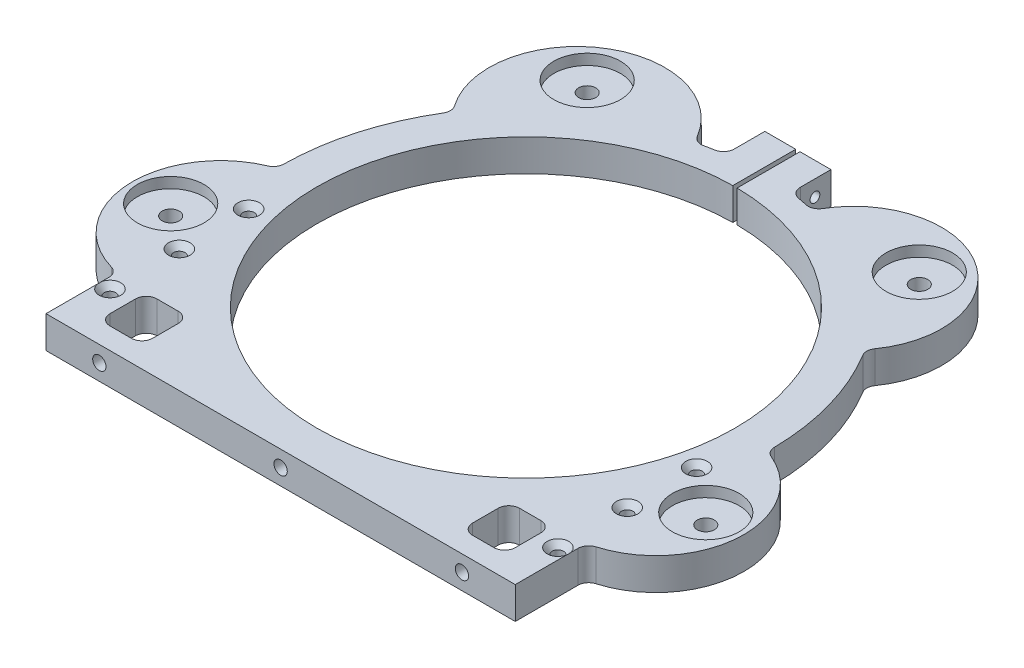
ISO-10303-21;
HEADER;
FILE_DESCRIPTION(('STEP AP214'),'2;1');
FILE_NAME('part.step','',(''),(''),'','','');
FILE_SCHEMA(('AUTOMOTIVE_DESIGN { 1 0 10303 214 1 1 1 1 }'));
ENDSEC;
DATA;
#1=APPLICATION_CONTEXT('core data for automotive mechanical design processes');
#2=APPLICATION_PROTOCOL_DEFINITION('international standard','automotive_design',2000,#1);
#3=PRODUCT_CONTEXT('',#1,'mechanical');
#4=PRODUCT('Part','Part','',(#3));
#5=PRODUCT_RELATED_PRODUCT_CATEGORY('part','',(#4));
#6=PRODUCT_DEFINITION_FORMATION('','',#4);
#7=PRODUCT_DEFINITION_CONTEXT('part definition',#1,'design');
#8=PRODUCT_DEFINITION('design','',#6,#7);
#9=PRODUCT_DEFINITION_SHAPE('','',#8);
#10=(LENGTH_UNIT() NAMED_UNIT(*) SI_UNIT(.MILLI.,.METRE.));
#11=(NAMED_UNIT(*) PLANE_ANGLE_UNIT() SI_UNIT($,.RADIAN.));
#12=(NAMED_UNIT(*) SI_UNIT($,.STERADIAN.) SOLID_ANGLE_UNIT());
#13=UNCERTAINTY_MEASURE_WITH_UNIT(LENGTH_MEASURE(1.E-05),#10,'distance_accuracy_value','');
#14=(GEOMETRIC_REPRESENTATION_CONTEXT(3) GLOBAL_UNCERTAINTY_ASSIGNED_CONTEXT((#13)) GLOBAL_UNIT_ASSIGNED_CONTEXT((#10,
#11,#12)) REPRESENTATION_CONTEXT('',''));
#15=CARTESIAN_POINT('',(0.,0.,0.));
#16=DIRECTION('',(0.,0.,1.));
#17=DIRECTION('',(1.,0.,0.));
#18=AXIS2_PLACEMENT_3D('',#15,#16,#17);
#19=CARTESIAN_POINT('',(-159.302197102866,19.05,52.210914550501));
#20=DIRECTION('',(0.,-1.,0.));
#21=DIRECTION('',(0.,0.,-1.));
#22=AXIS2_PLACEMENT_3D('',#19,#20,#21);
#23=CYLINDRICAL_SURFACE('',#22,5.07999999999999);
#24=CARTESIAN_POINT('',(-159.302197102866,12.7,52.210914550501));
#25=DIRECTION('',(0.,1.,0.));
#26=DIRECTION('',(-1.,0.,0.));
#27=AXIS2_PLACEMENT_3D('',#24,#25,#26);
#28=CIRCLE('',#27,5.07999999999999);
#29=CARTESIAN_POINT('',(-159.302197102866,12.7,47.130914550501));
#30=VERTEX_POINT('',#29);
#31=EDGE_CURVE('E898',#30,#30,#28,.T.);
#32=CARTESIAN_POINT('',(-159.302197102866,5.08,52.210914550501));
#33=DIRECTION('',(0.,-1.,0.));
#34=DIRECTION('',(0.,0.,-1.));
#35=AXIS2_PLACEMENT_3D('',#32,#33,#34);
#36=CIRCLE('',#35,5.07999999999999);
#37=CARTESIAN_POINT('',(-159.302197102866,5.08,47.130914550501));
#38=VERTEX_POINT('',#37);
#39=EDGE_CURVE('E34',#38,#38,#36,.T.);
#40=CARTESIAN_POINT('',(-159.302197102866,12.7,47.130914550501));
#41=CARTESIAN_POINT('',(-159.302197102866,12.620625,47.130914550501));
#42=CARTESIAN_POINT('',(-159.302197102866,12.54125,47.130914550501));
#43=CARTESIAN_POINT('',(-159.302197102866,12.3825,47.130914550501));
#44=CARTESIAN_POINT('',(-159.302197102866,12.303125,47.130914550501));
#45=CARTESIAN_POINT('',(-159.302197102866,12.144375,47.130914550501));
#46=CARTESIAN_POINT('',(-159.302197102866,12.065,47.130914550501));
#47=CARTESIAN_POINT('',(-159.302197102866,11.90625,47.130914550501));
#48=CARTESIAN_POINT('',(-159.302197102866,11.826875,47.130914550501));
#49=CARTESIAN_POINT('',(-159.302197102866,11.668125,47.130914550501));
#50=CARTESIAN_POINT('',(-159.302197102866,11.58875,47.130914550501));
#51=CARTESIAN_POINT('',(-159.302197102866,11.43,47.130914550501));
#52=CARTESIAN_POINT('',(-159.302197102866,11.350625,47.130914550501));
#53=CARTESIAN_POINT('',(-159.302197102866,11.191875,47.130914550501));
#54=CARTESIAN_POINT('',(-159.302197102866,11.1125,47.130914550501));
#55=CARTESIAN_POINT('',(-159.302197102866,10.95375,47.130914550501));
#56=CARTESIAN_POINT('',(-159.302197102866,10.874375,47.130914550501));
#57=CARTESIAN_POINT('',(-159.302197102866,10.715625,47.130914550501));
#58=CARTESIAN_POINT('',(-159.302197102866,10.63625,47.130914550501));
#59=CARTESIAN_POINT('',(-159.302197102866,10.4775,47.130914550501));
#60=CARTESIAN_POINT('',(-159.302197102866,10.398125,47.130914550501));
#61=CARTESIAN_POINT('',(-159.302197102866,10.239375,47.130914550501));
#62=CARTESIAN_POINT('',(-159.302197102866,10.16,47.130914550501));
#63=CARTESIAN_POINT('',(-159.302197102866,10.00125,47.130914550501));
#64=CARTESIAN_POINT('',(-159.302197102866,9.921875,47.130914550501));
#65=CARTESIAN_POINT('',(-159.302197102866,9.763125,47.130914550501));
#66=CARTESIAN_POINT('',(-159.302197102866,9.68375,47.130914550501));
#67=CARTESIAN_POINT('',(-159.302197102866,9.525,47.130914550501));
#68=CARTESIAN_POINT('',(-159.302197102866,9.44562500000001,47.130914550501));
#69=CARTESIAN_POINT('',(-159.302197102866,9.28687500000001,47.130914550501));
#70=CARTESIAN_POINT('',(-159.302197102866,9.2075,47.130914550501));
#71=CARTESIAN_POINT('',(-159.302197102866,9.04875000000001,47.130914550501));
#72=CARTESIAN_POINT('',(-159.302197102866,8.969375,47.130914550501));
#73=CARTESIAN_POINT('',(-159.302197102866,8.810625,47.130914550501));
#74=CARTESIAN_POINT('',(-159.302197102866,8.73125,47.130914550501));
#75=CARTESIAN_POINT('',(-159.302197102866,8.5725,47.130914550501));
#76=CARTESIAN_POINT('',(-159.302197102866,8.493125,47.130914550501));
#77=CARTESIAN_POINT('',(-159.302197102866,8.334375,47.130914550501));
#78=CARTESIAN_POINT('',(-159.302197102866,8.255,47.130914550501));
#79=CARTESIAN_POINT('',(-159.302197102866,8.09625,47.130914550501));
#80=CARTESIAN_POINT('',(-159.302197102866,8.016875,47.130914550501));
#81=CARTESIAN_POINT('',(-159.302197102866,7.858125,47.130914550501));
#82=CARTESIAN_POINT('',(-159.302197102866,7.77875,47.130914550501));
#83=CARTESIAN_POINT('',(-159.302197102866,7.62,47.130914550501));
#84=CARTESIAN_POINT('',(-159.302197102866,7.540625,47.130914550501));
#85=CARTESIAN_POINT('',(-159.302197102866,7.381875,47.130914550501));
#86=CARTESIAN_POINT('',(-159.302197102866,7.3025,47.130914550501));
#87=CARTESIAN_POINT('',(-159.302197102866,7.14375,47.130914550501));
#88=CARTESIAN_POINT('',(-159.302197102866,7.064375,47.130914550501));
#89=CARTESIAN_POINT('',(-159.302197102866,6.905625,47.130914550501));
#90=CARTESIAN_POINT('',(-159.302197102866,6.82625,47.130914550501));
#91=CARTESIAN_POINT('',(-159.302197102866,6.6675,47.130914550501));
#92=CARTESIAN_POINT('',(-159.302197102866,6.588125,47.130914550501));
#93=CARTESIAN_POINT('',(-159.302197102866,6.429375,47.130914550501));
#94=CARTESIAN_POINT('',(-159.302197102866,6.35,47.130914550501));
#95=CARTESIAN_POINT('',(-159.302197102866,6.19125,47.130914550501));
#96=CARTESIAN_POINT('',(-159.302197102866,6.111875,47.130914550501));
#97=CARTESIAN_POINT('',(-159.302197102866,5.953125,47.130914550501));
#98=CARTESIAN_POINT('',(-159.302197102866,5.87375,47.130914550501));
#99=CARTESIAN_POINT('',(-159.302197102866,5.715,47.130914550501));
#100=CARTESIAN_POINT('',(-159.302197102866,5.635625,47.130914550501));
#101=CARTESIAN_POINT('',(-159.302197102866,5.476875,47.130914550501));
#102=CARTESIAN_POINT('',(-159.302197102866,5.3975,47.130914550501));
#103=CARTESIAN_POINT('',(-159.302197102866,5.23875,47.130914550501));
#104=CARTESIAN_POINT('',(-159.302197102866,5.159375,47.130914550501));
#105=CARTESIAN_POINT('',(-159.302197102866,5.08,47.130914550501));
#106=B_SPLINE_CURVE_WITH_KNOTS('',3,(#40,#41,#42,#43,#44,#45,#46,#47,#48,#49,#50,#51,#52,#53,
#54,#55,#56,#57,#58,#59,#60,#61,#62,#63,#64,#65,#66,#67,#68,#69,#70,#71,#72,#73,#74,#75,#76,#77,
#78,#79,#80,#81,#82,#83,#84,#85,#86,#87,#88,#89,#90,#91,#92,#93,#94,#95,#96,#97,#98,#99,#100,
#101,#102,#103,#104,#105),.UNSPECIFIED.,.F.,.F.,(4,2,2,2,2,2,2,2,2,2,2,2,2,2,2,2,2,2,2,2,2,2,2,
2,2,2,2,2,2,2,2,2,4),(0.,0.238124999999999,0.476249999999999,0.714375,0.952499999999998,
1.190625,1.42875,1.666875,1.905,2.143125,2.38125,2.619375,2.8575,3.095625,3.33375,3.571875,3.81,
4.048125,4.28625,4.524375,4.7625,5.000625,5.23875,5.476875,5.715,5.953125,6.19125,6.429375,
6.6675,6.905625,7.14375,7.381875,7.62),.UNSPECIFIED.);
#107=EDGE_CURVE('BSEAM30',#30,#38,#106,.T.);
#108=ORIENTED_EDGE('',*,*,#31,.T.);
#109=ORIENTED_EDGE('',*,*,#39,.T.);
#110=ORIENTED_EDGE('',*,*,#107,.T.);
#111=ORIENTED_EDGE('',*,*,#107,.F.);
#112=EDGE_LOOP('',(#108,#110,#109,#111));
#113=FACE_BOUND('',#112,.T.);
#114=ADVANCED_FACE('F30',(#113),#23,.F.);
#115=CARTESIAN_POINT('',(-98.8658581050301,19.0499999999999,-135.335449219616));
#116=DIRECTION('',(0.,-1.,0.));
#117=DIRECTION('',(0.,0.,-1.));
#118=AXIS2_PLACEMENT_3D('',#115,#116,#117);
#119=CYLINDRICAL_SURFACE('',#118,5.08);
#120=CARTESIAN_POINT('',(-98.8658581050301,12.6999999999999,-135.335449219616));
#121=DIRECTION('',(0.,1.,0.));
#122=DIRECTION('',(-1.,0.,0.));
#123=AXIS2_PLACEMENT_3D('',#120,#121,#122);
#124=CIRCLE('',#123,5.08);
#125=CARTESIAN_POINT('',(-98.8658581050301,12.6999999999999,-140.415449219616));
#126=VERTEX_POINT('',#125);
#127=EDGE_CURVE('E905',#126,#126,#124,.T.);
#128=CARTESIAN_POINT('',(-98.8658581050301,5.07999999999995,-135.335449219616));
#129=DIRECTION('',(0.,-1.,0.));
#130=DIRECTION('',(0.,0.,-1.));
#131=AXIS2_PLACEMENT_3D('',#128,#129,#130);
#132=CIRCLE('',#131,5.08);
#133=CARTESIAN_POINT('',(-98.8658581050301,5.07999999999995,-140.415449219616));
#134=VERTEX_POINT('',#133);
#135=EDGE_CURVE('E861',#134,#134,#132,.T.);
#136=CARTESIAN_POINT('',(-98.8658581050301,12.6999999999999,-140.415449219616));
#137=CARTESIAN_POINT('',(-98.8658581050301,12.6206249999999,-140.415449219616));
#138=CARTESIAN_POINT('',(-98.8658581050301,12.5412499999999,-140.415449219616));
#139=CARTESIAN_POINT('',(-98.8658581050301,12.3824999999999,-140.415449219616));
#140=CARTESIAN_POINT('',(-98.8658581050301,12.3031249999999,-140.415449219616));
#141=CARTESIAN_POINT('',(-98.8658581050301,12.1443749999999,-140.415449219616));
#142=CARTESIAN_POINT('',(-98.8658581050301,12.0649999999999,-140.415449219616));
#143=CARTESIAN_POINT('',(-98.8658581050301,11.9062499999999,-140.415449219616));
#144=CARTESIAN_POINT('',(-98.8658581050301,11.8268749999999,-140.415449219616));
#145=CARTESIAN_POINT('',(-98.8658581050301,11.6681249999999,-140.415449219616));
#146=CARTESIAN_POINT('',(-98.8658581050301,11.5887499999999,-140.415449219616));
#147=CARTESIAN_POINT('',(-98.8658581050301,11.4299999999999,-140.415449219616));
#148=CARTESIAN_POINT('',(-98.8658581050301,11.3506249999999,-140.415449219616));
#149=CARTESIAN_POINT('',(-98.8658581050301,11.1918749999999,-140.415449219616));
#150=CARTESIAN_POINT('',(-98.8658581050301,11.1124999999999,-140.415449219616));
#151=CARTESIAN_POINT('',(-98.8658581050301,10.9537499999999,-140.415449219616));
#152=CARTESIAN_POINT('',(-98.8658581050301,10.8743749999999,-140.415449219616));
#153=CARTESIAN_POINT('',(-98.8658581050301,10.7156249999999,-140.415449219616));
#154=CARTESIAN_POINT('',(-98.8658581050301,10.6362499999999,-140.415449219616));
#155=CARTESIAN_POINT('',(-98.8658581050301,10.4774999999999,-140.415449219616));
#156=CARTESIAN_POINT('',(-98.8658581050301,10.3981249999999,-140.415449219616));
#157=CARTESIAN_POINT('',(-98.8658581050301,10.2393749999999,-140.415449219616));
#158=CARTESIAN_POINT('',(-98.8658581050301,10.1599999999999,-140.415449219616));
#159=CARTESIAN_POINT('',(-98.8658581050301,10.0012499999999,-140.415449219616));
#160=CARTESIAN_POINT('',(-98.8658581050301,9.92187499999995,-140.415449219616));
#161=CARTESIAN_POINT('',(-98.8658581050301,9.76312499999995,-140.415449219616));
#162=CARTESIAN_POINT('',(-98.8658581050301,9.68374999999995,-140.415449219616));
#163=CARTESIAN_POINT('',(-98.8658581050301,9.52499999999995,-140.415449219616));
#164=CARTESIAN_POINT('',(-98.8658581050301,9.44562499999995,-140.415449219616));
#165=CARTESIAN_POINT('',(-98.8658581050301,9.28687499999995,-140.415449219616));
#166=CARTESIAN_POINT('',(-98.8658581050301,9.20749999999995,-140.415449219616));
#167=CARTESIAN_POINT('',(-98.8658581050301,9.04874999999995,-140.415449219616));
#168=CARTESIAN_POINT('',(-98.8658581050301,8.96937499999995,-140.415449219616));
#169=CARTESIAN_POINT('',(-98.8658581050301,8.81062499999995,-140.415449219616));
#170=CARTESIAN_POINT('',(-98.8658581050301,8.73124999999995,-140.415449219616));
#171=CARTESIAN_POINT('',(-98.8658581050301,8.57249999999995,-140.415449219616));
#172=CARTESIAN_POINT('',(-98.8658581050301,8.49312499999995,-140.415449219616));
#173=CARTESIAN_POINT('',(-98.8658581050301,8.33437499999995,-140.415449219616));
#174=CARTESIAN_POINT('',(-98.8658581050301,8.25499999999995,-140.415449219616));
#175=CARTESIAN_POINT('',(-98.8658581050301,8.09624999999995,-140.415449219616));
#176=CARTESIAN_POINT('',(-98.8658581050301,8.01687499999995,-140.415449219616));
#177=CARTESIAN_POINT('',(-98.8658581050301,7.85812499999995,-140.415449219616));
#178=CARTESIAN_POINT('',(-98.8658581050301,7.77874999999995,-140.415449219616));
#179=CARTESIAN_POINT('',(-98.8658581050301,7.61999999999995,-140.415449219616));
#180=CARTESIAN_POINT('',(-98.8658581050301,7.54062499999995,-140.415449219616));
#181=CARTESIAN_POINT('',(-98.8658581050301,7.38187499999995,-140.415449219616));
#182=CARTESIAN_POINT('',(-98.8658581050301,7.30249999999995,-140.415449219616));
#183=CARTESIAN_POINT('',(-98.8658581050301,7.14374999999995,-140.415449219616));
#184=CARTESIAN_POINT('',(-98.8658581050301,7.06437499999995,-140.415449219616));
#185=CARTESIAN_POINT('',(-98.8658581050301,6.90562499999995,-140.415449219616));
#186=CARTESIAN_POINT('',(-98.8658581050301,6.82624999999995,-140.415449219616));
#187=CARTESIAN_POINT('',(-98.8658581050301,6.66749999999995,-140.415449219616));
#188=CARTESIAN_POINT('',(-98.8658581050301,6.58812499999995,-140.415449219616));
#189=CARTESIAN_POINT('',(-98.8658581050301,6.42937499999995,-140.415449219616));
#190=CARTESIAN_POINT('',(-98.8658581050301,6.34999999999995,-140.415449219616));
#191=CARTESIAN_POINT('',(-98.8658581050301,6.19124999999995,-140.415449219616));
#192=CARTESIAN_POINT('',(-98.8658581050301,6.11187499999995,-140.415449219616));
#193=CARTESIAN_POINT('',(-98.8658581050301,5.95312499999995,-140.415449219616));
#194=CARTESIAN_POINT('',(-98.8658581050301,5.87374999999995,-140.415449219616));
#195=CARTESIAN_POINT('',(-98.8658581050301,5.71499999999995,-140.415449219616));
#196=CARTESIAN_POINT('',(-98.8658581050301,5.63562499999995,-140.415449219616));
#197=CARTESIAN_POINT('',(-98.8658581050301,5.47687499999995,-140.415449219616));
#198=CARTESIAN_POINT('',(-98.8658581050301,5.39749999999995,-140.415449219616));
#199=CARTESIAN_POINT('',(-98.8658581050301,5.23874999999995,-140.415449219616));
#200=CARTESIAN_POINT('',(-98.8658581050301,5.15937499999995,-140.415449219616));
#201=CARTESIAN_POINT('',(-98.8658581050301,5.07999999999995,-140.415449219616));
#202=B_SPLINE_CURVE_WITH_KNOTS('',3,(#136,#137,#138,#139,#140,#141,#142,#143,#144,#145,#146,
#147,#148,#149,#150,#151,#152,#153,#154,#155,#156,#157,#158,#159,#160,#161,#162,#163,#164,#165,
#166,#167,#168,#169,#170,#171,#172,#173,#174,#175,#176,#177,#178,#179,#180,#181,#182,#183,#184,
#185,#186,#187,#188,#189,#190,#191,#192,#193,#194,#195,#196,#197,#198,#199,#200,#201),
.UNSPECIFIED.,.F.,.F.,(4,2,2,2,2,2,2,2,2,2,2,2,2,2,2,2,2,2,2,2,2,2,2,2,2,2,2,2,2,2,2,2,4),(0.,
0.238124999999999,0.476249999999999,0.714375,0.952499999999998,1.190625,1.42875,1.666875,1.905,
2.143125,2.38125,2.619375,2.8575,3.095625,3.33375,3.571875,3.81,4.048125,4.28625,4.524375,
4.7625,5.000625,5.23875,5.476875,5.715,5.953125,6.19125,6.429375,6.6675,6.905625,7.14375,
7.381875,7.62),.UNSPECIFIED.);
#203=EDGE_CURVE('BSEAM785',#126,#134,#202,.T.);
#204=ORIENTED_EDGE('',*,*,#127,.T.);
#205=ORIENTED_EDGE('',*,*,#135,.T.);
#206=ORIENTED_EDGE('',*,*,#203,.T.);
#207=ORIENTED_EDGE('',*,*,#203,.F.);
#208=EDGE_LOOP('',(#204,#206,#205,#207));
#209=FACE_BOUND('',#208,.T.);
#210=ADVANCED_FACE('F785',(#209),#119,.F.);
#211=CARTESIAN_POINT('',(98.86585810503,19.05,-135.335449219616));
#212=DIRECTION('',(0.,-1.,0.));
#213=DIRECTION('',(0.,0.,-1.));
#214=AXIS2_PLACEMENT_3D('',#211,#212,#213);
#215=CYLINDRICAL_SURFACE('',#214,5.08);
#216=CARTESIAN_POINT('',(98.86585810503,12.7,-135.335449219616));
#217=DIRECTION('',(0.,1.,0.));
#218=DIRECTION('',(-1.,0.,0.));
#219=AXIS2_PLACEMENT_3D('',#216,#217,#218);
#220=CIRCLE('',#219,5.08);
#221=CARTESIAN_POINT('',(98.86585810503,12.7,-140.415449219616));
#222=VERTEX_POINT('',#221);
#223=EDGE_CURVE('E844',#222,#222,#220,.T.);
#224=CARTESIAN_POINT('',(98.86585810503,5.07999999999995,-135.335449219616));
#225=DIRECTION('',(0.,-1.,0.));
#226=DIRECTION('',(0.,0.,-1.));
#227=AXIS2_PLACEMENT_3D('',#224,#225,#226);
#228=CIRCLE('',#227,5.08);
#229=CARTESIAN_POINT('',(98.86585810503,5.07999999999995,-140.415449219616));
#230=VERTEX_POINT('',#229);
#231=EDGE_CURVE('E847',#230,#230,#228,.T.);
#232=CARTESIAN_POINT('',(98.86585810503,12.7,-140.415449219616));
#233=CARTESIAN_POINT('',(98.86585810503,12.620625,-140.415449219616));
#234=CARTESIAN_POINT('',(98.86585810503,12.54125,-140.415449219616));
#235=CARTESIAN_POINT('',(98.86585810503,12.3825,-140.415449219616));
#236=CARTESIAN_POINT('',(98.86585810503,12.303125,-140.415449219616));
#237=CARTESIAN_POINT('',(98.86585810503,12.144375,-140.415449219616));
#238=CARTESIAN_POINT('',(98.86585810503,12.065,-140.415449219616));
#239=CARTESIAN_POINT('',(98.86585810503,11.90625,-140.415449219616));
#240=CARTESIAN_POINT('',(98.86585810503,11.826875,-140.415449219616));
#241=CARTESIAN_POINT('',(98.86585810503,11.668125,-140.415449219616));
#242=CARTESIAN_POINT('',(98.86585810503,11.58875,-140.415449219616));
#243=CARTESIAN_POINT('',(98.86585810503,11.43,-140.415449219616));
#244=CARTESIAN_POINT('',(98.86585810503,11.350625,-140.415449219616));
#245=CARTESIAN_POINT('',(98.86585810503,11.191875,-140.415449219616));
#246=CARTESIAN_POINT('',(98.86585810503,11.1125,-140.415449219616));
#247=CARTESIAN_POINT('',(98.86585810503,10.95375,-140.415449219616));
#248=CARTESIAN_POINT('',(98.86585810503,10.874375,-140.415449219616));
#249=CARTESIAN_POINT('',(98.86585810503,10.715625,-140.415449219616));
#250=CARTESIAN_POINT('',(98.86585810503,10.63625,-140.415449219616));
#251=CARTESIAN_POINT('',(98.86585810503,10.4775,-140.415449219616));
#252=CARTESIAN_POINT('',(98.86585810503,10.398125,-140.415449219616));
#253=CARTESIAN_POINT('',(98.86585810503,10.239375,-140.415449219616));
#254=CARTESIAN_POINT('',(98.86585810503,10.16,-140.415449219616));
#255=CARTESIAN_POINT('',(98.86585810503,10.00125,-140.415449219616));
#256=CARTESIAN_POINT('',(98.86585810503,9.92187499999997,-140.415449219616));
#257=CARTESIAN_POINT('',(98.86585810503,9.76312499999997,-140.415449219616));
#258=CARTESIAN_POINT('',(98.86585810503,9.68374999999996,-140.415449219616));
#259=CARTESIAN_POINT('',(98.86585810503,9.52499999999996,-140.415449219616));
#260=CARTESIAN_POINT('',(98.86585810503,9.44562499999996,-140.415449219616));
#261=CARTESIAN_POINT('',(98.86585810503,9.28687499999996,-140.415449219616));
#262=CARTESIAN_POINT('',(98.86585810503,9.20749999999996,-140.415449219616));
#263=CARTESIAN_POINT('',(98.86585810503,9.04874999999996,-140.415449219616));
#264=CARTESIAN_POINT('',(98.86585810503,8.96937499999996,-140.415449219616));
#265=CARTESIAN_POINT('',(98.86585810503,8.81062499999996,-140.415449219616));
#266=CARTESIAN_POINT('',(98.86585810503,8.73124999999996,-140.415449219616));
#267=CARTESIAN_POINT('',(98.86585810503,8.57249999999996,-140.415449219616));
#268=CARTESIAN_POINT('',(98.86585810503,8.49312499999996,-140.415449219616));
#269=CARTESIAN_POINT('',(98.86585810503,8.33437499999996,-140.415449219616));
#270=CARTESIAN_POINT('',(98.86585810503,8.25499999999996,-140.415449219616));
#271=CARTESIAN_POINT('',(98.86585810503,8.09624999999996,-140.415449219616));
#272=CARTESIAN_POINT('',(98.86585810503,8.01687499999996,-140.415449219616));
#273=CARTESIAN_POINT('',(98.86585810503,7.85812499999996,-140.415449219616));
#274=CARTESIAN_POINT('',(98.86585810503,7.77874999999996,-140.415449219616));
#275=CARTESIAN_POINT('',(98.86585810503,7.61999999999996,-140.415449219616));
#276=CARTESIAN_POINT('',(98.86585810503,7.54062499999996,-140.415449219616));
#277=CARTESIAN_POINT('',(98.86585810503,7.38187499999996,-140.415449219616));
#278=CARTESIAN_POINT('',(98.86585810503,7.30249999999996,-140.415449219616));
#279=CARTESIAN_POINT('',(98.86585810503,7.14374999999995,-140.415449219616));
#280=CARTESIAN_POINT('',(98.86585810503,7.06437499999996,-140.415449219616));
#281=CARTESIAN_POINT('',(98.86585810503,6.90562499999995,-140.415449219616));
#282=CARTESIAN_POINT('',(98.86585810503,6.82624999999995,-140.415449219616));
#283=CARTESIAN_POINT('',(98.86585810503,6.66749999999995,-140.415449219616));
#284=CARTESIAN_POINT('',(98.86585810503,6.58812499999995,-140.415449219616));
#285=CARTESIAN_POINT('',(98.86585810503,6.42937499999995,-140.415449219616));
#286=CARTESIAN_POINT('',(98.86585810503,6.34999999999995,-140.415449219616));
#287=CARTESIAN_POINT('',(98.86585810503,6.19124999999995,-140.415449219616));
#288=CARTESIAN_POINT('',(98.86585810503,6.11187499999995,-140.415449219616));
#289=CARTESIAN_POINT('',(98.86585810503,5.95312499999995,-140.415449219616));
#290=CARTESIAN_POINT('',(98.86585810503,5.87374999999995,-140.415449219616));
#291=CARTESIAN_POINT('',(98.86585810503,5.71499999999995,-140.415449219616));
#292=CARTESIAN_POINT('',(98.86585810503,5.63562499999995,-140.415449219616));
#293=CARTESIAN_POINT('',(98.86585810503,5.47687499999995,-140.415449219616));
#294=CARTESIAN_POINT('',(98.86585810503,5.39749999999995,-140.415449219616));
#295=CARTESIAN_POINT('',(98.86585810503,5.23874999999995,-140.415449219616));
#296=CARTESIAN_POINT('',(98.86585810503,5.15937499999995,-140.415449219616));
#297=CARTESIAN_POINT('',(98.86585810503,5.07999999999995,-140.415449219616));
#298=B_SPLINE_CURVE_WITH_KNOTS('',3,(#232,#233,#234,#235,#236,#237,#238,#239,#240,#241,#242,
#243,#244,#245,#246,#247,#248,#249,#250,#251,#252,#253,#254,#255,#256,#257,#258,#259,#260,#261,
#262,#263,#264,#265,#266,#267,#268,#269,#270,#271,#272,#273,#274,#275,#276,#277,#278,#279,#280,
#281,#282,#283,#284,#285,#286,#287,#288,#289,#290,#291,#292,#293,#294,#295,#296,#297),
.UNSPECIFIED.,.F.,.F.,(4,2,2,2,2,2,2,2,2,2,2,2,2,2,2,2,2,2,2,2,2,2,2,2,2,2,2,2,2,2,2,2,4),(0.,
0.238124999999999,0.476250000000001,0.714375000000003,0.952500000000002,1.190625,1.42875,
1.66687500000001,1.90500000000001,2.14312500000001,2.38125000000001,2.61937500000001,
2.85750000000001,3.09562500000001,3.33375000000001,3.57187500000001,3.81000000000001,
4.04812500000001,4.28625000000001,4.52437500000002,4.76250000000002,5.00062500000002,
5.23875000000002,5.47687500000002,5.71500000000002,5.95312500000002,6.19125000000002,
6.42937500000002,6.66750000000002,6.90562500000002,7.14375000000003,7.38187500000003,
7.62000000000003),.UNSPECIFIED.);
#299=EDGE_CURVE('BSEAM828',#222,#230,#298,.T.);
#300=ORIENTED_EDGE('',*,*,#223,.T.);
#301=ORIENTED_EDGE('',*,*,#231,.T.);
#302=ORIENTED_EDGE('',*,*,#299,.T.);
#303=ORIENTED_EDGE('',*,*,#299,.F.);
#304=EDGE_LOOP('',(#300,#302,#301,#303));
#305=FACE_BOUND('',#304,.T.);
#306=ADVANCED_FACE('F828',(#305),#215,.F.);
#307=CARTESIAN_POINT('',(159.302197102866,19.0499999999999,52.2109145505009));
#308=DIRECTION('',(0.,-1.,0.));
#309=DIRECTION('',(0.,0.,-1.));
#310=AXIS2_PLACEMENT_3D('',#307,#308,#309);
#311=CYLINDRICAL_SURFACE('',#310,5.07999999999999);
#312=CARTESIAN_POINT('',(159.302197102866,12.6999999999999,52.2109145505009));
#313=DIRECTION('',(0.,1.,0.));
#314=DIRECTION('',(-1.,0.,0.));
#315=AXIS2_PLACEMENT_3D('',#312,#313,#314);
#316=CIRCLE('',#315,5.07999999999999);
#317=CARTESIAN_POINT('',(159.302197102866,12.6999999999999,47.1309145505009));
#318=VERTEX_POINT('',#317);
#319=EDGE_CURVE('E885',#318,#318,#316,.T.);
#320=CARTESIAN_POINT('',(159.302197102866,5.07999999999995,52.2109145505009));
#321=DIRECTION('',(0.,-1.,0.));
#322=DIRECTION('',(0.,0.,-1.));
#323=AXIS2_PLACEMENT_3D('',#320,#321,#322);
#324=CIRCLE('',#323,5.07999999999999);
#325=CARTESIAN_POINT('',(159.302197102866,5.07999999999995,47.1309145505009));
#326=VERTEX_POINT('',#325);
#327=EDGE_CURVE('E859',#326,#326,#324,.T.);
#328=CARTESIAN_POINT('',(159.302197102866,12.6999999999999,47.1309145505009));
#329=CARTESIAN_POINT('',(159.302197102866,12.6206249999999,47.1309145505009));
#330=CARTESIAN_POINT('',(159.302197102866,12.5412499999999,47.1309145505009));
#331=CARTESIAN_POINT('',(159.302197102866,12.3824999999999,47.1309145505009));
#332=CARTESIAN_POINT('',(159.302197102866,12.3031249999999,47.1309145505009));
#333=CARTESIAN_POINT('',(159.302197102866,12.1443749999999,47.1309145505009));
#334=CARTESIAN_POINT('',(159.302197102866,12.0649999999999,47.1309145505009));
#335=CARTESIAN_POINT('',(159.302197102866,11.9062499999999,47.1309145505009));
#336=CARTESIAN_POINT('',(159.302197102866,11.8268749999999,47.1309145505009));
#337=CARTESIAN_POINT('',(159.302197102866,11.6681249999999,47.1309145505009));
#338=CARTESIAN_POINT('',(159.302197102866,11.5887499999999,47.1309145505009));
#339=CARTESIAN_POINT('',(159.302197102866,11.4299999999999,47.1309145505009));
#340=CARTESIAN_POINT('',(159.302197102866,11.3506249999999,47.1309145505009));
#341=CARTESIAN_POINT('',(159.302197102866,11.1918749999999,47.1309145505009));
#342=CARTESIAN_POINT('',(159.302197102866,11.1124999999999,47.1309145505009));
#343=CARTESIAN_POINT('',(159.302197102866,10.9537499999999,47.1309145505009));
#344=CARTESIAN_POINT('',(159.302197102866,10.8743749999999,47.1309145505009));
#345=CARTESIAN_POINT('',(159.302197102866,10.7156249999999,47.1309145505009));
#346=CARTESIAN_POINT('',(159.302197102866,10.6362499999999,47.1309145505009));
#347=CARTESIAN_POINT('',(159.302197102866,10.4774999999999,47.1309145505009));
#348=CARTESIAN_POINT('',(159.302197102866,10.3981249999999,47.1309145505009));
#349=CARTESIAN_POINT('',(159.302197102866,10.2393749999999,47.1309145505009));
#350=CARTESIAN_POINT('',(159.302197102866,10.1599999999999,47.1309145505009));
#351=CARTESIAN_POINT('',(159.302197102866,10.0012499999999,47.1309145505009));
#352=CARTESIAN_POINT('',(159.302197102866,9.92187499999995,47.1309145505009));
#353=CARTESIAN_POINT('',(159.302197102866,9.76312499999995,47.1309145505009));
#354=CARTESIAN_POINT('',(159.302197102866,9.68374999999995,47.1309145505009));
#355=CARTESIAN_POINT('',(159.302197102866,9.52499999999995,47.1309145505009));
#356=CARTESIAN_POINT('',(159.302197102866,9.44562499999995,47.1309145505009));
#357=CARTESIAN_POINT('',(159.302197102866,9.28687499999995,47.1309145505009));
#358=CARTESIAN_POINT('',(159.302197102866,9.20749999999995,47.1309145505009));
#359=CARTESIAN_POINT('',(159.302197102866,9.04874999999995,47.1309145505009));
#360=CARTESIAN_POINT('',(159.302197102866,8.96937499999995,47.1309145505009));
#361=CARTESIAN_POINT('',(159.302197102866,8.81062499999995,47.1309145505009));
#362=CARTESIAN_POINT('',(159.302197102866,8.73124999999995,47.1309145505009));
#363=CARTESIAN_POINT('',(159.302197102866,8.57249999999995,47.1309145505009));
#364=CARTESIAN_POINT('',(159.302197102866,8.49312499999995,47.1309145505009));
#365=CARTESIAN_POINT('',(159.302197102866,8.33437499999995,47.1309145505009));
#366=CARTESIAN_POINT('',(159.302197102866,8.25499999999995,47.1309145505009));
#367=CARTESIAN_POINT('',(159.302197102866,8.09624999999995,47.1309145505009));
#368=CARTESIAN_POINT('',(159.302197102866,8.01687499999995,47.1309145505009));
#369=CARTESIAN_POINT('',(159.302197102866,7.85812499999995,47.1309145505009));
#370=CARTESIAN_POINT('',(159.302197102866,7.77874999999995,47.1309145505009));
#371=CARTESIAN_POINT('',(159.302197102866,7.61999999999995,47.1309145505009));
#372=CARTESIAN_POINT('',(159.302197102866,7.54062499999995,47.1309145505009));
#373=CARTESIAN_POINT('',(159.302197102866,7.38187499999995,47.1309145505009));
#374=CARTESIAN_POINT('',(159.302197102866,7.30249999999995,47.1309145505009));
#375=CARTESIAN_POINT('',(159.302197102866,7.14374999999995,47.1309145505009));
#376=CARTESIAN_POINT('',(159.302197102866,7.06437499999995,47.1309145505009));
#377=CARTESIAN_POINT('',(159.302197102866,6.90562499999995,47.1309145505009));
#378=CARTESIAN_POINT('',(159.302197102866,6.82624999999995,47.1309145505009));
#379=CARTESIAN_POINT('',(159.302197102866,6.66749999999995,47.1309145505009));
#380=CARTESIAN_POINT('',(159.302197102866,6.58812499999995,47.1309145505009));
#381=CARTESIAN_POINT('',(159.302197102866,6.42937499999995,47.1309145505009));
#382=CARTESIAN_POINT('',(159.302197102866,6.34999999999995,47.1309145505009));
#383=CARTESIAN_POINT('',(159.302197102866,6.19124999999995,47.1309145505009));
#384=CARTESIAN_POINT('',(159.302197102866,6.11187499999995,47.1309145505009));
#385=CARTESIAN_POINT('',(159.302197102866,5.95312499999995,47.1309145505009));
#386=CARTESIAN_POINT('',(159.302197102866,5.87374999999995,47.1309145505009));
#387=CARTESIAN_POINT('',(159.302197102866,5.71499999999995,47.1309145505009));
#388=CARTESIAN_POINT('',(159.302197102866,5.63562499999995,47.1309145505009));
#389=CARTESIAN_POINT('',(159.302197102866,5.47687499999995,47.1309145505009));
#390=CARTESIAN_POINT('',(159.302197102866,5.39749999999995,47.1309145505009));
#391=CARTESIAN_POINT('',(159.302197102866,5.23874999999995,47.1309145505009));
#392=CARTESIAN_POINT('',(159.302197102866,5.15937499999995,47.1309145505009));
#393=CARTESIAN_POINT('',(159.302197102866,5.07999999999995,47.1309145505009));
#394=B_SPLINE_CURVE_WITH_KNOTS('',3,(#328,#329,#330,#331,#332,#333,#334,#335,#336,#337,#338,
#339,#340,#341,#342,#343,#344,#345,#346,#347,#348,#349,#350,#351,#352,#353,#354,#355,#356,#357,
#358,#359,#360,#361,#362,#363,#364,#365,#366,#367,#368,#369,#370,#371,#372,#373,#374,#375,#376,
#377,#378,#379,#380,#381,#382,#383,#384,#385,#386,#387,#388,#389,#390,#391,#392,#393),
.UNSPECIFIED.,.F.,.F.,(4,2,2,2,2,2,2,2,2,2,2,2,2,2,2,2,2,2,2,2,2,2,2,2,2,2,2,2,2,2,2,2,4),(0.,
0.238124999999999,0.476249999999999,0.714375,0.952499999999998,1.190625,1.42875,1.666875,1.905,
2.143125,2.38125,2.619375,2.8575,3.095625,3.33375,3.571875,3.81,4.048125,4.28625,4.524375,
4.7625,5.000625,5.23875,5.476875,5.715,5.953125,6.19125,6.429375,6.6675,6.905625,7.14375,
7.381875,7.62),.UNSPECIFIED.);
#395=EDGE_CURVE('BSEAM833',#318,#326,#394,.T.);
#396=ORIENTED_EDGE('',*,*,#319,.T.);
#397=ORIENTED_EDGE('',*,*,#327,.T.);
#398=ORIENTED_EDGE('',*,*,#395,.T.);
#399=ORIENTED_EDGE('',*,*,#395,.F.);
#400=EDGE_LOOP('',(#396,#398,#397,#399));
#401=FACE_BOUND('',#400,.T.);
#402=ADVANCED_FACE('F833',(#401),#311,.F.);
#403=CARTESIAN_POINT('',(0.,19.05,0.));
#404=DIRECTION('',(0.,-1.,0.));
#405=DIRECTION('',(0.,0.,-1.));
#406=AXIS2_PLACEMENT_3D('',#403,#404,#405);
#407=CYLINDRICAL_SURFACE('',#406,139.7);
#408=CARTESIAN_POINT('',(0.,0.,0.));
#409=DIRECTION('',(0.,1.,0.));
#410=DIRECTION('',(0.,0.,-1.));
#411=AXIS2_PLACEMENT_3D('',#408,#409,#410);
#412=CIRCLE('',#411,139.7);
#413=CARTESIAN_POINT('',(30.4420304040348,0.,-136.342850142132));
#414=VERTEX_POINT('',#413);
#415=CARTESIAN_POINT('',(24.903043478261,0.,-137.462461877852));
#416=VERTEX_POINT('',#415);
#417=EDGE_CURVE('E588',#414,#416,#412,.T.);
#418=ORIENTED_EDGE('',*,*,#417,.T.);
#419=DIRECTION('',(0.,-1.,0.));
#420=VECTOR('',#419,1.);
#421=CARTESIAN_POINT('',(24.903043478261,19.0499999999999,-137.462461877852));
#422=LINE('',#421,#420);
#423=CARTESIAN_POINT('',(24.903043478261,19.0499999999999,-137.462461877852));
#424=VERTEX_POINT('',#423);
#425=EDGE_CURVE('E1171',#416,#424,#422,.F.);
#426=ORIENTED_EDGE('',*,*,#425,.T.);
#427=CARTESIAN_POINT('',(0.,19.05,0.));
#428=DIRECTION('',(0.,1.,0.));
#429=DIRECTION('',(0.,0.,-1.));
#430=AXIS2_PLACEMENT_3D('',#427,#428,#429);
#431=CIRCLE('',#430,139.7);
#432=CARTESIAN_POINT('',(30.4420304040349,19.05,-136.342850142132));
#433=VERTEX_POINT('',#432);
#434=EDGE_CURVE('E619',#433,#424,#431,.T.);
#435=ORIENTED_EDGE('',*,*,#434,.F.);
#436=DIRECTION('',(0.,-1.,0.));
#437=VECTOR('',#436,1.);
#438=CARTESIAN_POINT('',(30.4420304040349,19.05,-136.342850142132));
#439=LINE('',#438,#437);
#440=EDGE_CURVE('E649',#433,#414,#439,.T.);
#441=ORIENTED_EDGE('',*,*,#440,.T.);
#442=EDGE_LOOP('',(#418,#426,#435,#441));
#443=FACE_BOUND('',#442,.T.);
#444=ADVANCED_FACE('F707',(#443),#407,.T.);
#445=CARTESIAN_POINT('',(-146.05,19.05,108.651976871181));
#446=DIRECTION('',(0.,-1.,0.));
#447=DIRECTION('',(0.,0.,-1.));
#448=AXIS2_PLACEMENT_3D('',#445,#446,#447);
#449=PLANE('',#448);
#450=CARTESIAN_POINT('',(159.302197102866,19.0499999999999,52.2109145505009));
#451=DIRECTION('',(0.,1.,0.));
#452=DIRECTION('',(-1.,0.,0.));
#453=AXIS2_PLACEMENT_3D('',#450,#451,#452);
#454=CIRCLE('',#453,19.84375);
#455=CARTESIAN_POINT('',(139.458447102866,19.0499999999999,52.2109145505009));
#456=VERTEX_POINT('',#455);
#457=EDGE_CURVE('E879',#456,#456,#454,.T.);
#458=ORIENTED_EDGE('',*,*,#457,.F.);
#459=EDGE_LOOP('',(#458));
#460=FACE_BOUND('',#459,.T.);
#461=CARTESIAN_POINT('',(98.86585810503,19.05,-135.335449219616));
#462=DIRECTION('',(0.,1.,0.));
#463=DIRECTION('',(-1.,0.,0.));
#464=AXIS2_PLACEMENT_3D('',#461,#462,#463);
#465=CIRCLE('',#464,19.84375);
#466=CARTESIAN_POINT('',(79.02210810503,19.05,-135.335449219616));
#467=VERTEX_POINT('',#466);
#468=EDGE_CURVE('E886',#467,#467,#465,.T.);
#469=ORIENTED_EDGE('',*,*,#468,.F.);
#470=EDGE_LOOP('',(#469));
#471=FACE_BOUND('',#470,.T.);
#472=CARTESIAN_POINT('',(-159.302197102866,19.05,52.210914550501));
#473=DIRECTION('',(0.,1.,0.));
#474=DIRECTION('',(-1.,0.,0.));
#475=AXIS2_PLACEMENT_3D('',#472,#473,#474);
#476=CIRCLE('',#475,19.84375);
#477=CARTESIAN_POINT('',(-179.145947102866,19.05,52.210914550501));
#478=VERTEX_POINT('',#477);
#479=EDGE_CURVE('E892',#478,#478,#476,.T.);
#480=ORIENTED_EDGE('',*,*,#479,.F.);
#481=EDGE_LOOP('',(#480));
#482=FACE_BOUND('',#481,.T.);
#483=CARTESIAN_POINT('',(-98.8658581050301,19.0499999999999,-135.335449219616));
#484=DIRECTION('',(0.,1.,0.));
#485=DIRECTION('',(-1.,0.,0.));
#486=AXIS2_PLACEMENT_3D('',#483,#484,#485);
#487=CIRCLE('',#486,19.84375);
#488=CARTESIAN_POINT('',(-118.70960810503,19.0499999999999,-135.335449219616));
#489=VERTEX_POINT('',#488);
#490=EDGE_CURVE('E899',#489,#489,#487,.T.);
#491=ORIENTED_EDGE('',*,*,#490,.F.);
#492=EDGE_LOOP('',(#491));
#493=FACE_BOUND('',#492,.T.);
#494=DIRECTION('',(0.,0.,-1.));
#495=VECTOR('',#494,1.);
#496=CARTESIAN_POINT('',(-95.2500000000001,19.0499999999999,111.771712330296));
#497=LINE('',#496,#495);
#498=CARTESIAN_POINT('',(-95.2500000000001,19.05,127.));
#499=VERTEX_POINT('',#498);
#500=CARTESIAN_POINT('',(-95.2500000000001,19.0499999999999,111.771712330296));
#501=VERTEX_POINT('',#500);
#502=EDGE_CURVE('E391',#499,#501,#497,.T.);
#503=ORIENTED_EDGE('',*,*,#502,.F.);
#504=CARTESIAN_POINT('',(-101.6,19.05,127.));
#505=DIRECTION('',(0.,1.,0.));
#506=DIRECTION('',(0.,0.,1.));
#507=AXIS2_PLACEMENT_3D('',#504,#505,#506);
#508=CIRCLE('',#507,6.34999999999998);
#509=CARTESIAN_POINT('',(-101.6,19.05,133.35));
#510=VERTEX_POINT('',#509);
#511=EDGE_CURVE('E389',#510,#499,#508,.T.);
#512=ORIENTED_EDGE('',*,*,#511,.F.);
#513=DIRECTION('',(1.,0.,0.));
#514=VECTOR('',#513,1.);
#515=CARTESIAN_POINT('',(-114.3,19.0499999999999,133.35));
#516=LINE('',#515,#514);
#517=CARTESIAN_POINT('',(-114.3,19.0499999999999,133.35));
#518=VERTEX_POINT('',#517);
#519=EDGE_CURVE('E409',#518,#510,#516,.T.);
#520=ORIENTED_EDGE('',*,*,#519,.F.);
#521=CARTESIAN_POINT('',(-114.3,19.0499999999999,127.));
#522=DIRECTION('',(0.,1.,0.));
#523=DIRECTION('',(0.,0.,1.));
#524=AXIS2_PLACEMENT_3D('',#521,#522,#523);
#525=CIRCLE('',#524,6.34999999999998);
#526=CARTESIAN_POINT('',(-120.65,19.05,127.));
#527=VERTEX_POINT('',#526);
#528=EDGE_CURVE('E406',#527,#518,#525,.T.);
#529=ORIENTED_EDGE('',*,*,#528,.F.);
#530=DIRECTION('',(0.,0.,1.));
#531=VECTOR('',#530,1.);
#532=CARTESIAN_POINT('',(-120.65,19.0499999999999,111.771712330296));
#533=LINE('',#532,#531);
#534=CARTESIAN_POINT('',(-120.65,19.0499999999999,111.771712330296));
#535=VERTEX_POINT('',#534);
#536=EDGE_CURVE('E403',#535,#527,#533,.T.);
#537=ORIENTED_EDGE('',*,*,#536,.F.);
#538=CARTESIAN_POINT('',(-114.3,19.0499999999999,111.771712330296));
#539=DIRECTION('',(0.,1.,0.));
#540=DIRECTION('',(0.,0.,1.));
#541=AXIS2_PLACEMENT_3D('',#538,#539,#540);
#542=CIRCLE('',#541,6.34999999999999);
#543=CARTESIAN_POINT('',(-114.3,19.05,105.421712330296));
#544=VERTEX_POINT('',#543);
#545=EDGE_CURVE('E400',#544,#535,#542,.T.);
#546=ORIENTED_EDGE('',*,*,#545,.F.);
#547=DIRECTION('',(-1.,0.,0.));
#548=VECTOR('',#547,1.);
#549=CARTESIAN_POINT('',(-114.3,19.05,105.421712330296));
#550=LINE('',#549,#548);
#551=CARTESIAN_POINT('',(-101.6,19.05,105.421712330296));
#552=VERTEX_POINT('',#551);
#553=EDGE_CURVE('E397',#552,#544,#550,.T.);
#554=ORIENTED_EDGE('',*,*,#553,.F.);
#555=CARTESIAN_POINT('',(-101.6,19.05,111.771712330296));
#556=DIRECTION('',(0.,1.,0.));
#557=DIRECTION('',(0.,0.,-1.));
#558=AXIS2_PLACEMENT_3D('',#555,#556,#557);
#559=CIRCLE('',#558,6.35);
#560=EDGE_CURVE('E394',#501,#552,#559,.T.);
#561=ORIENTED_EDGE('',*,*,#560,.F.);
#562=EDGE_LOOP('',(#503,#512,#520,#529,#537,#546,#554,#561));
#563=FACE_BOUND('',#562,.T.);
#564=DIRECTION('',(0.,0.,1.));
#565=VECTOR('',#564,1.);
#566=CARTESIAN_POINT('',(95.2499999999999,19.0499999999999,111.771712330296));
#567=LINE('',#566,#565);
#568=CARTESIAN_POINT('',(95.2499999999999,19.0499999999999,111.771712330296));
#569=VERTEX_POINT('',#568);
#570=CARTESIAN_POINT('',(95.25,19.05,127.));
#571=VERTEX_POINT('',#570);
#572=EDGE_CURVE('E455',#569,#571,#567,.T.);
#573=ORIENTED_EDGE('',*,*,#572,.F.);
#574=CARTESIAN_POINT('',(101.6,19.05,111.771712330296));
#575=DIRECTION('',(0.,1.,0.));
#576=DIRECTION('',(0.,0.,1.));
#577=AXIS2_PLACEMENT_3D('',#574,#575,#576);
#578=CIRCLE('',#577,6.35);
#579=CARTESIAN_POINT('',(101.6,19.05,105.421712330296));
#580=VERTEX_POINT('',#579);
#581=EDGE_CURVE('E439',#580,#569,#578,.T.);
#582=ORIENTED_EDGE('',*,*,#581,.F.);
#583=DIRECTION('',(-1.,0.,0.));
#584=VECTOR('',#583,1.);
#585=CARTESIAN_POINT('',(114.3,19.05,105.421712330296));
#586=LINE('',#585,#584);
#587=CARTESIAN_POINT('',(114.3,19.05,105.421712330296));
#588=VERTEX_POINT('',#587);
#589=EDGE_CURVE('E473',#588,#580,#586,.T.);
#590=ORIENTED_EDGE('',*,*,#589,.F.);
#591=CARTESIAN_POINT('',(114.3,19.05,111.771712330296));
#592=DIRECTION('',(0.,1.,0.));
#593=DIRECTION('',(0.,0.,-1.));
#594=AXIS2_PLACEMENT_3D('',#591,#592,#593);
#595=CIRCLE('',#594,6.34999999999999);
#596=CARTESIAN_POINT('',(120.65,19.05,111.771712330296));
#597=VERTEX_POINT('',#596);
#598=EDGE_CURVE('E470',#597,#588,#595,.T.);
#599=ORIENTED_EDGE('',*,*,#598,.F.);
#600=DIRECTION('',(0.,0.,-1.));
#601=VECTOR('',#600,1.);
#602=CARTESIAN_POINT('',(120.65,19.05,111.771712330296));
#603=LINE('',#602,#601);
#604=CARTESIAN_POINT('',(120.65,19.05,127.));
#605=VERTEX_POINT('',#604);
#606=EDGE_CURVE('E467',#605,#597,#603,.T.);
#607=ORIENTED_EDGE('',*,*,#606,.F.);
#608=CARTESIAN_POINT('',(114.3,19.05,127.));
#609=DIRECTION('',(0.,1.,0.));
#610=DIRECTION('',(0.,0.,-1.));
#611=AXIS2_PLACEMENT_3D('',#608,#609,#610);
#612=CIRCLE('',#611,6.34999999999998);
#613=CARTESIAN_POINT('',(114.3,19.05,133.35));
#614=VERTEX_POINT('',#613);
#615=EDGE_CURVE('E464',#614,#605,#612,.T.);
#616=ORIENTED_EDGE('',*,*,#615,.F.);
#617=DIRECTION('',(1.,0.,0.));
#618=VECTOR('',#617,1.);
#619=CARTESIAN_POINT('',(114.3,19.05,133.35));
#620=LINE('',#619,#618);
#621=CARTESIAN_POINT('',(101.6,19.0499999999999,133.35));
#622=VERTEX_POINT('',#621);
#623=EDGE_CURVE('E461',#622,#614,#620,.T.);
#624=ORIENTED_EDGE('',*,*,#623,.F.);
#625=CARTESIAN_POINT('',(101.6,19.0499999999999,127.));
#626=DIRECTION('',(0.,1.,0.));
#627=DIRECTION('',(0.,0.,-1.));
#628=AXIS2_PLACEMENT_3D('',#625,#626,#627);
#629=CIRCLE('',#628,6.34999999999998);
#630=EDGE_CURVE('E458',#571,#622,#629,.T.);
#631=ORIENTED_EDGE('',*,*,#630,.F.);
#632=EDGE_LOOP('',(#573,#582,#590,#599,#607,#616,#624,#631));
#633=FACE_BOUND('',#632,.T.);
#634=CARTESIAN_POINT('',(133.35,19.0499999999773,31.7500000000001));
#635=DIRECTION('',(0.,1.,0.));
#636=DIRECTION('',(0.,0.,1.));
#637=AXIS2_PLACEMENT_3D('',#634,#635,#636);
#638=CIRCLE('',#637,6.4389);
#639=CARTESIAN_POINT('',(133.35,19.0499999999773,38.1889000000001));
#640=VERTEX_POINT('',#639);
#641=EDGE_CURVE('E524',#640,#640,#638,.T.);
#642=ORIENTED_EDGE('',*,*,#641,.F.);
#643=EDGE_LOOP('',(#642));
#644=FACE_BOUND('',#643,.T.);
#645=CARTESIAN_POINT('',(-133.35,19.0499999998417,73.025));
#646=DIRECTION('',(0.,1.,0.));
#647=DIRECTION('',(0.,0.,1.));
#648=AXIS2_PLACEMENT_3D('',#645,#646,#647);
#649=CIRCLE('',#648,6.4389);
#650=CARTESIAN_POINT('',(-133.35,19.0499999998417,79.4639));
#651=VERTEX_POINT('',#650);
#652=EDGE_CURVE('E550',#651,#651,#649,.T.);
#653=ORIENTED_EDGE('',*,*,#652,.F.);
#654=EDGE_LOOP('',(#653));
#655=FACE_BOUND('',#654,.T.);
#656=DIRECTION('',(-1.,0.,0.));
#657=VECTOR('',#656,1.);
#658=CARTESIAN_POINT('',(0.635000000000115,19.05,-161.925));
#659=LINE('',#658,#657);
#660=CARTESIAN_POINT('',(19.6850000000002,19.05,-161.925));
#661=VERTEX_POINT('',#660);
#662=CARTESIAN_POINT('',(1.26999999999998,19.05,-161.925));
#663=VERTEX_POINT('',#662);
#664=EDGE_CURVE('E366',#661,#663,#659,.T.);
#665=ORIENTED_EDGE('',*,*,#664,.T.);
#666=DIRECTION('',(0.,0.,-1.));
#667=VECTOR('',#666,1.);
#668=CARTESIAN_POINT('',(1.26999999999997,19.0499999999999,-121.574435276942));
#669=LINE('',#668,#667);
#670=CARTESIAN_POINT('',(1.26999999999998,19.0499999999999,-124.453520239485));
#671=VERTEX_POINT('',#670);
#672=EDGE_CURVE('E345',#671,#663,#669,.T.);
#673=ORIENTED_EDGE('',*,*,#672,.F.);
#674=CARTESIAN_POINT('',(0.,19.05,0.));
#675=DIRECTION('',(0.,1.,0.));
#676=DIRECTION('',(0.,0.,1.));
#677=AXIS2_PLACEMENT_3D('',#674,#675,#676);
#678=CIRCLE('',#677,124.46);
#679=CARTESIAN_POINT('',(-1.27000000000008,19.0499999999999,-124.453520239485));
#680=VERTEX_POINT('',#679);
#681=EDGE_CURVE('E344',#680,#671,#678,.T.);
#682=ORIENTED_EDGE('',*,*,#681,.F.);
#683=DIRECTION('',(0.,0.,1.));
#684=VECTOR('',#683,1.);
#685=CARTESIAN_POINT('',(-1.27000000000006,19.05,-167.537875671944));
#686=LINE('',#685,#684);
#687=CARTESIAN_POINT('',(-1.27000000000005,19.05,-161.925));
#688=VERTEX_POINT('',#687);
#689=EDGE_CURVE('E325',#688,#680,#686,.T.);
#690=ORIENTED_EDGE('',*,*,#689,.F.);
#691=DIRECTION('',(-1.,0.,0.));
#692=VECTOR('',#691,1.);
#693=CARTESIAN_POINT('',(-19.6850000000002,19.0499999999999,-161.925));
#694=LINE('',#693,#692);
#695=CARTESIAN_POINT('',(-19.6850000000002,19.0499999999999,-161.925));
#696=VERTEX_POINT('',#695);
#697=EDGE_CURVE('E340',#688,#696,#694,.T.);
#698=ORIENTED_EDGE('',*,*,#697,.T.);
#699=DIRECTION('',(0.,0.,1.));
#700=VECTOR('',#699,1.);
#701=CARTESIAN_POINT('',(-19.6850000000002,19.05,-128.902068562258));
#702=LINE('',#701,#700);
#703=CARTESIAN_POINT('',(-19.6850000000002,19.05,-143.710755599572));
#704=VERTEX_POINT('',#703);
#705=EDGE_CURVE('E352',#696,#704,#702,.T.);
#706=ORIENTED_EDGE('',*,*,#705,.T.);
#707=CARTESIAN_POINT('',(-26.0350000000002,19.05,-143.710755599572));
#708=DIRECTION('',(0.,-1.,0.));
#709=DIRECTION('',(0.,0.,-1.));
#710=AXIS2_PLACEMENT_3D('',#707,#708,#709);
#711=CIRCLE('',#710,6.35);
#712=CARTESIAN_POINT('',(-24.9030434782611,19.05,-137.462461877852));
#713=VERTEX_POINT('',#712);
#714=EDGE_CURVE('E1183',#704,#713,#711,.T.);
#715=ORIENTED_EDGE('',*,*,#714,.T.);
#716=CARTESIAN_POINT('',(-30.442030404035,19.05,-136.342850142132));
#717=VERTEX_POINT('',#716);
#718=EDGE_CURVE('E618',#713,#717,#431,.T.);
#719=ORIENTED_EDGE('',*,*,#718,.T.);
#720=CARTESIAN_POINT('',(-31.8257590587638,19.05,-142.54025242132));
#721=DIRECTION('',(0.,-1.,0.));
#722=DIRECTION('',(0.,0.,1.));
#723=AXIS2_PLACEMENT_3D('',#720,#721,#722);
#724=CIRCLE('',#723,6.35);
#725=CARTESIAN_POINT('',(-37.2999537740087,19.0499999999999,-139.322226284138));
#726=VERTEX_POINT('',#725);
#727=EDGE_CURVE('E621',#717,#726,#724,.T.);
#728=ORIENTED_EDGE('',*,*,#727,.T.);
#729=CARTESIAN_POINT('',(-82.4073182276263,19.05,-112.80569091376));
#730=DIRECTION('',(0.,1.,0.));
#731=DIRECTION('',(0.,0.,-1.));
#732=AXIS2_PLACEMENT_3D('',#729,#730,#731);
#733=CIRCLE('',#732,52.324);
#734=CARTESIAN_POINT('',(-125.155331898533,19.05,-82.6327178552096));
#735=VERTEX_POINT('',#734);
#736=EDGE_CURVE('E623',#726,#735,#733,.T.);
#737=ORIENTED_EDGE('',*,*,#736,.T.);
#738=CARTESIAN_POINT('',(-130.343197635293,19.0499999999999,-78.9709492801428));
#739=DIRECTION('',(0.,-1.,0.));
#740=DIRECTION('',(0.,0.,-1.));
#741=AXIS2_PLACEMENT_3D('',#738,#739,#740);
#742=CIRCLE('',#741,6.35);
#743=CARTESIAN_POINT('',(-124.912231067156,19.05,-75.6804930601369));
#744=VERTEX_POINT('',#743);
#745=EDGE_CURVE('E935',#735,#744,#742,.T.);
#746=ORIENTED_EDGE('',*,*,#745,.T.);
#747=CARTESIAN_POINT('',(0.,19.05,0.));
#748=DIRECTION('',(0.,1.,0.));
#749=DIRECTION('',(0.,0.,1.));
#750=AXIS2_PLACEMENT_3D('',#747,#748,#749);
#751=CIRCLE('',#750,146.05);
#752=CARTESIAN_POINT('',(-146.037674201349,19.05,-1.89742295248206));
#753=VERTEX_POINT('',#752);
#754=EDGE_CURVE('E563',#744,#753,#751,.T.);
#755=ORIENTED_EDGE('',*,*,#754,.T.);
#756=CARTESIAN_POINT('',(-152.38713829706,19.0499999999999,-1.97991960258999));
#757=DIRECTION('',(0.,-1.,0.));
#758=DIRECTION('',(0.,0.,-1.));
#759=AXIS2_PLACEMENT_3D('',#756,#757,#758);
#760=CIRCLE('',#759,6.35);
#761=CARTESIAN_POINT('',(-149.92359223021,19.05,3.87272431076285));
#762=VERTEX_POINT('',#761);
#763=EDGE_CURVE('E952',#753,#762,#760,.T.);
#764=ORIENTED_EDGE('',*,*,#763,.T.);
#765=CARTESIAN_POINT('',(-129.576658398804,19.05,52.210914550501));
#766=DIRECTION('',(0.,1.,0.));
#767=DIRECTION('',(0.,0.,-1.));
#768=AXIS2_PLACEMENT_3D('',#765,#766,#767);
#769=CIRCLE('',#768,52.4459564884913);
#770=CARTESIAN_POINT('',(-144.270868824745,19.05,102.556306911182));
#771=VERTEX_POINT('',#770);
#772=EDGE_CURVE('E626',#762,#771,#769,.T.);
#773=ORIENTED_EDGE('',*,*,#772,.T.);
#774=CARTESIAN_POINT('',(-146.05,19.05,108.651976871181));
#775=DIRECTION('',(0.,-1.,0.));
#776=DIRECTION('',(0.,0.,-1.));
#777=AXIS2_PLACEMENT_3D('',#774,#775,#776);
#778=CIRCLE('',#777,6.35000000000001);
#779=CARTESIAN_POINT('',(-139.7,19.05,108.651976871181));
#780=VERTEX_POINT('',#779);
#781=EDGE_CURVE('E628',#771,#780,#778,.T.);
#782=ORIENTED_EDGE('',*,*,#781,.T.);
#783=DIRECTION('',(0.,0.,1.));
#784=VECTOR('',#783,1.);
#785=CARTESIAN_POINT('',(-139.7,19.05,146.05));
#786=LINE('',#785,#784);
#787=CARTESIAN_POINT('',(-139.7,19.05,113.233729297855));
#788=VERTEX_POINT('',#787);
#789=EDGE_CURVE('E631',#780,#788,#786,.T.);
#790=ORIENTED_EDGE('',*,*,#789,.T.);
#791=CARTESIAN_POINT('',(-133.35,19.0499999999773,114.3));
#792=DIRECTION('',(0.,1.,0.));
#793=DIRECTION('',(0.,0.,1.));
#794=AXIS2_PLACEMENT_3D('',#791,#792,#793);
#795=CIRCLE('',#794,6.4389);
#796=CARTESIAN_POINT('',(-139.7,19.0499999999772,115.366270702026));
#797=VERTEX_POINT('',#796);
#798=EDGE_CURVE('E531',#797,#788,#795,.T.);
#799=ORIENTED_EDGE('',*,*,#798,.F.);
#800=CARTESIAN_POINT('',(-139.7,19.05,146.05));
#801=VERTEX_POINT('',#800);
#802=EDGE_CURVE('E630',#797,#801,#786,.T.);
#803=ORIENTED_EDGE('',*,*,#802,.T.);
#804=DIRECTION('',(1.,0.,0.));
#805=VECTOR('',#804,1.);
#806=CARTESIAN_POINT('',(139.7,19.0499999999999,146.05));
#807=LINE('',#806,#805);
#808=CARTESIAN_POINT('',(139.7,19.0499999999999,146.05));
#809=VERTEX_POINT('',#808);
#810=EDGE_CURVE('E602',#801,#809,#807,.T.);
#811=ORIENTED_EDGE('',*,*,#810,.T.);
#812=DIRECTION('',(0.,0.,-1.));
#813=VECTOR('',#812,1.);
#814=CARTESIAN_POINT('',(139.7,19.05,108.651976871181));
#815=LINE('',#814,#813);
#816=CARTESIAN_POINT('',(139.7,19.05,115.366270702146));
#817=VERTEX_POINT('',#816);
#818=EDGE_CURVE('E606',#809,#817,#815,.T.);
#819=ORIENTED_EDGE('',*,*,#818,.T.);
#820=CARTESIAN_POINT('',(133.35,19.0499999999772,114.3));
#821=DIRECTION('',(0.,1.,0.));
#822=DIRECTION('',(0.,0.,1.));
#823=AXIS2_PLACEMENT_3D('',#820,#821,#822);
#824=CIRCLE('',#823,6.4389);
#825=CARTESIAN_POINT('',(139.7,19.0499999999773,113.233729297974));
#826=VERTEX_POINT('',#825);
#827=EDGE_CURVE('E537',#826,#817,#824,.T.);
#828=ORIENTED_EDGE('',*,*,#827,.F.);
#829=CARTESIAN_POINT('',(139.7,19.05,108.651976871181));
#830=VERTEX_POINT('',#829);
#831=EDGE_CURVE('E605',#826,#830,#815,.T.);
#832=ORIENTED_EDGE('',*,*,#831,.T.);
#833=CARTESIAN_POINT('',(146.05,19.05,108.651976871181));
#834=DIRECTION('',(0.,-1.,0.));
#835=DIRECTION('',(0.,0.,1.));
#836=AXIS2_PLACEMENT_3D('',#833,#834,#835);
#837=CIRCLE('',#836,6.35000000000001);
#838=CARTESIAN_POINT('',(144.270868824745,19.05,102.556306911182));
#839=VERTEX_POINT('',#838);
#840=EDGE_CURVE('E609',#830,#839,#837,.T.);
#841=ORIENTED_EDGE('',*,*,#840,.T.);
#842=CARTESIAN_POINT('',(129.576658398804,19.05,52.210914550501));
#843=DIRECTION('',(0.,1.,0.));
#844=DIRECTION('',(0.,0.,1.));
#845=AXIS2_PLACEMENT_3D('',#842,#843,#844);
#846=CIRCLE('',#845,52.4459564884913);
#847=CARTESIAN_POINT('',(149.92359223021,19.05,3.87272431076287));
#848=VERTEX_POINT('',#847);
#849=EDGE_CURVE('E611',#839,#848,#846,.T.);
#850=ORIENTED_EDGE('',*,*,#849,.T.);
#851=CARTESIAN_POINT('',(152.38713829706,19.05,-1.97991960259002));
#852=DIRECTION('',(0.,-1.,0.));
#853=DIRECTION('',(0.,0.,-1.));
#854=AXIS2_PLACEMENT_3D('',#851,#852,#853);
#855=CIRCLE('',#854,6.35);
#856=CARTESIAN_POINT('',(146.037674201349,19.05,-1.89742295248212));
#857=VERTEX_POINT('',#856);
#858=EDGE_CURVE('E958',#848,#857,#855,.T.);
#859=ORIENTED_EDGE('',*,*,#858,.T.);
#860=CARTESIAN_POINT('',(0.,19.05,0.));
#861=DIRECTION('',(0.,1.,0.));
#862=DIRECTION('',(0.,0.,1.));
#863=AXIS2_PLACEMENT_3D('',#860,#861,#862);
#864=CIRCLE('',#863,146.05);
#865=CARTESIAN_POINT('',(124.912231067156,19.05,-75.6804930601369));
#866=VERTEX_POINT('',#865);
#867=EDGE_CURVE('E557',#857,#866,#864,.T.);
#868=ORIENTED_EDGE('',*,*,#867,.T.);
#869=CARTESIAN_POINT('',(130.343197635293,19.05,-78.9709492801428));
#870=DIRECTION('',(0.,-1.,0.));
#871=DIRECTION('',(0.,0.,-1.));
#872=AXIS2_PLACEMENT_3D('',#869,#870,#871);
#873=CIRCLE('',#872,6.35);
#874=CARTESIAN_POINT('',(125.155331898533,19.05,-82.6327178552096));
#875=VERTEX_POINT('',#874);
#876=EDGE_CURVE('E962',#866,#875,#873,.T.);
#877=ORIENTED_EDGE('',*,*,#876,.T.);
#878=CARTESIAN_POINT('',(82.4073182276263,19.05,-112.80569091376));
#879=DIRECTION('',(0.,1.,0.));
#880=DIRECTION('',(0.,0.,1.));
#881=AXIS2_PLACEMENT_3D('',#878,#879,#880);
#882=CIRCLE('',#881,52.324);
#883=CARTESIAN_POINT('',(37.2999537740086,19.05,-139.322226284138));
#884=VERTEX_POINT('',#883);
#885=EDGE_CURVE('E614',#875,#884,#882,.T.);
#886=ORIENTED_EDGE('',*,*,#885,.T.);
#887=CARTESIAN_POINT('',(31.8257590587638,19.05,-142.54025242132));
#888=DIRECTION('',(0.,-1.,0.));
#889=DIRECTION('',(0.,0.,-1.));
#890=AXIS2_PLACEMENT_3D('',#887,#888,#889);
#891=CIRCLE('',#890,6.35);
#892=EDGE_CURVE('E616',#884,#433,#891,.T.);
#893=ORIENTED_EDGE('',*,*,#892,.T.);
#894=ORIENTED_EDGE('',*,*,#434,.T.);
#895=CARTESIAN_POINT('',(26.0350000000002,19.05,-143.710755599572));
#896=DIRECTION('',(0.,-1.,0.));
#897=DIRECTION('',(0.,0.,-1.));
#898=AXIS2_PLACEMENT_3D('',#895,#896,#897);
#899=CIRCLE('',#898,6.35);
#900=CARTESIAN_POINT('',(19.6850000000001,19.05,-143.710755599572));
#901=VERTEX_POINT('',#900);
#902=EDGE_CURVE('E39',#424,#901,#899,.T.);
#903=ORIENTED_EDGE('',*,*,#902,.T.);
#904=DIRECTION('',(0.,0.,-1.));
#905=VECTOR('',#904,1.);
#906=CARTESIAN_POINT('',(19.6850000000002,19.05,-129.069379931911));
#907=LINE('',#906,#905);
#908=EDGE_CURVE('E363',#901,#661,#907,.T.);
#909=ORIENTED_EDGE('',*,*,#908,.T.);
#910=EDGE_LOOP('',(#665,#673,#682,#690,#698,#706,#715,#719,#728,#737,#746,#755,#764,#773,#782,
#790,#799,#803,#811,#819,#828,#832,#841,#850,#859,#868,#877,#886,#893,#894,#903,#909));
#911=FACE_BOUND('',#910,.T.);
#912=CARTESIAN_POINT('',(133.35,19.0499999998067,73.025));
#913=DIRECTION('',(0.,1.,0.));
#914=DIRECTION('',(0.,0.,1.));
#915=AXIS2_PLACEMENT_3D('',#912,#913,#914);
#916=CIRCLE('',#915,6.4389);
#917=CARTESIAN_POINT('',(133.35,19.0499999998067,79.4639000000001));
#918=VERTEX_POINT('',#917);
#919=EDGE_CURVE('E543',#918,#918,#916,.T.);
#920=ORIENTED_EDGE('',*,*,#919,.F.);
#921=EDGE_LOOP('',(#920));
#922=FACE_BOUND('',#921,.T.);
#923=CARTESIAN_POINT('',(-133.35,19.0499999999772,31.75));
#924=DIRECTION('',(0.,1.,0.));
#925=DIRECTION('',(0.,0.,1.));
#926=AXIS2_PLACEMENT_3D('',#923,#924,#925);
#927=CIRCLE('',#926,6.4389);
#928=CARTESIAN_POINT('',(-133.35,19.0499999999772,38.1889));
#929=VERTEX_POINT('',#928);
#930=EDGE_CURVE('E503',#929,#929,#927,.T.);
#931=ORIENTED_EDGE('',*,*,#930,.F.);
#932=EDGE_LOOP('',(#931));
#933=FACE_BOUND('',#932,.T.);
#934=ADVANCED_FACE('F337',(#460,#471,#482,#493,#563,#633,#644,#655,#911,#922,#933),#449,.F.);
#935=CARTESIAN_POINT('',(-146.05,0.,108.651976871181));
#936=DIRECTION('',(0.,-1.,0.));
#937=DIRECTION('',(0.,0.,-1.));
#938=AXIS2_PLACEMENT_3D('',#935,#936,#937);
#939=PLANE('',#938);
#940=CARTESIAN_POINT('',(-159.302197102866,0.,52.210914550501));
#941=DIRECTION('',(0.,-1.,0.));
#942=DIRECTION('',(0.,0.,-1.));
#943=AXIS2_PLACEMENT_3D('',#940,#941,#942);
#944=CIRCLE('',#943,11.1125);
#945=CARTESIAN_POINT('',(-159.302197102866,0.,41.098414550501));
#946=VERTEX_POINT('',#945);
#947=EDGE_CURVE('E1315',#946,#946,#944,.T.);
#948=ORIENTED_EDGE('',*,*,#947,.F.);
#949=EDGE_LOOP('',(#948));
#950=FACE_BOUND('',#949,.T.);
#951=CARTESIAN_POINT('',(-98.86585810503,0.,-135.335449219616));
#952=DIRECTION('',(0.,-1.,0.));
#953=DIRECTION('',(0.,0.,-1.));
#954=AXIS2_PLACEMENT_3D('',#951,#952,#953);
#955=CIRCLE('',#954,11.1125);
#956=CARTESIAN_POINT('',(-98.86585810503,0.,-146.447949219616));
#957=VERTEX_POINT('',#956);
#958=EDGE_CURVE('E869',#957,#957,#955,.T.);
#959=ORIENTED_EDGE('',*,*,#958,.F.);
#960=EDGE_LOOP('',(#959));
#961=FACE_BOUND('',#960,.T.);
#962=CARTESIAN_POINT('',(98.86585810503,0.,-135.335449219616));
#963=DIRECTION('',(0.,-1.,0.));
#964=DIRECTION('',(0.,0.,-1.));
#965=AXIS2_PLACEMENT_3D('',#962,#963,#964);
#966=CIRCLE('',#965,11.1125);
#967=CARTESIAN_POINT('',(98.86585810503,0.,-146.447949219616));
#968=VERTEX_POINT('',#967);
#969=EDGE_CURVE('E856',#968,#968,#966,.T.);
#970=ORIENTED_EDGE('',*,*,#969,.F.);
#971=EDGE_LOOP('',(#970));
#972=FACE_BOUND('',#971,.T.);
#973=CARTESIAN_POINT('',(159.302197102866,0.,52.2109145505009));
#974=DIRECTION('',(0.,-1.,0.));
#975=DIRECTION('',(0.,0.,-1.));
#976=AXIS2_PLACEMENT_3D('',#973,#974,#975);
#977=CIRCLE('',#976,11.1125);
#978=CARTESIAN_POINT('',(159.302197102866,0.,41.0984145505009));
#979=VERTEX_POINT('',#978);
#980=EDGE_CURVE('E849',#979,#979,#977,.T.);
#981=ORIENTED_EDGE('',*,*,#980,.F.);
#982=EDGE_LOOP('',(#981));
#983=FACE_BOUND('',#982,.T.);
#984=DIRECTION('',(0.,0.,-1.));
#985=VECTOR('',#984,1.);
#986=CARTESIAN_POINT('',(1.26999999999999,0.,-121.574435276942));
#987=LINE('',#986,#985);
#988=CARTESIAN_POINT('',(1.27,0.,-124.453520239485));
#989=VERTEX_POINT('',#988);
#990=CARTESIAN_POINT('',(1.26999999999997,0.,-161.925));
#991=VERTEX_POINT('',#990);
#992=EDGE_CURVE('E1883',#989,#991,#987,.T.);
#993=ORIENTED_EDGE('',*,*,#992,.T.);
#994=DIRECTION('',(-1.,0.,0.));
#995=VECTOR('',#994,1.);
#996=CARTESIAN_POINT('',(0.635000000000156,0.,-161.925));
#997=LINE('',#996,#995);
#998=CARTESIAN_POINT('',(19.6850000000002,0.,-161.925));
#999=VERTEX_POINT('',#998);
#1000=EDGE_CURVE('E372',#999,#991,#997,.T.);
#1001=ORIENTED_EDGE('',*,*,#1000,.F.);
#1002=DIRECTION('',(0.,0.,-1.));
#1003=VECTOR('',#1002,1.);
#1004=CARTESIAN_POINT('',(19.6850000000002,0.,-129.069379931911));
#1005=LINE('',#1004,#1003);
#1006=CARTESIAN_POINT('',(19.6850000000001,0.,-143.710755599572));
#1007=VERTEX_POINT('',#1006);
#1008=EDGE_CURVE('E368',#1007,#999,#1005,.T.);
#1009=ORIENTED_EDGE('',*,*,#1008,.F.);
#1010=CARTESIAN_POINT('',(26.0350000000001,0.,-143.710755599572));
#1011=DIRECTION('',(0.,-1.,0.));
#1012=DIRECTION('',(0.,0.,-1.));
#1013=AXIS2_PLACEMENT_3D('',#1010,#1011,#1012);
#1014=CIRCLE('',#1013,6.35);
#1015=EDGE_CURVE('E11',#1007,#416,#1014,.F.);
#1016=ORIENTED_EDGE('',*,*,#1015,.T.);
#1017=ORIENTED_EDGE('',*,*,#417,.F.);
#1018=CARTESIAN_POINT('',(31.8257590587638,0.,-142.54025242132));
#1019=DIRECTION('',(0.,-1.,0.));
#1020=DIRECTION('',(0.,0.,-1.));
#1021=AXIS2_PLACEMENT_3D('',#1018,#1019,#1020);
#1022=CIRCLE('',#1021,6.35);
#1023=CARTESIAN_POINT('',(37.2999537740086,0.,-139.322226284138));
#1024=VERTEX_POINT('',#1023);
#1025=EDGE_CURVE('E585',#1024,#414,#1022,.T.);
#1026=ORIENTED_EDGE('',*,*,#1025,.F.);
#1027=CARTESIAN_POINT('',(82.4073182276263,0.,-112.80569091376));
#1028=DIRECTION('',(0.,1.,0.));
#1029=DIRECTION('',(0.,0.,1.));
#1030=AXIS2_PLACEMENT_3D('',#1027,#1028,#1029);
#1031=CIRCLE('',#1030,52.324);
#1032=CARTESIAN_POINT('',(125.155331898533,0.,-82.6327178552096));
#1033=VERTEX_POINT('',#1032);
#1034=EDGE_CURVE('E583',#1033,#1024,#1031,.T.);
#1035=ORIENTED_EDGE('',*,*,#1034,.F.);
#1036=CARTESIAN_POINT('',(130.343197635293,0.,-78.9709492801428));
#1037=DIRECTION('',(0.,-1.,0.));
#1038=DIRECTION('',(0.,0.,-1.));
#1039=AXIS2_PLACEMENT_3D('',#1036,#1037,#1038);
#1040=CIRCLE('',#1039,6.35);
#1041=CARTESIAN_POINT('',(124.912231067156,0.,-75.6804930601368));
#1042=VERTEX_POINT('',#1041);
#1043=EDGE_CURVE('E333',#1033,#1042,#1040,.F.);
#1044=ORIENTED_EDGE('',*,*,#1043,.T.);
#1045=CARTESIAN_POINT('',(0.,0.,0.));
#1046=DIRECTION('',(0.,-1.,0.));
#1047=DIRECTION('',(0.,0.,-1.));
#1048=AXIS2_PLACEMENT_3D('',#1045,#1046,#1047);
#1049=CIRCLE('',#1048,146.05);
#1050=CARTESIAN_POINT('',(146.037674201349,0.,-1.8974229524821));
#1051=VERTEX_POINT('',#1050);
#1052=EDGE_CURVE('E560',#1051,#1042,#1049,.F.);
#1053=ORIENTED_EDGE('',*,*,#1052,.F.);
#1054=CARTESIAN_POINT('',(152.38713829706,0.,-1.97991960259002));
#1055=DIRECTION('',(0.,-1.,0.));
#1056=DIRECTION('',(0.,0.,-1.));
#1057=AXIS2_PLACEMENT_3D('',#1054,#1055,#1056);
#1058=CIRCLE('',#1057,6.35);
#1059=CARTESIAN_POINT('',(149.92359223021,0.,3.87272431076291));
#1060=VERTEX_POINT('',#1059);
#1061=EDGE_CURVE('E960',#1051,#1060,#1058,.F.);
#1062=ORIENTED_EDGE('',*,*,#1061,.T.);
#1063=CARTESIAN_POINT('',(129.576658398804,0.,52.210914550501));
#1064=DIRECTION('',(0.,1.,0.));
#1065=DIRECTION('',(0.,0.,1.));
#1066=AXIS2_PLACEMENT_3D('',#1063,#1064,#1065);
#1067=CIRCLE('',#1066,52.4459564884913);
#1068=CARTESIAN_POINT('',(144.270868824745,0.,102.556306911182));
#1069=VERTEX_POINT('',#1068);
#1070=EDGE_CURVE('E580',#1069,#1060,#1067,.T.);
#1071=ORIENTED_EDGE('',*,*,#1070,.F.);
#1072=CARTESIAN_POINT('',(146.05,0.,108.651976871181));
#1073=DIRECTION('',(0.,-1.,0.));
#1074=DIRECTION('',(0.,0.,1.));
#1075=AXIS2_PLACEMENT_3D('',#1072,#1073,#1074);
#1076=CIRCLE('',#1075,6.35000000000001);
#1077=CARTESIAN_POINT('',(139.7,0.,108.651976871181));
#1078=VERTEX_POINT('',#1077);
#1079=EDGE_CURVE('E578',#1078,#1069,#1076,.T.);
#1080=ORIENTED_EDGE('',*,*,#1079,.F.);
#1081=DIRECTION('',(0.,0.,-1.));
#1082=VECTOR('',#1081,1.);
#1083=CARTESIAN_POINT('',(139.7,0.,108.651976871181));
#1084=LINE('',#1083,#1082);
#1085=CARTESIAN_POINT('',(139.7,0.,146.05));
#1086=VERTEX_POINT('',#1085);
#1087=EDGE_CURVE('E576',#1086,#1078,#1084,.T.);
#1088=ORIENTED_EDGE('',*,*,#1087,.F.);
#1089=DIRECTION('',(1.,0.,0.));
#1090=VECTOR('',#1089,1.);
#1091=CARTESIAN_POINT('',(139.7,0.,146.05));
#1092=LINE('',#1091,#1090);
#1093=CARTESIAN_POINT('',(-139.7,0.,146.05));
#1094=VERTEX_POINT('',#1093);
#1095=EDGE_CURVE('E573',#1094,#1086,#1092,.T.);
#1096=ORIENTED_EDGE('',*,*,#1095,.F.);
#1097=DIRECTION('',(0.,0.,1.));
#1098=VECTOR('',#1097,1.);
#1099=CARTESIAN_POINT('',(-139.7,0.,146.05));
#1100=LINE('',#1099,#1098);
#1101=CARTESIAN_POINT('',(-139.7,0.,108.651976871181));
#1102=VERTEX_POINT('',#1101);
#1103=EDGE_CURVE('E600',#1102,#1094,#1100,.T.);
#1104=ORIENTED_EDGE('',*,*,#1103,.F.);
#1105=CARTESIAN_POINT('',(-146.05,0.,108.651976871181));
#1106=DIRECTION('',(0.,-1.,0.));
#1107=DIRECTION('',(0.,0.,-1.));
#1108=AXIS2_PLACEMENT_3D('',#1105,#1106,#1107);
#1109=CIRCLE('',#1108,6.35000000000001);
#1110=CARTESIAN_POINT('',(-144.270868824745,0.,102.556306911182));
#1111=VERTEX_POINT('',#1110);
#1112=EDGE_CURVE('E598',#1111,#1102,#1109,.T.);
#1113=ORIENTED_EDGE('',*,*,#1112,.F.);
#1114=CARTESIAN_POINT('',(-129.576658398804,0.,52.210914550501));
#1115=DIRECTION('',(0.,1.,0.));
#1116=DIRECTION('',(0.,0.,-1.));
#1117=AXIS2_PLACEMENT_3D('',#1114,#1115,#1116);
#1118=CIRCLE('',#1117,52.4459564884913);
#1119=CARTESIAN_POINT('',(-149.92359223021,0.,3.87272431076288));
#1120=VERTEX_POINT('',#1119);
#1121=EDGE_CURVE('E596',#1120,#1111,#1118,.T.);
#1122=ORIENTED_EDGE('',*,*,#1121,.F.);
#1123=CARTESIAN_POINT('',(-152.38713829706,0.,-1.97991960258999));
#1124=DIRECTION('',(0.,-1.,0.));
#1125=DIRECTION('',(0.,0.,-1.));
#1126=AXIS2_PLACEMENT_3D('',#1123,#1124,#1125);
#1127=CIRCLE('',#1126,6.35);
#1128=CARTESIAN_POINT('',(-146.037674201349,0.,-1.89742295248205));
#1129=VERTEX_POINT('',#1128);
#1130=EDGE_CURVE('E954',#1120,#1129,#1127,.F.);
#1131=ORIENTED_EDGE('',*,*,#1130,.T.);
#1132=CARTESIAN_POINT('',(0.,0.,0.));
#1133=DIRECTION('',(0.,-1.,0.));
#1134=DIRECTION('',(0.,0.,-1.));
#1135=AXIS2_PLACEMENT_3D('',#1132,#1133,#1134);
#1136=CIRCLE('',#1135,146.05);
#1137=CARTESIAN_POINT('',(-124.912231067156,0.,-75.6804930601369));
#1138=VERTEX_POINT('',#1137);
#1139=EDGE_CURVE('E566',#1138,#1129,#1136,.F.);
#1140=ORIENTED_EDGE('',*,*,#1139,.F.);
#1141=CARTESIAN_POINT('',(-130.343197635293,0.,-78.9709492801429));
#1142=DIRECTION('',(0.,-1.,0.));
#1143=DIRECTION('',(0.,0.,-1.));
#1144=AXIS2_PLACEMENT_3D('',#1141,#1142,#1143);
#1145=CIRCLE('',#1144,6.35);
#1146=CARTESIAN_POINT('',(-125.155331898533,0.,-82.6327178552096));
#1147=VERTEX_POINT('',#1146);
#1148=EDGE_CURVE('E934',#1138,#1147,#1145,.F.);
#1149=ORIENTED_EDGE('',*,*,#1148,.T.);
#1150=CARTESIAN_POINT('',(-82.4073182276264,0.,-112.80569091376));
#1151=DIRECTION('',(0.,1.,0.));
#1152=DIRECTION('',(0.,0.,-1.));
#1153=AXIS2_PLACEMENT_3D('',#1150,#1151,#1152);
#1154=CIRCLE('',#1153,52.324);
#1155=CARTESIAN_POINT('',(-37.2999537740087,0.,-139.322226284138));
#1156=VERTEX_POINT('',#1155);
#1157=EDGE_CURVE('E593',#1156,#1147,#1154,.T.);
#1158=ORIENTED_EDGE('',*,*,#1157,.F.);
#1159=CARTESIAN_POINT('',(-31.8257590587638,0.,-142.54025242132));
#1160=DIRECTION('',(0.,-1.,0.));
#1161=DIRECTION('',(0.,0.,1.));
#1162=AXIS2_PLACEMENT_3D('',#1159,#1160,#1161);
#1163=CIRCLE('',#1162,6.35);
#1164=CARTESIAN_POINT('',(-30.442030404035,0.,-136.342850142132));
#1165=VERTEX_POINT('',#1164);
#1166=EDGE_CURVE('E591',#1165,#1156,#1163,.T.);
#1167=ORIENTED_EDGE('',*,*,#1166,.F.);
#1168=CARTESIAN_POINT('',(-24.9030434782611,0.,-137.462461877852));
#1169=VERTEX_POINT('',#1168);
#1170=EDGE_CURVE('E587',#1169,#1165,#412,.T.);
#1171=ORIENTED_EDGE('',*,*,#1170,.F.);
#1172=CARTESIAN_POINT('',(-26.0350000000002,0.,-143.710755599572));
#1173=DIRECTION('',(0.,-1.,0.));
#1174=DIRECTION('',(0.,0.,-1.));
#1175=AXIS2_PLACEMENT_3D('',#1172,#1173,#1174);
#1176=CIRCLE('',#1175,6.35);
#1177=CARTESIAN_POINT('',(-19.6850000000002,0.,-143.710755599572));
#1178=VERTEX_POINT('',#1177);
#1179=EDGE_CURVE('E1176',#1169,#1178,#1176,.F.);
#1180=ORIENTED_EDGE('',*,*,#1179,.T.);
#1181=DIRECTION('',(0.,0.,1.));
#1182=VECTOR('',#1181,1.);
#1183=CARTESIAN_POINT('',(-19.6850000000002,0.,-128.902068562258));
#1184=LINE('',#1183,#1182);
#1185=CARTESIAN_POINT('',(-19.6850000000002,0.,-161.925));
#1186=VERTEX_POINT('',#1185);
#1187=EDGE_CURVE('E360',#1186,#1178,#1184,.T.);
#1188=ORIENTED_EDGE('',*,*,#1187,.F.);
#1189=DIRECTION('',(-1.,0.,0.));
#1190=VECTOR('',#1189,1.);
#1191=CARTESIAN_POINT('',(-19.6850000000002,0.,-161.925));
#1192=LINE('',#1191,#1190);
#1193=CARTESIAN_POINT('',(-1.27000000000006,0.,-161.925));
#1194=VERTEX_POINT('',#1193);
#1195=EDGE_CURVE('E355',#1194,#1186,#1192,.T.);
#1196=ORIENTED_EDGE('',*,*,#1195,.F.);
#1197=DIRECTION('',(0.,0.,1.));
#1198=VECTOR('',#1197,1.);
#1199=CARTESIAN_POINT('',(-1.27000000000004,0.,-167.537875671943));
#1200=LINE('',#1199,#1198);
#1201=CARTESIAN_POINT('',(-1.27000000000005,0.,-124.453520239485));
#1202=VERTEX_POINT('',#1201);
#1203=EDGE_CURVE('E328',#1194,#1202,#1200,.T.);
#1204=ORIENTED_EDGE('',*,*,#1203,.T.);
#1205=CARTESIAN_POINT('',(0.,0.,0.));
#1206=DIRECTION('',(0.,1.,0.));
#1207=DIRECTION('',(0.,0.,1.));
#1208=AXIS2_PLACEMENT_3D('',#1205,#1206,#1207);
#1209=CIRCLE('',#1208,124.46);
#1210=EDGE_CURVE('E569',#1202,#989,#1209,.T.);
#1211=ORIENTED_EDGE('',*,*,#1210,.T.);
#1212=EDGE_LOOP('',(#993,#1001,#1009,#1016,#1017,#1026,#1035,#1044,#1053,#1062,#1071,#1080,
#1088,#1096,#1104,#1113,#1122,#1131,#1140,#1149,#1158,#1167,#1171,#1180,#1188,#1196,#1204,#1211));
#1213=FACE_BOUND('',#1212,.T.);
#1214=CARTESIAN_POINT('',(-101.6,0.,127.));
#1215=DIRECTION('',(0.,1.,0.));
#1216=DIRECTION('',(0.,0.,1.));
#1217=AXIS2_PLACEMENT_3D('',#1214,#1215,#1216);
#1218=CIRCLE('',#1217,6.34999999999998);
#1219=CARTESIAN_POINT('',(-101.6,0.,133.35));
#1220=VERTEX_POINT('',#1219);
#1221=CARTESIAN_POINT('',(-95.25,0.,127.));
#1222=VERTEX_POINT('',#1221);
#1223=EDGE_CURVE('E412',#1220,#1222,#1218,.T.);
#1224=ORIENTED_EDGE('',*,*,#1223,.T.);
#1225=DIRECTION('',(0.,0.,-1.));
#1226=VECTOR('',#1225,1.);
#1227=CARTESIAN_POINT('',(-95.2500000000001,0.,111.771712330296));
#1228=LINE('',#1227,#1226);
#1229=CARTESIAN_POINT('',(-95.2500000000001,0.,111.771712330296));
#1230=VERTEX_POINT('',#1229);
#1231=EDGE_CURVE('E415',#1222,#1230,#1228,.T.);
#1232=ORIENTED_EDGE('',*,*,#1231,.T.);
#1233=CARTESIAN_POINT('',(-101.6,0.,111.771712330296));
#1234=DIRECTION('',(0.,1.,0.));
#1235=DIRECTION('',(0.,0.,-1.));
#1236=AXIS2_PLACEMENT_3D('',#1233,#1234,#1235);
#1237=CIRCLE('',#1236,6.35);
#1238=CARTESIAN_POINT('',(-101.6,0.,105.421712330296));
#1239=VERTEX_POINT('',#1238);
#1240=EDGE_CURVE('E418',#1230,#1239,#1237,.T.);
#1241=ORIENTED_EDGE('',*,*,#1240,.T.);
#1242=DIRECTION('',(-1.,0.,0.));
#1243=VECTOR('',#1242,1.);
#1244=CARTESIAN_POINT('',(-114.3,0.,105.421712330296));
#1245=LINE('',#1244,#1243);
#1246=CARTESIAN_POINT('',(-114.3,0.,105.421712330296));
#1247=VERTEX_POINT('',#1246);
#1248=EDGE_CURVE('E421',#1239,#1247,#1245,.T.);
#1249=ORIENTED_EDGE('',*,*,#1248,.T.);
#1250=CARTESIAN_POINT('',(-114.3,0.,111.771712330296));
#1251=DIRECTION('',(0.,1.,0.));
#1252=DIRECTION('',(0.,0.,1.));
#1253=AXIS2_PLACEMENT_3D('',#1250,#1251,#1252);
#1254=CIRCLE('',#1253,6.34999999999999);
#1255=CARTESIAN_POINT('',(-120.65,0.,111.771712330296));
#1256=VERTEX_POINT('',#1255);
#1257=EDGE_CURVE('E424',#1247,#1256,#1254,.T.);
#1258=ORIENTED_EDGE('',*,*,#1257,.T.);
#1259=DIRECTION('',(0.,0.,1.));
#1260=VECTOR('',#1259,1.);
#1261=CARTESIAN_POINT('',(-120.65,0.,111.771712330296));
#1262=LINE('',#1261,#1260);
#1263=CARTESIAN_POINT('',(-120.65,0.,127.));
#1264=VERTEX_POINT('',#1263);
#1265=EDGE_CURVE('E427',#1256,#1264,#1262,.T.);
#1266=ORIENTED_EDGE('',*,*,#1265,.T.);
#1267=CARTESIAN_POINT('',(-114.3,0.,127.));
#1268=DIRECTION('',(0.,1.,0.));
#1269=DIRECTION('',(0.,0.,1.));
#1270=AXIS2_PLACEMENT_3D('',#1267,#1268,#1269);
#1271=CIRCLE('',#1270,6.34999999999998);
#1272=CARTESIAN_POINT('',(-114.3,0.,133.35));
#1273=VERTEX_POINT('',#1272);
#1274=EDGE_CURVE('E430',#1264,#1273,#1271,.T.);
#1275=ORIENTED_EDGE('',*,*,#1274,.T.);
#1276=DIRECTION('',(1.,0.,0.));
#1277=VECTOR('',#1276,1.);
#1278=CARTESIAN_POINT('',(-114.3,0.,133.35));
#1279=LINE('',#1278,#1277);
#1280=EDGE_CURVE('E433',#1273,#1220,#1279,.T.);
#1281=ORIENTED_EDGE('',*,*,#1280,.T.);
#1282=EDGE_LOOP('',(#1224,#1232,#1241,#1249,#1258,#1266,#1275,#1281));
#1283=FACE_BOUND('',#1282,.T.);
#1284=CARTESIAN_POINT('',(101.6,0.,111.771712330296));
#1285=DIRECTION('',(0.,1.,0.));
#1286=DIRECTION('',(0.,0.,1.));
#1287=AXIS2_PLACEMENT_3D('',#1284,#1285,#1286);
#1288=CIRCLE('',#1287,6.35);
#1289=CARTESIAN_POINT('',(101.6,0.,105.421712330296));
#1290=VERTEX_POINT('',#1289);
#1291=CARTESIAN_POINT('',(95.25,0.,111.771712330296));
#1292=VERTEX_POINT('',#1291);
#1293=EDGE_CURVE('E476',#1290,#1292,#1288,.T.);
#1294=ORIENTED_EDGE('',*,*,#1293,.T.);
#1295=DIRECTION('',(0.,0.,1.));
#1296=VECTOR('',#1295,1.);
#1297=CARTESIAN_POINT('',(95.25,0.,111.771712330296));
#1298=LINE('',#1297,#1296);
#1299=CARTESIAN_POINT('',(95.25,0.,127.));
#1300=VERTEX_POINT('',#1299);
#1301=EDGE_CURVE('E479',#1292,#1300,#1298,.T.);
#1302=ORIENTED_EDGE('',*,*,#1301,.T.);
#1303=CARTESIAN_POINT('',(101.6,0.,127.));
#1304=DIRECTION('',(0.,1.,0.));
#1305=DIRECTION('',(0.,0.,-1.));
#1306=AXIS2_PLACEMENT_3D('',#1303,#1304,#1305);
#1307=CIRCLE('',#1306,6.34999999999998);
#1308=CARTESIAN_POINT('',(101.6,0.,133.35));
#1309=VERTEX_POINT('',#1308);
#1310=EDGE_CURVE('E482',#1300,#1309,#1307,.T.);
#1311=ORIENTED_EDGE('',*,*,#1310,.T.);
#1312=DIRECTION('',(1.,0.,0.));
#1313=VECTOR('',#1312,1.);
#1314=CARTESIAN_POINT('',(114.3,0.,133.35));
#1315=LINE('',#1314,#1313);
#1316=CARTESIAN_POINT('',(114.3,0.,133.35));
#1317=VERTEX_POINT('',#1316);
#1318=EDGE_CURVE('E485',#1309,#1317,#1315,.T.);
#1319=ORIENTED_EDGE('',*,*,#1318,.T.);
#1320=CARTESIAN_POINT('',(114.3,0.,127.));
#1321=DIRECTION('',(0.,1.,0.));
#1322=DIRECTION('',(0.,0.,-1.));
#1323=AXIS2_PLACEMENT_3D('',#1320,#1321,#1322);
#1324=CIRCLE('',#1323,6.34999999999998);
#1325=CARTESIAN_POINT('',(120.65,0.,127.));
#1326=VERTEX_POINT('',#1325);
#1327=EDGE_CURVE('E488',#1317,#1326,#1324,.T.);
#1328=ORIENTED_EDGE('',*,*,#1327,.T.);
#1329=DIRECTION('',(0.,0.,-1.));
#1330=VECTOR('',#1329,1.);
#1331=CARTESIAN_POINT('',(120.65,0.,111.771712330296));
#1332=LINE('',#1331,#1330);
#1333=CARTESIAN_POINT('',(120.65,0.,111.771712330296));
#1334=VERTEX_POINT('',#1333);
#1335=EDGE_CURVE('E491',#1326,#1334,#1332,.T.);
#1336=ORIENTED_EDGE('',*,*,#1335,.T.);
#1337=CARTESIAN_POINT('',(114.3,0.,111.771712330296));
#1338=DIRECTION('',(0.,1.,0.));
#1339=DIRECTION('',(0.,0.,-1.));
#1340=AXIS2_PLACEMENT_3D('',#1337,#1338,#1339);
#1341=CIRCLE('',#1340,6.34999999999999);
#1342=CARTESIAN_POINT('',(114.3,0.,105.421712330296));
#1343=VERTEX_POINT('',#1342);
#1344=EDGE_CURVE('E494',#1334,#1343,#1341,.T.);
#1345=ORIENTED_EDGE('',*,*,#1344,.T.);
#1346=DIRECTION('',(-1.,0.,0.));
#1347=VECTOR('',#1346,1.);
#1348=CARTESIAN_POINT('',(114.3,0.,105.421712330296));
#1349=LINE('',#1348,#1347);
#1350=EDGE_CURVE('E497',#1343,#1290,#1349,.T.);
#1351=ORIENTED_EDGE('',*,*,#1350,.T.);
#1352=EDGE_LOOP('',(#1294,#1302,#1311,#1319,#1328,#1336,#1345,#1351));
#1353=FACE_BOUND('',#1352,.T.);
#1354=CARTESIAN_POINT('',(133.35,0.,31.7500000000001));
#1355=DIRECTION('',(0.,-1.,0.));
#1356=DIRECTION('',(0.,0.,-1.));
#1357=AXIS2_PLACEMENT_3D('',#1354,#1355,#1356);
#1358=CIRCLE('',#1357,3.3782);
#1359=CARTESIAN_POINT('',(133.35,0.,28.3718000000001));
#1360=VERTEX_POINT('',#1359);
#1361=EDGE_CURVE('E530',#1360,#1360,#1358,.F.);
#1362=ORIENTED_EDGE('',*,*,#1361,.T.);
#1363=EDGE_LOOP('',(#1362));
#1364=FACE_BOUND('',#1363,.T.);
#1365=CARTESIAN_POINT('',(133.35,0.,114.3));
#1366=DIRECTION('',(0.,-1.,0.));
#1367=DIRECTION('',(0.,0.,-1.));
#1368=AXIS2_PLACEMENT_3D('',#1365,#1366,#1367);
#1369=CIRCLE('',#1368,3.3782);
#1370=CARTESIAN_POINT('',(133.35,0.,110.9218));
#1371=VERTEX_POINT('',#1370);
#1372=EDGE_CURVE('E542',#1371,#1371,#1369,.F.);
#1373=ORIENTED_EDGE('',*,*,#1372,.T.);
#1374=EDGE_LOOP('',(#1373));
#1375=FACE_BOUND('',#1374,.T.);
#1376=CARTESIAN_POINT('',(-133.35,0.,73.025));
#1377=DIRECTION('',(0.,-1.,0.));
#1378=DIRECTION('',(0.,0.,-1.));
#1379=AXIS2_PLACEMENT_3D('',#1376,#1377,#1378);
#1380=CIRCLE('',#1379,3.3782);
#1381=CARTESIAN_POINT('',(-133.35,0.,69.6468));
#1382=VERTEX_POINT('',#1381);
#1383=EDGE_CURVE('E556',#1382,#1382,#1380,.F.);
#1384=ORIENTED_EDGE('',*,*,#1383,.T.);
#1385=EDGE_LOOP('',(#1384));
#1386=FACE_BOUND('',#1385,.T.);
#1387=CARTESIAN_POINT('',(133.35,0.,73.025));
#1388=DIRECTION('',(0.,-1.,0.));
#1389=DIRECTION('',(0.,0.,-1.));
#1390=AXIS2_PLACEMENT_3D('',#1387,#1388,#1389);
#1391=CIRCLE('',#1390,3.3782);
#1392=CARTESIAN_POINT('',(133.35,0.,69.6468));
#1393=VERTEX_POINT('',#1392);
#1394=EDGE_CURVE('E549',#1393,#1393,#1391,.F.);
#1395=ORIENTED_EDGE('',*,*,#1394,.T.);
#1396=EDGE_LOOP('',(#1395));
#1397=FACE_BOUND('',#1396,.T.);
#1398=CARTESIAN_POINT('',(-133.35,0.,114.3));
#1399=DIRECTION('',(0.,-1.,0.));
#1400=DIRECTION('',(0.,0.,-1.));
#1401=AXIS2_PLACEMENT_3D('',#1398,#1399,#1400);
#1402=CIRCLE('',#1401,3.3782);
#1403=CARTESIAN_POINT('',(-133.35,0.,110.9218));
#1404=VERTEX_POINT('',#1403);
#1405=EDGE_CURVE('E536',#1404,#1404,#1402,.F.);
#1406=ORIENTED_EDGE('',*,*,#1405,.T.);
#1407=EDGE_LOOP('',(#1406));
#1408=FACE_BOUND('',#1407,.T.);
#1409=CARTESIAN_POINT('',(-133.35,0.,31.75));
#1410=DIRECTION('',(0.,-1.,0.));
#1411=DIRECTION('',(0.,0.,-1.));
#1412=AXIS2_PLACEMENT_3D('',#1409,#1410,#1411);
#1413=CIRCLE('',#1412,3.3782);
#1414=CARTESIAN_POINT('',(-133.35,0.,28.3718));
#1415=VERTEX_POINT('',#1414);
#1416=EDGE_CURVE('E523',#1415,#1415,#1413,.F.);
#1417=ORIENTED_EDGE('',*,*,#1416,.T.);
#1418=EDGE_LOOP('',(#1417));
#1419=FACE_BOUND('',#1418,.T.);
#1420=ADVANCED_FACE('F787',(#950,#961,#972,#983,#1213,#1283,#1353,#1364,#1375,#1386,#1397,#1408,
#1419),#939,.T.);
#1421=CARTESIAN_POINT('',(-139.7,19.05,146.05));
#1422=DIRECTION('',(1.,0.,0.));
#1423=DIRECTION('',(0.,0.,-1.));
#1424=AXIS2_PLACEMENT_3D('',#1421,#1422,#1423);
#1425=PLANE('',#1424);
#1426=CARTESIAN_POINT('',(-139.7,25.6383855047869,103.92255352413));
#1427=CARTESIAN_POINT('',(-139.7,25.4492919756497,104.115280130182));
#1428=CARTESIAN_POINT('',(-139.7,25.2609095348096,104.308709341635));
#1429=CARTESIAN_POINT('',(-139.7,24.8858468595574,104.697231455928));
#1430=CARTESIAN_POINT('',(-139.7,24.6991667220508,104.892324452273));
#1431=CARTESIAN_POINT('',(-139.7,24.3274937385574,105.284744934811));
#1432=CARTESIAN_POINT('',(-139.7,24.1425043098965,105.482075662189));
#1433=CARTESIAN_POINT('',(-139.7,23.7749244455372,105.878955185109));
#1434=CARTESIAN_POINT('',(-139.7,23.5923339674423,106.078503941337));
#1435=CARTESIAN_POINT('',(-139.7,23.2240389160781,106.4868467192));
#1436=CARTESIAN_POINT('',(-139.7,23.038431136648,106.695728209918));
#1437=CARTESIAN_POINT('',(-139.7,22.6709829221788,107.116777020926));
#1438=CARTESIAN_POINT('',(-139.7,22.4891423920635,107.328944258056));
#1439=CARTESIAN_POINT('',(-139.7,22.130253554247,107.7570655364));
#1440=CARTESIAN_POINT('',(-139.7,21.9532021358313,107.973016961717));
#1441=CARTESIAN_POINT('',(-139.7,21.6050032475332,108.409613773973));
#1442=CARTESIAN_POINT('',(-139.7,21.4338552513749,108.630258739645));
#1443=CARTESIAN_POINT('',(-139.7,21.0854805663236,109.095419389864));
#1444=CARTESIAN_POINT('',(-139.7,20.9088925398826,109.340416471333));
#1445=CARTESIAN_POINT('',(-139.7,20.5674050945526,109.838664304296));
#1446=CARTESIAN_POINT('',(-139.7,20.4025108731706,110.091918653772));
#1447=CARTESIAN_POINT('',(-139.7,20.090048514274,110.606157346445));
#1448=CARTESIAN_POINT('',(-139.7,19.9423496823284,110.867061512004));
#1449=CARTESIAN_POINT('',(-139.7,19.6687766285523,111.400017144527));
#1450=CARTESIAN_POINT('',(-139.7,19.5428784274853,111.672055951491));
#1451=CARTESIAN_POINT('',(-139.7,19.386649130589,112.063382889));
#1452=CARTESIAN_POINT('',(-139.7,19.3438741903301,112.177730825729));
#1453=CARTESIAN_POINT('',(-139.7,19.2639189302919,112.408347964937));
#1454=CARTESIAN_POINT('',(-139.7,19.226738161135,112.524617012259));
#1455=CARTESIAN_POINT('',(-139.7,19.1245365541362,112.876331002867));
#1456=CARTESIAN_POINT('',(-139.7,19.0688709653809,113.114647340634));
#1457=CARTESIAN_POINT('',(-139.7,19.0005692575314,113.518087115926));
#1458=CARTESIAN_POINT('',(-139.7,18.9798318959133,113.681869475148));
#1459=CARTESIAN_POINT('',(-139.7,18.9528811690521,114.010665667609));
#1460=CARTESIAN_POINT('',(-139.7,18.9466681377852,114.175679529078));
#1461=CARTESIAN_POINT('',(-139.7,18.949094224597,114.505418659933));
#1462=CARTESIAN_POINT('',(-139.7,18.9577176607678,114.67014405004));
#1463=CARTESIAN_POINT('',(-139.7,18.9893484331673,114.998204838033));
#1464=CARTESIAN_POINT('',(-139.7,19.0123577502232,115.161540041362));
#1465=CARTESIAN_POINT('',(-139.7,19.0793199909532,115.527270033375));
#1466=CARTESIAN_POINT('',(-139.7,19.1271266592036,115.728959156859));
#1467=CARTESIAN_POINT('',(-139.7,19.2408677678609,116.1271324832));
#1468=CARTESIAN_POINT('',(-139.7,19.3068094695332,116.323614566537));
#1469=CARTESIAN_POINT('',(-139.7,19.4546214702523,116.713401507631));
#1470=CARTESIAN_POINT('',(-139.7,19.5366902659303,116.906630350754));
#1471=CARTESIAN_POINT('',(-139.7,19.6690488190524,117.192063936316));
#1472=CARTESIAN_POINT('',(-139.7,19.7147051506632,117.286462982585));
#1473=CARTESIAN_POINT('',(-139.7,19.8087926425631,117.473866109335));
#1474=CARTESIAN_POINT('',(-139.7,19.8572237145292,117.566870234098));
#1475=CARTESIAN_POINT('',(-139.7,20.0079269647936,117.847034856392));
#1476=CARTESIAN_POINT('',(-139.7,20.1140868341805,118.032109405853));
#1477=CARTESIAN_POINT('',(-139.7,20.3345796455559,118.397349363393));
#1478=CARTESIAN_POINT('',(-139.7,20.4489150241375,118.577513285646));
#1479=CARTESIAN_POINT('',(-139.7,20.6842622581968,118.933700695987));
#1480=CARTESIAN_POINT('',(-139.7,20.8052814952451,119.109719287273));
#1481=CARTESIAN_POINT('',(-139.7,21.0526143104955,119.457954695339));
#1482=CARTESIAN_POINT('',(-139.7,21.1789273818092,119.630171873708));
#1483=CARTESIAN_POINT('',(-139.7,21.4366516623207,119.972340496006));
#1484=CARTESIAN_POINT('',(-139.7,21.5680886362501,120.142272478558));
#1485=CARTESIAN_POINT('',(-139.7,21.8345940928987,120.479269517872));
#1486=CARTESIAN_POINT('',(-139.7,21.9696627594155,120.646334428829));
#1487=CARTESIAN_POINT('',(-139.7,22.3792051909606,121.143604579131));
#1488=CARTESIAN_POINT('',(-139.7,22.6581815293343,121.470102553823));
#1489=CARTESIAN_POINT('',(-139.7,23.1962592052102,122.083198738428));
#1490=CARTESIAN_POINT('',(-139.7,23.4545490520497,122.370515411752));
#1491=CARTESIAN_POINT('',(-139.7,23.9764519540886,122.940348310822));
#1492=CARTESIAN_POINT('',(-139.7,24.2400658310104,123.222863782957));
#1493=CARTESIAN_POINT('',(-139.7,24.7679694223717,123.780398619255));
#1494=CARTESIAN_POINT('',(-139.7,25.0322068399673,124.055467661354));
#1495=CARTESIAN_POINT('',(-139.7,25.5638263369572,124.602406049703));
#1496=CARTESIAN_POINT('',(-139.7,25.8312075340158,124.874276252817));
#1497=CARTESIAN_POINT('',(-139.7,26.0998117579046,125.144916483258));
#1498=B_SPLINE_CURVE_WITH_KNOTS('',3,(#1426,#1427,#1428,#1429,#1430,#1431,#1432,#1433,#1434,
#1435,#1436,#1437,#1438,#1439,#1440,#1441,#1442,#1443,#1444,#1445,#1446,#1447,#1448,#1449,#1450,
#1451,#1452,#1453,#1454,#1455,#1456,#1457,#1458,#1459,#1460,#1461,#1462,#1463,#1464,#1465,#1466,
#1467,#1468,#1469,#1470,#1471,#1472,#1473,#1474,#1475,#1476,#1477,#1478,#1479,#1480,#1481,#1482,
#1483,#1484,#1485,#1486,#1487,#1488,#1489,#1490,#1491,#1492,#1493,#1494,#1495,#1496,#1497),
.UNSPECIFIED.,.F.,.F.,(4,2,2,2,2,2,2,2,2,2,2,2,2,2,2,2,2,2,2,2,2,2,2,2,2,2,2,2,2,2,2,2,2,2,2,4),
(0.,0.81000285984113,1.62005154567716,2.43148060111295,3.24289529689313,4.08115175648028,
4.91938703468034,5.75706409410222,6.59466628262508,7.50042807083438,8.40658994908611,
9.30533939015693,10.2030938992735,10.5692251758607,10.935327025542,11.6676451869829,
12.1623494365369,12.6570650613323,13.1512581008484,13.6455192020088,14.2663176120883,
14.8873649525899,15.516598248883,15.8311430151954,16.1456777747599,16.7854662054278,
17.4254461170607,18.0661475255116,18.7067877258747,19.3512223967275,19.9956897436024,
21.2838043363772,22.4427772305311,23.6019303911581,24.746175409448,25.8901066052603),.UNSPECIFIED.);
#1499=EDGE_CURVE('E674',#788,#797,#1498,.T.);
#1500=ORIENTED_EDGE('',*,*,#1499,.F.);
#1501=ORIENTED_EDGE('',*,*,#789,.F.);
#1502=DIRECTION('',(0.,-1.,0.));
#1503=VECTOR('',#1502,1.);
#1504=CARTESIAN_POINT('',(-139.7,19.05,108.651976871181));
#1505=LINE('',#1504,#1503);
#1506=EDGE_CURVE('E637',#780,#1102,#1505,.T.);
#1507=ORIENTED_EDGE('',*,*,#1506,.T.);
#1508=ORIENTED_EDGE('',*,*,#1103,.T.);
#1509=DIRECTION('',(0.,-1.,0.));
#1510=VECTOR('',#1509,1.);
#1511=CARTESIAN_POINT('',(-139.7,19.05,146.05));
#1512=LINE('',#1511,#1510);
#1513=EDGE_CURVE('E634',#801,#1094,#1512,.T.);
#1514=ORIENTED_EDGE('',*,*,#1513,.F.);
#1515=ORIENTED_EDGE('',*,*,#802,.F.);
#1516=EDGE_LOOP('',(#1500,#1501,#1507,#1508,#1514,#1515));
#1517=FACE_BOUND('',#1516,.T.);
#1518=ADVANCED_FACE('F684',(#1517),#1425,.F.);
#1519=CARTESIAN_POINT('',(139.7,19.05,108.651976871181));
#1520=DIRECTION('',(-1.,0.,0.));
#1521=DIRECTION('',(0.,0.,1.));
#1522=AXIS2_PLACEMENT_3D('',#1519,#1520,#1521);
#1523=PLANE('',#1522);
#1524=CARTESIAN_POINT('',(139.7,25.6383855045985,103.922553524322));
#1525=CARTESIAN_POINT('',(139.7,25.4492919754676,104.115280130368));
#1526=CARTESIAN_POINT('',(139.7,25.2609095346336,104.308709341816));
#1527=CARTESIAN_POINT('',(139.7,24.8858468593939,104.697231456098));
#1528=CARTESIAN_POINT('',(139.7,24.6991667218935,104.892324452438));
#1529=CARTESIAN_POINT('',(139.7,24.3274937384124,105.284744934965));
#1530=CARTESIAN_POINT('',(139.7,24.1425043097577,105.482075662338));
#1531=CARTESIAN_POINT('',(139.7,23.7749244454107,105.878955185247));
#1532=CARTESIAN_POINT('',(139.7,23.592333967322,106.078503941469));
#1533=CARTESIAN_POINT('',(139.7,23.2240389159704,106.486846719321));
#1534=CARTESIAN_POINT('',(139.7,23.0384311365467,106.695728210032));
#1535=CARTESIAN_POINT('',(139.7,22.6709829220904,107.116777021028));
#1536=CARTESIAN_POINT('',(139.7,22.4891423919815,107.328944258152));
#1537=CARTESIAN_POINT('',(139.7,22.1302535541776,107.757065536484));
#1538=CARTESIAN_POINT('',(139.7,21.9532021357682,107.973016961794));
#1539=CARTESIAN_POINT('',(139.7,21.6050032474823,108.409613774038));
#1540=CARTESIAN_POINT('',(139.7,21.4338552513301,108.630258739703));
#1541=CARTESIAN_POINT('',(139.7,21.0854805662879,109.095419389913));
#1542=CARTESIAN_POINT('',(139.7,20.9088925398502,109.340416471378));
#1543=CARTESIAN_POINT('',(139.7,20.5674050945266,109.838664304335));
#1544=CARTESIAN_POINT('',(139.7,20.4025108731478,110.091918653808));
#1545=CARTESIAN_POINT('',(139.7,20.0900485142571,110.606157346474));
#1546=CARTESIAN_POINT('',(139.7,19.9423496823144,110.86706151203));
#1547=CARTESIAN_POINT('',(139.7,19.6687766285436,111.400017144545));
#1548=CARTESIAN_POINT('',(139.7,19.5428784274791,111.672055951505));
#1549=CARTESIAN_POINT('',(139.7,19.3866491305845,112.063382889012));
#1550=CARTESIAN_POINT('',(139.7,19.3438741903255,112.177730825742));
#1551=CARTESIAN_POINT('',(139.7,19.2639189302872,112.40834796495));
#1552=CARTESIAN_POINT('',(139.7,19.2267381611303,112.524617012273));
#1553=CARTESIAN_POINT('',(139.7,19.1245365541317,112.876331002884));
#1554=CARTESIAN_POINT('',(139.7,19.0688709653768,113.114647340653));
#1555=CARTESIAN_POINT('',(139.7,19.0005692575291,113.518087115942));
#1556=CARTESIAN_POINT('',(139.7,18.9798318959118,113.681869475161));
#1557=CARTESIAN_POINT('',(139.7,18.9528811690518,114.010665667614));
#1558=CARTESIAN_POINT('',(139.7,18.9466681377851,114.175679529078));
#1559=CARTESIAN_POINT('',(139.7,18.9490942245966,114.505418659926));
#1560=CARTESIAN_POINT('',(139.7,18.9577176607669,114.670144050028));
#1561=CARTESIAN_POINT('',(139.7,18.9893484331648,114.998204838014));
#1562=CARTESIAN_POINT('',(139.7,19.0123577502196,115.161540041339));
#1563=CARTESIAN_POINT('',(139.7,19.079319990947,115.527270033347));
#1564=CARTESIAN_POINT('',(139.7,19.1271266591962,115.72895915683));
#1565=CARTESIAN_POINT('',(139.7,19.2408677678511,116.12713248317));
#1566=CARTESIAN_POINT('',(139.7,19.3068094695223,116.323614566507));
#1567=CARTESIAN_POINT('',(139.7,19.4546214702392,116.713401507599));
#1568=CARTESIAN_POINT('',(139.7,19.5366902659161,116.906630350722));
#1569=CARTESIAN_POINT('',(139.7,19.6690488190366,117.192063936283));
#1570=CARTESIAN_POINT('',(139.7,19.7147051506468,117.286462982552));
#1571=CARTESIAN_POINT('',(139.7,19.8087926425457,117.473866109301));
#1572=CARTESIAN_POINT('',(139.7,19.8572237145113,117.566870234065));
#1573=CARTESIAN_POINT('',(139.7,20.0079269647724,117.847034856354));
#1574=CARTESIAN_POINT('',(139.7,20.1140868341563,118.032109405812));
#1575=CARTESIAN_POINT('',(139.7,20.3345796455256,118.397349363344));
#1576=CARTESIAN_POINT('',(139.7,20.448915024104,118.577513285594));
#1577=CARTESIAN_POINT('',(139.7,20.6842622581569,118.933700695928));
#1578=CARTESIAN_POINT('',(139.7,20.8052814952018,119.109719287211));
#1579=CARTESIAN_POINT('',(139.7,21.0526143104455,119.45795469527));
#1580=CARTESIAN_POINT('',(139.7,21.1789273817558,119.630171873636));
#1581=CARTESIAN_POINT('',(139.7,21.4366516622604,119.972340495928));
#1582=CARTESIAN_POINT('',(139.7,21.5680886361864,120.142272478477));
#1583=CARTESIAN_POINT('',(139.7,21.834594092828,120.479269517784));
#1584=CARTESIAN_POINT('',(139.7,21.9696627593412,120.646334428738));
#1585=CARTESIAN_POINT('',(139.7,22.3792051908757,121.143604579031));
#1586=CARTESIAN_POINT('',(139.7,22.6581815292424,121.470102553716));
#1587=CARTESIAN_POINT('',(139.7,23.1962592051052,122.083198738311));
#1588=CARTESIAN_POINT('',(139.7,23.4545490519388,122.370515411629));
#1589=CARTESIAN_POINT('',(139.7,23.976451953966,122.94034831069));
#1590=CARTESIAN_POINT('',(139.7,24.2400658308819,123.22286378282));
#1591=CARTESIAN_POINT('',(139.7,24.7679694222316,123.780398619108));
#1592=CARTESIAN_POINT('',(139.7,25.0322068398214,124.055467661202));
#1593=CARTESIAN_POINT('',(139.7,25.5638263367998,124.602406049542));
#1594=CARTESIAN_POINT('',(139.7,25.8312075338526,124.874276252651));
#1595=CARTESIAN_POINT('',(139.7,26.0998117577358,125.144916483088));
#1596=B_SPLINE_CURVE_WITH_KNOTS('',3,(#1524,#1525,#1526,#1527,#1528,#1529,#1530,#1531,#1532,
#1533,#1534,#1535,#1536,#1537,#1538,#1539,#1540,#1541,#1542,#1543,#1544,#1545,#1546,#1547,#1548,
#1549,#1550,#1551,#1552,#1553,#1554,#1555,#1556,#1557,#1558,#1559,#1560,#1561,#1562,#1563,#1564,
#1565,#1566,#1567,#1568,#1569,#1570,#1571,#1572,#1573,#1574,#1575,#1576,#1577,#1578,#1579,#1580,
#1581,#1582,#1583,#1584,#1585,#1586,#1587,#1588,#1589,#1590,#1591,#1592,#1593,#1594,#1595),
.UNSPECIFIED.,.F.,.F.,(4,2,2,2,2,2,2,2,2,2,2,2,2,2,2,2,2,2,2,2,2,2,2,2,2,2,2,2,2,2,2,2,2,2,2,4),
(0.,0.810002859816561,1.62005154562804,2.43148060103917,3.24289529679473,4.08115175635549,
4.91938703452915,5.75706409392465,6.59466628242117,7.50042807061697,8.40658994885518,
9.30533938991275,10.2030938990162,10.5692251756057,10.9353270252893,11.6676451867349,
12.1623494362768,12.65706506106,13.1512581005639,13.6455192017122,14.266317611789,
14.887364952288,15.5165982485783,15.8311430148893,16.1456777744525,16.7854662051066,
17.4254461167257,18.0661475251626,18.7067877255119,19.3512223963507,19.9956897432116,
21.2838043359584,22.4427772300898,23.6019303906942,24.7461754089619,25.890106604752),.UNSPECIFIED.);
#1597=EDGE_CURVE('E664',#817,#826,#1596,.F.);
#1598=ORIENTED_EDGE('',*,*,#1597,.F.);
#1599=ORIENTED_EDGE('',*,*,#818,.F.);
#1600=DIRECTION('',(0.,-1.,0.));
#1601=VECTOR('',#1600,1.);
#1602=CARTESIAN_POINT('',(139.7,19.0499999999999,146.05));
#1603=LINE('',#1602,#1601);
#1604=EDGE_CURVE('E661',#809,#1086,#1603,.T.);
#1605=ORIENTED_EDGE('',*,*,#1604,.T.);
#1606=ORIENTED_EDGE('',*,*,#1087,.T.);
#1607=DIRECTION('',(0.,-1.,0.));
#1608=VECTOR('',#1607,1.);
#1609=CARTESIAN_POINT('',(139.7,19.05,108.651976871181));
#1610=LINE('',#1609,#1608);
#1611=EDGE_CURVE('E658',#830,#1078,#1610,.T.);
#1612=ORIENTED_EDGE('',*,*,#1611,.F.);
#1613=ORIENTED_EDGE('',*,*,#831,.F.);
#1614=EDGE_LOOP('',(#1598,#1599,#1605,#1606,#1612,#1613));
#1615=FACE_BOUND('',#1614,.T.);
#1616=ADVANCED_FACE('F680',(#1615),#1523,.F.);
#1617=CARTESIAN_POINT('',(139.7,19.0499999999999,146.05));
#1618=DIRECTION('',(0.,0.,-1.));
#1619=DIRECTION('',(-1.,0.,0.));
#1620=AXIS2_PLACEMENT_3D('',#1617,#1618,#1619);
#1621=PLANE('',#1620);
#1622=CARTESIAN_POINT('',(0.,9.52499999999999,146.05));
#1623=DIRECTION('',(0.,0.,1.));
#1624=DIRECTION('',(1.,0.,0.));
#1625=AXIS2_PLACEMENT_3D('',#1622,#1623,#1624);
#1626=CIRCLE('',#1625,3.9624);
#1627=CARTESIAN_POINT('',(3.96239999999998,9.52499999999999,146.05));
#1628=VERTEX_POINT('',#1627);
#1629=EDGE_CURVE('E375',#1628,#1628,#1626,.T.);
#1630=ORIENTED_EDGE('',*,*,#1629,.F.);
#1631=EDGE_LOOP('',(#1630));
#1632=FACE_BOUND('',#1631,.T.);
#1633=CARTESIAN_POINT('',(107.95,9.52500000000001,146.05));
#1634=DIRECTION('',(0.,0.,1.));
#1635=DIRECTION('',(1.,0.,0.));
#1636=AXIS2_PLACEMENT_3D('',#1633,#1634,#1635);
#1637=CIRCLE('',#1636,3.9624);
#1638=CARTESIAN_POINT('',(111.9124,9.52500000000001,146.05));
#1639=VERTEX_POINT('',#1638);
#1640=EDGE_CURVE('E381',#1639,#1639,#1637,.T.);
#1641=ORIENTED_EDGE('',*,*,#1640,.F.);
#1642=EDGE_LOOP('',(#1641));
#1643=FACE_BOUND('',#1642,.T.);
#1644=CARTESIAN_POINT('',(-107.95,9.52499999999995,146.05));
#1645=DIRECTION('',(0.,0.,1.));
#1646=DIRECTION('',(-1.,0.,0.));
#1647=AXIS2_PLACEMENT_3D('',#1644,#1645,#1646);
#1648=CIRCLE('',#1647,3.9624);
#1649=CARTESIAN_POINT('',(-111.9124,9.52499999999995,146.05));
#1650=VERTEX_POINT('',#1649);
#1651=EDGE_CURVE('E385',#1650,#1650,#1648,.T.);
#1652=ORIENTED_EDGE('',*,*,#1651,.F.);
#1653=EDGE_LOOP('',(#1652));
#1654=FACE_BOUND('',#1653,.T.);
#1655=ORIENTED_EDGE('',*,*,#1095,.T.);
#1656=ORIENTED_EDGE('',*,*,#1604,.F.);
#1657=ORIENTED_EDGE('',*,*,#810,.F.);
#1658=ORIENTED_EDGE('',*,*,#1513,.T.);
#1659=EDGE_LOOP('',(#1655,#1656,#1657,#1658));
#1660=FACE_BOUND('',#1659,.T.);
#1661=ADVANCED_FACE('F32',(#1632,#1643,#1654,#1660),#1621,.F.);
#1662=CARTESIAN_POINT('',(146.05,19.05,108.651976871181));
#1663=DIRECTION('',(0.,-1.,0.));
#1664=DIRECTION('',(0.,0.,-1.));
#1665=AXIS2_PLACEMENT_3D('',#1662,#1663,#1664);
#1666=CYLINDRICAL_SURFACE('',#1665,6.35000000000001);
#1667=ORIENTED_EDGE('',*,*,#1079,.T.);
#1668=DIRECTION('',(0.,-1.,0.));
#1669=VECTOR('',#1668,1.);
#1670=CARTESIAN_POINT('',(144.270868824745,19.05,102.556306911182));
#1671=LINE('',#1670,#1669);
#1672=EDGE_CURVE('E655',#839,#1069,#1671,.T.);
#1673=ORIENTED_EDGE('',*,*,#1672,.F.);
#1674=ORIENTED_EDGE('',*,*,#840,.F.);
#1675=ORIENTED_EDGE('',*,*,#1611,.T.);
#1676=EDGE_LOOP('',(#1667,#1673,#1674,#1675));
#1677=FACE_BOUND('',#1676,.T.);
#1678=ADVANCED_FACE('F686',(#1677),#1666,.F.);
#1679=CARTESIAN_POINT('',(129.576658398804,19.05,52.210914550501));
#1680=DIRECTION('',(0.,-1.,0.));
#1681=DIRECTION('',(0.,0.,-1.));
#1682=AXIS2_PLACEMENT_3D('',#1679,#1680,#1681);
#1683=CYLINDRICAL_SURFACE('',#1682,52.4459564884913);
#1684=ORIENTED_EDGE('',*,*,#1070,.T.);
#1685=DIRECTION('',(0.,-1.,0.));
#1686=VECTOR('',#1685,1.);
#1687=CARTESIAN_POINT('',(149.92359223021,19.05,3.87272431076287));
#1688=LINE('',#1687,#1686);
#1689=EDGE_CURVE('E936',#1060,#848,#1688,.F.);
#1690=ORIENTED_EDGE('',*,*,#1689,.T.);
#1691=ORIENTED_EDGE('',*,*,#849,.F.);
#1692=ORIENTED_EDGE('',*,*,#1672,.T.);
#1693=EDGE_LOOP('',(#1684,#1690,#1691,#1692));
#1694=FACE_BOUND('',#1693,.T.);
#1695=ADVANCED_FACE('F689',(#1694),#1683,.T.);
#1696=CARTESIAN_POINT('',(82.4073182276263,19.05,-112.80569091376));
#1697=DIRECTION('',(0.,-1.,0.));
#1698=DIRECTION('',(0.,0.,-1.));
#1699=AXIS2_PLACEMENT_3D('',#1696,#1697,#1698);
#1700=CYLINDRICAL_SURFACE('',#1699,52.324);
#1701=ORIENTED_EDGE('',*,*,#885,.F.);
#1702=DIRECTION('',(0.,-1.,0.));
#1703=VECTOR('',#1702,1.);
#1704=CARTESIAN_POINT('',(125.155331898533,19.05,-82.6327178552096));
#1705=LINE('',#1704,#1703);
#1706=EDGE_CURVE('E950',#875,#1033,#1705,.T.);
#1707=ORIENTED_EDGE('',*,*,#1706,.T.);
#1708=ORIENTED_EDGE('',*,*,#1034,.T.);
#1709=DIRECTION('',(0.,-1.,0.));
#1710=VECTOR('',#1709,1.);
#1711=CARTESIAN_POINT('',(37.2999537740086,19.05,-139.322226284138));
#1712=LINE('',#1711,#1710);
#1713=EDGE_CURVE('E652',#884,#1024,#1712,.T.);
#1714=ORIENTED_EDGE('',*,*,#1713,.F.);
#1715=EDGE_LOOP('',(#1701,#1707,#1708,#1714));
#1716=FACE_BOUND('',#1715,.T.);
#1717=ADVANCED_FACE('F693',(#1716),#1700,.T.);
#1718=CARTESIAN_POINT('',(31.8257590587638,19.05,-142.54025242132));
#1719=DIRECTION('',(0.,-1.,0.));
#1720=DIRECTION('',(0.,0.,-1.));
#1721=AXIS2_PLACEMENT_3D('',#1718,#1719,#1720);
#1722=CYLINDRICAL_SURFACE('',#1721,6.35);
#1723=ORIENTED_EDGE('',*,*,#1025,.T.);
#1724=ORIENTED_EDGE('',*,*,#440,.F.);
#1725=ORIENTED_EDGE('',*,*,#892,.F.);
#1726=ORIENTED_EDGE('',*,*,#1713,.T.);
#1727=EDGE_LOOP('',(#1723,#1724,#1725,#1726));
#1728=FACE_BOUND('',#1727,.T.);
#1729=ADVANCED_FACE('F697',(#1728),#1722,.F.);
#1730=ORIENTED_EDGE('',*,*,#718,.F.);
#1731=DIRECTION('',(0.,-1.,0.));
#1732=VECTOR('',#1731,1.);
#1733=CARTESIAN_POINT('',(-24.9030434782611,19.05,-137.462461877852));
#1734=LINE('',#1733,#1732);
#1735=EDGE_CURVE('E1178',#713,#1169,#1734,.T.);
#1736=ORIENTED_EDGE('',*,*,#1735,.T.);
#1737=ORIENTED_EDGE('',*,*,#1170,.T.);
#1738=DIRECTION('',(0.,-1.,0.));
#1739=VECTOR('',#1738,1.);
#1740=CARTESIAN_POINT('',(-30.442030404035,19.05,-136.342850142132));
#1741=LINE('',#1740,#1739);
#1742=EDGE_CURVE('E646',#717,#1165,#1741,.T.);
#1743=ORIENTED_EDGE('',*,*,#1742,.F.);
#1744=EDGE_LOOP('',(#1730,#1736,#1737,#1743));
#1745=FACE_BOUND('',#1744,.T.);
#1746=ADVANCED_FACE('F701',(#1745),#407,.T.);
#1747=CARTESIAN_POINT('',(-31.8257590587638,19.05,-142.54025242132));
#1748=DIRECTION('',(0.,-1.,0.));
#1749=DIRECTION('',(0.,0.,-1.));
#1750=AXIS2_PLACEMENT_3D('',#1747,#1748,#1749);
#1751=CYLINDRICAL_SURFACE('',#1750,6.35);
#1752=ORIENTED_EDGE('',*,*,#1166,.T.);
#1753=DIRECTION('',(0.,-1.,0.));
#1754=VECTOR('',#1753,1.);
#1755=CARTESIAN_POINT('',(-37.2999537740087,19.0499999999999,-139.322226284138));
#1756=LINE('',#1755,#1754);
#1757=EDGE_CURVE('E643',#726,#1156,#1756,.T.);
#1758=ORIENTED_EDGE('',*,*,#1757,.F.);
#1759=ORIENTED_EDGE('',*,*,#727,.F.);
#1760=ORIENTED_EDGE('',*,*,#1742,.T.);
#1761=EDGE_LOOP('',(#1752,#1758,#1759,#1760));
#1762=FACE_BOUND('',#1761,.T.);
#1763=ADVANCED_FACE('F705',(#1762),#1751,.F.);
#1764=CARTESIAN_POINT('',(-82.4073182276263,19.05,-112.80569091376));
#1765=DIRECTION('',(0.,-1.,0.));
#1766=DIRECTION('',(0.,0.,-1.));
#1767=AXIS2_PLACEMENT_3D('',#1764,#1765,#1766);
#1768=CYLINDRICAL_SURFACE('',#1767,52.324);
#1769=CARTESIAN_POINT('',(-112.907309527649,9.52500000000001,-155.321));
#1770=CARTESIAN_POINT('',(-112.907309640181,9.58428328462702,-155.320999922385));
#1771=CARTESIAN_POINT('',(-112.909835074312,9.64356625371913,-155.319188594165));
#1772=CARTESIAN_POINT('',(-112.919836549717,9.76150707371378,-155.312010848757));
#1773=CARTESIAN_POINT('',(-112.927315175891,9.82016458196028,-155.30664257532));
#1774=CARTESIAN_POINT('',(-112.956897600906,9.99449456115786,-155.285389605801));
#1775=CARTESIAN_POINT('',(-112.986147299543,10.1084115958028,-155.264357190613));
#1776=CARTESIAN_POINT('',(-113.059942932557,10.3265204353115,-155.211109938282));
#1777=CARTESIAN_POINT('',(-113.104305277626,10.4308107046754,-155.179029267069));
#1778=CARTESIAN_POINT('',(-113.20486786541,10.6300259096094,-155.105995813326));
#1779=CARTESIAN_POINT('',(-113.26107136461,10.7249482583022,-155.06504059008));
#1780=CARTESIAN_POINT('',(-113.419115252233,10.9600788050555,-154.949300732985));
#1781=CARTESIAN_POINT('',(-113.527964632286,11.0928495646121,-154.869060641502));
#1782=CARTESIAN_POINT('',(-113.759922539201,11.336323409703,-154.696456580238));
#1783=CARTESIAN_POINT('',(-113.883073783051,11.4469575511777,-154.604056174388));
#1784=CARTESIAN_POINT('',(-114.11262658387,11.6281825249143,-154.430092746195));
#1785=CARTESIAN_POINT('',(-114.217427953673,11.7023534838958,-154.350077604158));
#1786=CARTESIAN_POINT('',(-114.431085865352,11.8391522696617,-154.185607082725));
#1787=CARTESIAN_POINT('',(-114.539944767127,11.9017732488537,-154.101149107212));
#1788=CARTESIAN_POINT('',(-114.760500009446,12.0162649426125,-153.928582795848));
#1789=CARTESIAN_POINT('',(-114.872198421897,12.0681275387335,-153.840471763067));
#1790=CARTESIAN_POINT('',(-115.097424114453,12.1615958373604,-153.661273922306));
#1791=CARTESIAN_POINT('',(-115.210951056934,12.2032034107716,-153.57018766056));
#1792=CARTESIAN_POINT('',(-115.445017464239,12.2784139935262,-153.380747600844));
#1793=CARTESIAN_POINT('',(-115.565617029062,12.3114945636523,-153.282261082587));
#1794=CARTESIAN_POINT('',(-115.807391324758,12.3669119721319,-153.082987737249));
#1795=CARTESIAN_POINT('',(-115.928566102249,12.3892479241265,-152.982200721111));
#1796=CARTESIAN_POINT('',(-116.170860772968,12.4231689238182,-152.778796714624));
#1797=CARTESIAN_POINT('',(-116.291980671,12.434755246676,-152.6761799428));
#1798=CARTESIAN_POINT('',(-116.533596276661,12.4470043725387,-152.469571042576));
#1799=CARTESIAN_POINT('',(-116.654092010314,12.447667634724,-152.365578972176));
#1800=CARTESIAN_POINT('',(-116.893328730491,12.437751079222,-152.157197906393));
#1801=CARTESIAN_POINT('',(-117.012075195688,12.427222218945,-152.052812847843));
#1802=CARTESIAN_POINT('',(-117.247743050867,12.3945000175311,-151.84375678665));
#1803=CARTESIAN_POINT('',(-117.36466419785,12.3723051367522,-151.739085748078));
#1804=CARTESIAN_POINT('',(-117.595823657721,12.3156148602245,-151.530286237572));
#1805=CARTESIAN_POINT('',(-117.710064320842,12.2811307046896,-151.426157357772));
#1806=CARTESIAN_POINT('',(-117.935004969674,12.1990669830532,-151.219331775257));
#1807=CARTESIAN_POINT('',(-118.045706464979,12.151493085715,-151.116634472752));
#1808=CARTESIAN_POINT('',(-118.301356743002,12.0227204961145,-150.877458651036));
#1809=CARTESIAN_POINT('',(-118.44438817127,11.9355812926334,-150.742039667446));
#1810=CARTESIAN_POINT('',(-118.717982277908,11.732746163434,-150.480249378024));
#1811=CARTESIAN_POINT('',(-118.848563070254,11.6170926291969,-150.353864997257));
#1812=CARTESIAN_POINT('',(-119.062049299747,11.3868745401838,-150.145325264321));
#1813=CARTESIAN_POINT('',(-119.148822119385,11.2788991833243,-150.059892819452));
#1814=CARTESIAN_POINT('',(-119.308611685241,11.0449406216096,-149.901622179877));
#1815=CARTESIAN_POINT('',(-119.381646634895,10.9189816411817,-149.828767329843));
#1816=CARTESIAN_POINT('',(-119.497418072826,10.6762364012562,-149.71274811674));
#1817=CARTESIAN_POINT('',(-119.543283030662,10.5623974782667,-149.666566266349));
#1818=CARTESIAN_POINT('',(-119.621043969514,10.3254795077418,-149.588059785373));
#1819=CARTESIAN_POINT('',(-119.652948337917,10.2024060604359,-149.555726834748));
#1820=CARTESIAN_POINT('',(-119.700877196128,9.94926777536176,-149.507089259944));
#1821=CARTESIAN_POINT('',(-119.716805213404,9.81916540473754,-149.490882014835));
#1822=CARTESIAN_POINT('',(-119.731206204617,9.55700827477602,-149.476230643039));
#1823=CARTESIAN_POINT('',(-119.72968533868,9.42495422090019,-149.477780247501));
#1824=CARTESIAN_POINT('',(-119.710351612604,9.17657872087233,-149.4974449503));
#1825=CARTESIAN_POINT('',(-119.694161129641,9.05999061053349,-149.513910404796));
#1826=CARTESIAN_POINT('',(-119.648742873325,8.83211621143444,-149.559987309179));
#1827=CARTESIAN_POINT('',(-119.619513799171,8.72083045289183,-149.589600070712));
#1828=CARTESIAN_POINT('',(-119.548143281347,8.50146242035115,-149.661663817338));
#1829=CARTESIAN_POINT('',(-119.505526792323,8.3936924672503,-149.704586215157));
#1830=CARTESIAN_POINT('',(-119.409820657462,8.18780678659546,-149.800560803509));
#1831=CARTESIAN_POINT('',(-119.35672535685,8.08969631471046,-149.853618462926));
#1832=CARTESIAN_POINT('',(-119.212350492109,7.85589974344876,-149.997161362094));
#1833=CARTESIAN_POINT('',(-119.11547869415,7.726846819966,-150.092859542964));
#1834=CARTESIAN_POINT('',(-118.907368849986,7.49220732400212,-150.296605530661));
#1835=CARTESIAN_POINT('',(-118.796097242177,7.38667719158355,-150.404682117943));
#1836=CARTESIAN_POINT('',(-118.515300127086,7.15887834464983,-150.674757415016));
#1837=CARTESIAN_POINT('',(-118.340626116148,7.04755155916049,-150.840664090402));
#1838=CARTESIAN_POINT('',(-118.069189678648,6.910100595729,-151.09469140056));
#1839=CARTESIAN_POINT('',(-117.977032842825,6.86917796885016,-151.18032593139));
#1840=CARTESIAN_POINT('',(-117.79014384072,6.79660064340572,-151.352710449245));
#1841=CARTESIAN_POINT('',(-117.695412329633,6.76494361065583,-151.43946014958));
#1842=CARTESIAN_POINT('',(-117.468978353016,6.70044404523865,-151.645260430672));
#1843=CARTESIAN_POINT('',(-117.336405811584,6.67138884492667,-151.764540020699));
#1844=CARTESIAN_POINT('',(-117.068650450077,6.62857734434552,-152.002950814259));
#1845=CARTESIAN_POINT('',(-116.93346669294,6.61482664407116,-152.122081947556));
#1846=CARTESIAN_POINT('',(-116.661242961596,6.60185853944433,-152.359480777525));
#1847=CARTESIAN_POINT('',(-116.52420009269,6.60266724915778,-152.477746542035));
#1848=CARTESIAN_POINT('',(-116.249389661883,6.61837690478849,-152.712430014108));
#1849=CARTESIAN_POINT('',(-116.111622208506,6.63327579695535,-152.828847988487));
#1850=CARTESIAN_POINT('',(-115.833748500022,6.6773246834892,-153.061226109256));
#1851=CARTESIAN_POINT('',(-115.693644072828,6.70672259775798,-153.177141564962));
#1852=CARTESIAN_POINT('',(-115.414468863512,6.77996858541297,-153.405709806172));
#1853=CARTESIAN_POINT('',(-115.275398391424,6.82382082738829,-153.518361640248));
#1854=CARTESIAN_POINT('',(-114.999853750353,6.92627700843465,-153.739279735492));
#1855=CARTESIAN_POINT('',(-114.863373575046,6.98484071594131,-153.847557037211));
#1856=CARTESIAN_POINT('',(-114.59421327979,7.11759620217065,-154.058981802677));
#1857=CARTESIAN_POINT('',(-114.461530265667,7.19177569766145,-154.162133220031));
#1858=CARTESIAN_POINT('',(-114.198485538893,7.35936676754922,-154.364696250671));
#1859=CARTESIAN_POINT('',(-114.068280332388,7.45323885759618,-154.463934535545));
#1860=CARTESIAN_POINT('',(-113.817466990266,7.66104539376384,-154.653368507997));
#1861=CARTESIAN_POINT('',(-113.696851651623,7.77496457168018,-154.743570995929));
#1862=CARTESIAN_POINT('',(-113.495113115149,7.99857199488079,-154.893245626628));
#1863=CARTESIAN_POINT('',(-113.411063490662,8.10394424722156,-154.955162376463));
#1864=CARTESIAN_POINT('',(-113.256792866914,8.32968218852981,-155.068203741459));
#1865=CARTESIAN_POINT('',(-113.18654778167,8.45002115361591,-155.119347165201));
#1866=CARTESIAN_POINT('',(-113.082870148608,8.66931431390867,-155.194538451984));
#1867=CARTESIAN_POINT('',(-113.044640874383,8.76475878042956,-155.222161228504));
#1868=CARTESIAN_POINT('',(-112.981090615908,8.96193993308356,-155.267991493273));
#1869=CARTESIAN_POINT('',(-112.955739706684,9.06366141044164,-155.28622081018));
#1870=CARTESIAN_POINT('',(-112.927837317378,9.22604257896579,-155.306267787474));
#1871=CARTESIAN_POINT('',(-112.92016679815,9.28541574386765,-155.311773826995));
#1872=CARTESIAN_POINT('',(-112.909902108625,9.40485924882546,-155.319140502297));
#1873=CARTESIAN_POINT('',(-112.907309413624,9.46492978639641,-155.321000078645));
#1874=CARTESIAN_POINT('',(-112.907309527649,9.52500000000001,-155.321));
#1875=B_SPLINE_CURVE_WITH_KNOTS('',3,(#1769,#1770,#1771,#1772,#1773,#1774,#1775,#1776,#1777,
#1778,#1779,#1780,#1781,#1782,#1783,#1784,#1785,#1786,#1787,#1788,#1789,#1790,#1791,#1792,#1793,
#1794,#1795,#1796,#1797,#1798,#1799,#1800,#1801,#1802,#1803,#1804,#1805,#1806,#1807,#1808,#1809,
#1810,#1811,#1812,#1813,#1814,#1815,#1816,#1817,#1818,#1819,#1820,#1821,#1822,#1823,#1824,#1825,
#1826,#1827,#1828,#1829,#1830,#1831,#1832,#1833,#1834,#1835,#1836,#1837,#1838,#1839,#1840,#1841,
#1842,#1843,#1844,#1845,#1846,#1847,#1848,#1849,#1850,#1851,#1852,#1853,#1854,#1855,#1856,#1857,
#1858,#1859,#1860,#1861,#1862,#1863,#1864,#1865,#1866,#1867,#1868,#1869,#1870,#1871,#1872,#1873,
#1874),.UNSPECIFIED.,.T.,.F.,(4,2,2,2,2,2,2,2,2,2,2,2,2,2,2,2,2,2,2,2,2,2,2,2,2,2,2,2,2,2,2,2,2,
2,2,2,2,2,2,2,2,2,2,2,2,2,2,2,2,2,2,2,4),(0.,0.177762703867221,0.355618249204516,
0.711661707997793,1.06352566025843,1.41548650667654,1.98084536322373,2.54793851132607,
3.00119425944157,3.4547178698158,3.90858248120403,4.36236422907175,4.83951021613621,
5.31669555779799,5.79382428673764,6.27093295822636,6.7458786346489,7.22088700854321,
7.69546203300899,8.16983185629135,8.81391997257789,9.45705625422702,9.94362371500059,
10.4295418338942,10.8213602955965,11.2129430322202,11.6068763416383,12.0006705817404,
12.3556082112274,12.7105812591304,13.0799319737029,13.4494825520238,14.0091376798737,
14.5701215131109,15.3616314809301,15.7582644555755,16.1547974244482,16.6961107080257,
17.2376219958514,17.7801046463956,18.3225082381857,18.8745259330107,19.426702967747,
19.9773860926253,20.5276376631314,21.0925773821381,21.6570886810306,22.1007391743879,
22.5436085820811,22.8618712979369,23.179391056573,23.3594610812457,23.5395834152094),.UNSPECIFIED.);
#1876=CARTESIAN_POINT('',(-112.907309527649,9.52500000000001,-155.321));
#1877=VERTEX_POINT('',#1876);
#1878=EDGE_CURVE('E346',#1877,#1877,#1875,.T.);
#1879=ORIENTED_EDGE('',*,*,#1878,.T.);
#1880=EDGE_LOOP('',(#1879));
#1881=FACE_BOUND('',#1880,.T.);
#1882=CARTESIAN_POINT('',(-51.9073269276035,9.52500000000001,-155.321));
#1883=CARTESIAN_POINT('',(-51.907326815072,9.46571671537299,-155.320999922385));
#1884=CARTESIAN_POINT('',(-51.9048013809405,9.40643374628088,-155.319188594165));
#1885=CARTESIAN_POINT('',(-51.8947999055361,9.28849292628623,-155.312010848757));
#1886=CARTESIAN_POINT('',(-51.8873212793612,9.22983541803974,-155.30664257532));
#1887=CARTESIAN_POINT('',(-51.8577388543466,9.05550543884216,-155.285389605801));
#1888=CARTESIAN_POINT('',(-51.8284891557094,8.94158840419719,-155.264357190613));
#1889=CARTESIAN_POINT('',(-51.7546935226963,8.72347956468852,-155.211109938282));
#1890=CARTESIAN_POINT('',(-51.7103311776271,8.61918929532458,-155.179029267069));
#1891=CARTESIAN_POINT('',(-51.6097685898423,8.41997409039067,-155.105995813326));
#1892=CARTESIAN_POINT('',(-51.5535650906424,8.32505174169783,-155.06504059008));
#1893=CARTESIAN_POINT('',(-51.3955212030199,8.08992119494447,-154.949300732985));
#1894=CARTESIAN_POINT('',(-51.2866718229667,7.95715043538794,-154.869060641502));
#1895=CARTESIAN_POINT('',(-51.0547139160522,7.713676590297,-154.696456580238));
#1896=CARTESIAN_POINT('',(-50.9315626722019,7.60304244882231,-154.604056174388));
#1897=CARTESIAN_POINT('',(-50.7020098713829,7.42181747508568,-154.430092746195));
#1898=CARTESIAN_POINT('',(-50.5972085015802,7.34764651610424,-154.350077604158));
#1899=CARTESIAN_POINT('',(-50.3835505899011,7.21084773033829,-154.185607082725));
#1900=CARTESIAN_POINT('',(-50.2746916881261,7.14822675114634,-154.101149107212));
#1901=CARTESIAN_POINT('',(-50.0541364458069,7.03373505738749,-153.928582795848));
#1902=CARTESIAN_POINT('',(-49.9424380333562,6.98187246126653,-153.840471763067));
#1903=CARTESIAN_POINT('',(-49.7172123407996,6.88840416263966,-153.661273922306));
#1904=CARTESIAN_POINT('',(-49.6036853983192,6.84679658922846,-153.57018766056));
#1905=CARTESIAN_POINT('',(-49.3696189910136,6.77158600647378,-153.380747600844));
#1906=CARTESIAN_POINT('',(-49.2490194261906,6.73850543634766,-153.282261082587));
#1907=CARTESIAN_POINT('',(-49.007245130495,6.68308802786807,-153.08298773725));
#1908=CARTESIAN_POINT('',(-48.8860703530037,6.66075207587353,-152.982200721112));
#1909=CARTESIAN_POINT('',(-48.6437756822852,6.62683107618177,-152.778796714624));
#1910=CARTESIAN_POINT('',(-48.5226557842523,6.61524475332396,-152.6761799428));
#1911=CARTESIAN_POINT('',(-48.2810401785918,6.60299562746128,-152.469571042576));
#1912=CARTESIAN_POINT('',(-48.1605444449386,6.60233236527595,-152.365578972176));
#1913=CARTESIAN_POINT('',(-47.9213077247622,6.61224892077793,-152.157197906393));
#1914=CARTESIAN_POINT('',(-47.8025612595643,6.62277778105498,-152.052812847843));
#1915=CARTESIAN_POINT('',(-47.5668934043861,6.65549998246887,-151.84375678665));
#1916=CARTESIAN_POINT('',(-47.4499722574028,6.67769486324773,-151.739085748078));
#1917=CARTESIAN_POINT('',(-47.218812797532,6.73438513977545,-151.530286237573));
#1918=CARTESIAN_POINT('',(-47.104572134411,6.76886929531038,-151.426157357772));
#1919=CARTESIAN_POINT('',(-46.8796314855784,6.85093301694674,-151.219331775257));
#1920=CARTESIAN_POINT('',(-46.7689299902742,6.89850691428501,-151.116634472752));
#1921=CARTESIAN_POINT('',(-46.5132797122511,7.02727950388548,-150.877458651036));
#1922=CARTESIAN_POINT('',(-46.3702482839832,7.11441870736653,-150.742039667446));
#1923=CARTESIAN_POINT('',(-46.0966541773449,7.31725383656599,-150.480249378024));
#1924=CARTESIAN_POINT('',(-45.9660733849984,7.43290737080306,-150.353864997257));
#1925=CARTESIAN_POINT('',(-45.7525871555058,7.66312545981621,-150.145325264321));
#1926=CARTESIAN_POINT('',(-45.6658143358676,7.77110081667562,-150.059892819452));
#1927=CARTESIAN_POINT('',(-45.5060247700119,8.00505937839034,-149.901622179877));
#1928=CARTESIAN_POINT('',(-45.4329898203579,8.1310183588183,-149.828767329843));
#1929=CARTESIAN_POINT('',(-45.3172183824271,8.37376359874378,-149.71274811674));
#1930=CARTESIAN_POINT('',(-45.2713534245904,8.48760252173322,-149.666566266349));
#1931=CARTESIAN_POINT('',(-45.1935924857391,8.72452049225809,-149.588059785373));
#1932=CARTESIAN_POINT('',(-45.1616881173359,8.84759393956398,-149.555726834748));
#1933=CARTESIAN_POINT('',(-45.1137592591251,9.10073222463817,-149.507089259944));
#1934=CARTESIAN_POINT('',(-45.0978312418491,9.23083459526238,-149.490882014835));
#1935=CARTESIAN_POINT('',(-45.0834302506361,9.4929917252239,-149.476230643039));
#1936=CARTESIAN_POINT('',(-45.0849511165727,9.62504577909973,-149.477780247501));
#1937=CARTESIAN_POINT('',(-45.1042848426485,9.87342127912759,-149.4974449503));
#1938=CARTESIAN_POINT('',(-45.1204753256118,9.99000938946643,-149.513910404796));
#1939=CARTESIAN_POINT('',(-45.1658935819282,10.2178837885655,-149.559987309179));
#1940=CARTESIAN_POINT('',(-45.1951226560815,10.3291695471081,-149.589600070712));
#1941=CARTESIAN_POINT('',(-45.2664931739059,10.5485375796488,-149.661663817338));
#1942=CARTESIAN_POINT('',(-45.30910966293,10.6563075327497,-149.704586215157));
#1943=CARTESIAN_POINT('',(-45.4048157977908,10.8621932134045,-149.800560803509));
#1944=CARTESIAN_POINT('',(-45.4579110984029,10.9603036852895,-149.853618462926));
#1945=CARTESIAN_POINT('',(-45.6022859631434,11.1941002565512,-149.997161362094));
#1946=CARTESIAN_POINT('',(-45.699157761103,11.323153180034,-150.092859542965));
#1947=CARTESIAN_POINT('',(-45.9072676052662,11.5577926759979,-150.296605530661));
#1948=CARTESIAN_POINT('',(-46.0185392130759,11.6633228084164,-150.404682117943));
#1949=CARTESIAN_POINT('',(-46.299336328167,11.8911216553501,-150.674757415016));
#1950=CARTESIAN_POINT('',(-46.4740103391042,12.0024484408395,-150.840664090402));
#1951=CARTESIAN_POINT('',(-46.7454467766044,12.139899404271,-151.09469140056));
#1952=CARTESIAN_POINT('',(-46.8376036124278,12.1808220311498,-151.18032593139));
#1953=CARTESIAN_POINT('',(-47.0244926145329,12.2533993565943,-151.352710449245));
#1954=CARTESIAN_POINT('',(-47.1192241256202,12.2850563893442,-151.43946014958));
#1955=CARTESIAN_POINT('',(-47.3456581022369,12.3495559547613,-151.645260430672));
#1956=CARTESIAN_POINT('',(-47.4782306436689,12.3786111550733,-151.764540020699));
#1957=CARTESIAN_POINT('',(-47.7459860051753,12.4214226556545,-152.002950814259));
#1958=CARTESIAN_POINT('',(-47.8811697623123,12.4351733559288,-152.122081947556));
#1959=CARTESIAN_POINT('',(-48.1533934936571,12.4481414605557,-152.359480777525));
#1960=CARTESIAN_POINT('',(-48.2904363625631,12.4473327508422,-152.477746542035));
#1961=CARTESIAN_POINT('',(-48.56524679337,12.4316230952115,-152.712430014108));
#1962=CARTESIAN_POINT('',(-48.7030142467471,12.4167242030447,-152.828847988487));
#1963=CARTESIAN_POINT('',(-48.9808879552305,12.3726753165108,-153.061226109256));
#1964=CARTESIAN_POINT('',(-49.1209923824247,12.343277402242,-153.177141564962));
#1965=CARTESIAN_POINT('',(-49.4001675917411,12.270031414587,-153.405709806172));
#1966=CARTESIAN_POINT('',(-49.5392380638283,12.2261791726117,-153.518361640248));
#1967=CARTESIAN_POINT('',(-49.8147827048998,12.1237229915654,-153.739279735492));
#1968=CARTESIAN_POINT('',(-49.9512628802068,12.0651592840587,-153.847557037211));
#1969=CARTESIAN_POINT('',(-50.2204231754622,11.9324037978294,-154.058981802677));
#1970=CARTESIAN_POINT('',(-50.3531061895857,11.8582243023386,-154.162133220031));
#1971=CARTESIAN_POINT('',(-50.61615091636,11.6906332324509,-154.364696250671));
#1972=CARTESIAN_POINT('',(-50.7463561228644,11.5967611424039,-154.463934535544));
#1973=CARTESIAN_POINT('',(-50.9971694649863,11.3889546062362,-154.653368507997));
#1974=CARTESIAN_POINT('',(-51.1177848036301,11.2750354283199,-154.743570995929));
#1975=CARTESIAN_POINT('',(-51.3195233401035,11.0514280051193,-154.893245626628));
#1976=CARTESIAN_POINT('',(-51.4035729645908,10.9460557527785,-154.955162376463));
#1977=CARTESIAN_POINT('',(-51.5578435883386,10.7203178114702,-155.068203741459));
#1978=CARTESIAN_POINT('',(-51.6280886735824,10.5999788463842,-155.119347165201));
#1979=CARTESIAN_POINT('',(-51.7317663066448,10.3806856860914,-155.194538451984));
#1980=CARTESIAN_POINT('',(-51.7699955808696,10.2852412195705,-155.222161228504));
#1981=CARTESIAN_POINT('',(-51.8335458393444,10.0880600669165,-155.267991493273));
#1982=CARTESIAN_POINT('',(-51.8588967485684,9.98633858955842,-155.28622081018));
#1983=CARTESIAN_POINT('',(-51.8867991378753,9.82395742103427,-155.306267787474));
#1984=CARTESIAN_POINT('',(-51.8944696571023,9.76458425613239,-155.311773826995));
#1985=CARTESIAN_POINT('',(-51.9047343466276,9.64514075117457,-155.319140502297));
#1986=CARTESIAN_POINT('',(-51.9073270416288,9.58507021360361,-155.321000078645));
#1987=CARTESIAN_POINT('',(-51.9073269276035,9.52500000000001,-155.321));
#1988=B_SPLINE_CURVE_WITH_KNOTS('',3,(#1882,#1883,#1884,#1885,#1886,#1887,#1888,#1889,#1890,
#1891,#1892,#1893,#1894,#1895,#1896,#1897,#1898,#1899,#1900,#1901,#1902,#1903,#1904,#1905,#1906,
#1907,#1908,#1909,#1910,#1911,#1912,#1913,#1914,#1915,#1916,#1917,#1918,#1919,#1920,#1921,#1922,
#1923,#1924,#1925,#1926,#1927,#1928,#1929,#1930,#1931,#1932,#1933,#1934,#1935,#1936,#1937,#1938,
#1939,#1940,#1941,#1942,#1943,#1944,#1945,#1946,#1947,#1948,#1949,#1950,#1951,#1952,#1953,#1954,
#1955,#1956,#1957,#1958,#1959,#1960,#1961,#1962,#1963,#1964,#1965,#1966,#1967,#1968,#1969,#1970,
#1971,#1972,#1973,#1974,#1975,#1976,#1977,#1978,#1979,#1980,#1981,#1982,#1983,#1984,#1985,#1986,
#1987),.UNSPECIFIED.,.T.,.F.,(4,2,2,2,2,2,2,2,2,2,2,2,2,2,2,2,2,2,2,2,2,2,2,2,2,2,2,2,2,2,2,2,2,
2,2,2,2,2,2,2,2,2,2,2,2,2,2,2,2,2,2,2,4),(0.,0.177762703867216,0.355618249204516,
0.711661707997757,1.06352566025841,1.41548650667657,1.98084536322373,2.54793851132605,
3.00119425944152,3.45471786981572,3.90858248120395,4.36236422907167,4.83951021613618,
5.31669555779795,5.79382428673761,6.27093295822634,6.74587863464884,7.22088700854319,
7.69546203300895,8.16983185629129,8.81391997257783,9.45705625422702,9.94362371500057,
10.4295418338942,10.8213602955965,11.2129430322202,11.6068763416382,12.0006705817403,
12.3556082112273,12.7105812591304,13.0799319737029,13.4494825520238,14.0091376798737,
14.5701215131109,15.3616314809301,15.7582644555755,16.1547974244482,16.6961107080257,
17.2376219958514,17.7801046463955,18.3225082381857,18.8745259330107,19.4267029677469,
19.9773860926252,20.5276376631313,21.092577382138,21.6570886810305,22.1007391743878,
22.5436085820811,22.8618712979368,23.179391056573,23.3594610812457,23.5395834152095),.UNSPECIFIED.);
#1989=CARTESIAN_POINT('',(-51.9073269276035,9.52500000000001,-155.321));
#1990=VERTEX_POINT('',#1989);
#1991=EDGE_CURVE('E720',#1990,#1990,#1988,.T.);
#1992=ORIENTED_EDGE('',*,*,#1991,.T.);
#1993=EDGE_LOOP('',(#1992));
#1994=FACE_BOUND('',#1993,.T.);
#1995=ORIENTED_EDGE('',*,*,#1157,.T.);
#1996=DIRECTION('',(0.,-1.,0.));
#1997=VECTOR('',#1996,1.);
#1998=CARTESIAN_POINT('',(-125.155331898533,19.05,-82.6327178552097));
#1999=LINE('',#1998,#1997);
#2000=EDGE_CURVE('E926',#1147,#735,#1999,.F.);
#2001=ORIENTED_EDGE('',*,*,#2000,.T.);
#2002=ORIENTED_EDGE('',*,*,#736,.F.);
#2003=ORIENTED_EDGE('',*,*,#1757,.T.);
#2004=EDGE_LOOP('',(#1995,#2001,#2002,#2003));
#2005=FACE_BOUND('',#2004,.T.);
#2006=ADVANCED_FACE('F710',(#1881,#1994,#2005),#1768,.T.);
#2007=CARTESIAN_POINT('',(-129.576658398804,19.05,52.210914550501));
#2008=DIRECTION('',(0.,-1.,0.));
#2009=DIRECTION('',(0.,0.,-1.));
#2010=AXIS2_PLACEMENT_3D('',#2007,#2008,#2009);
#2011=CYLINDRICAL_SURFACE('',#2010,52.4459564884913);
#2012=ORIENTED_EDGE('',*,*,#772,.F.);
#2013=DIRECTION('',(0.,-1.,0.));
#2014=VECTOR('',#2013,1.);
#2015=CARTESIAN_POINT('',(-149.92359223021,19.05,3.87272431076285));
#2016=LINE('',#2015,#2014);
#2017=EDGE_CURVE('E937',#762,#1120,#2016,.T.);
#2018=ORIENTED_EDGE('',*,*,#2017,.T.);
#2019=ORIENTED_EDGE('',*,*,#1121,.T.);
#2020=DIRECTION('',(0.,-1.,0.));
#2021=VECTOR('',#2020,1.);
#2022=CARTESIAN_POINT('',(-144.270868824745,19.05,102.556306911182));
#2023=LINE('',#2022,#2021);
#2024=EDGE_CURVE('E640',#771,#1111,#2023,.T.);
#2025=ORIENTED_EDGE('',*,*,#2024,.F.);
#2026=EDGE_LOOP('',(#2012,#2018,#2019,#2025));
#2027=FACE_BOUND('',#2026,.T.);
#2028=ADVANCED_FACE('F715',(#2027),#2011,.T.);
#2029=CARTESIAN_POINT('',(-146.05,19.05,108.651976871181));
#2030=DIRECTION('',(0.,-1.,0.));
#2031=DIRECTION('',(0.,0.,-1.));
#2032=AXIS2_PLACEMENT_3D('',#2029,#2030,#2031);
#2033=CYLINDRICAL_SURFACE('',#2032,6.35000000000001);
#2034=ORIENTED_EDGE('',*,*,#1112,.T.);
#2035=ORIENTED_EDGE('',*,*,#1506,.F.);
#2036=ORIENTED_EDGE('',*,*,#781,.F.);
#2037=ORIENTED_EDGE('',*,*,#2024,.T.);
#2038=EDGE_LOOP('',(#2034,#2035,#2036,#2037));
#2039=FACE_BOUND('',#2038,.T.);
#2040=ADVANCED_FACE('F783',(#2039),#2033,.F.);
#2041=CARTESIAN_POINT('',(0.,19.05,0.));
#2042=DIRECTION('',(0.,-1.,0.));
#2043=DIRECTION('',(0.,0.,-1.));
#2044=AXIS2_PLACEMENT_3D('',#2041,#2042,#2043);
#2045=CYLINDRICAL_SURFACE('',#2044,124.46);
#2046=DIRECTION('',(0.,-1.,0.));
#2047=VECTOR('',#2046,1.);
#2048=CARTESIAN_POINT('',(1.26999999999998,19.0499999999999,-124.453520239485));
#2049=LINE('',#2048,#2047);
#2050=EDGE_CURVE('E353',#989,#671,#2049,.F.);
#2051=ORIENTED_EDGE('',*,*,#2050,.F.);
#2052=ORIENTED_EDGE('',*,*,#1210,.F.);
#2053=DIRECTION('',(0.,-1.,0.));
#2054=VECTOR('',#2053,1.);
#2055=CARTESIAN_POINT('',(-1.27000000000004,19.0499999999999,-124.453520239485));
#2056=LINE('',#2055,#2054);
#2057=EDGE_CURVE('E357',#680,#1202,#2056,.T.);
#2058=ORIENTED_EDGE('',*,*,#2057,.F.);
#2059=ORIENTED_EDGE('',*,*,#681,.T.);
#2060=EDGE_LOOP('',(#2051,#2052,#2058,#2059));
#2061=FACE_BOUND('',#2060,.T.);
#2062=CARTESIAN_POINT('',(3.96239999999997,9.52500000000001,124.396909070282));
#2063=CARTESIAN_POINT('',(3.96239015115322,9.30249077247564,124.396909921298));
#2064=CARTESIAN_POINT('',(3.94359452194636,9.07982164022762,124.397512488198));
#2065=CARTESIAN_POINT('',(3.86887817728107,8.64061995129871,124.399858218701));
#2066=CARTESIAN_POINT('',(3.8129131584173,8.42409503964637,124.401602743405));
#2067=CARTESIAN_POINT('',(3.66545657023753,8.00360801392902,124.406034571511));
#2068=CARTESIAN_POINT('',(3.57398243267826,7.79963979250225,124.40872141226));
#2069=CARTESIAN_POINT('',(3.35812934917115,7.41001109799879,124.414734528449));
#2070=CARTESIAN_POINT('',(3.23375841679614,7.2243461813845,124.418060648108));
#2071=CARTESIAN_POINT('',(2.95557040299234,6.87644541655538,124.424979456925));
#2072=CARTESIAN_POINT('',(2.80174093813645,6.71421947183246,124.428572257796));
#2073=CARTESIAN_POINT('',(2.46902456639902,6.41788512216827,124.435618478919));
#2074=CARTESIAN_POINT('',(2.29013666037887,6.28377783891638,124.439071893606));
#2075=CARTESIAN_POINT('',(1.91234248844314,6.04747048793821,124.445450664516));
#2076=CARTESIAN_POINT('',(1.71343235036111,5.94527660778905,124.44837591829));
#2077=CARTESIAN_POINT('',(1.30126759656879,5.77573715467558,124.453367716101));
#2078=CARTESIAN_POINT('',(1.08801304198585,5.70839143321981,124.455434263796));
#2079=CARTESIAN_POINT('',(0.653290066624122,5.61048196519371,124.45847507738));
#2080=CARTESIAN_POINT('',(0.431824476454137,5.57990566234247,124.459449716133));
#2081=CARTESIAN_POINT('',(-0.0130981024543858,5.55636429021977,124.460198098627));
#2082=CARTESIAN_POINT('',(-0.236555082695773,5.5633990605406,124.459971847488));
#2083=CARTESIAN_POINT('',(-0.679032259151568,5.6148695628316,124.458344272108));
#2084=CARTESIAN_POINT('',(-0.898054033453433,5.65929174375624,124.456943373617));
#2085=CARTESIAN_POINT('',(-1.32552993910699,5.78425511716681,124.453124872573));
#2086=CARTESIAN_POINT('',(-1.53398404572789,5.86479639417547,124.45070726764));
#2087=CARTESIAN_POINT('',(-1.93445095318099,6.05972722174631,124.445127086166));
#2088=CARTESIAN_POINT('',(-2.12646073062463,6.17412297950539,124.441964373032));
#2089=CARTESIAN_POINT('',(-2.48855536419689,6.43351088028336,124.435250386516));
#2090=CARTESIAN_POINT('',(-2.65864016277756,6.57850310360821,124.431699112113));
#2091=CARTESIAN_POINT('',(-2.97213575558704,6.89504483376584,124.424606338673));
#2092=CARTESIAN_POINT('',(-3.11553467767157,7.06660609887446,124.421064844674));
#2093=CARTESIAN_POINT('',(-3.37149653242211,7.43137444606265,124.414392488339));
#2094=CARTESIAN_POINT('',(-3.48405945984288,7.6245815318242,124.411261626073));
#2095=CARTESIAN_POINT('',(-3.67515278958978,8.02716376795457,124.40576367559));
#2096=CARTESIAN_POINT('',(-3.75368280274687,8.23653910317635,124.403396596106));
#2097=CARTESIAN_POINT('',(-3.87447345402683,8.66551137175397,124.399693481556));
#2098=CARTESIAN_POINT('',(-3.91673420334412,8.88510827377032,124.398357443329));
#2099=CARTESIAN_POINT('',(-3.96377212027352,9.328186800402,124.396867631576));
#2100=CARTESIAN_POINT('',(-3.96856573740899,9.55166667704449,124.396713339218));
#2101=CARTESIAN_POINT('',(-3.94057618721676,9.99625807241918,124.397603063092));
#2102=CARTESIAN_POINT('',(-3.90779306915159,10.2173695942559,124.398647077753));
#2103=CARTESIAN_POINT('',(-3.80559426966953,10.6509017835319,124.40181525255));
#2104=CARTESIAN_POINT('',(-3.73618606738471,10.8633242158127,124.403939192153));
#2105=CARTESIAN_POINT('',(-3.56271493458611,11.2735025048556,124.409027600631));
#2106=CARTESIAN_POINT('',(-3.45865192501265,11.4712583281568,124.411992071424));
#2107=CARTESIAN_POINT('',(-3.21878277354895,11.8465655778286,124.418428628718));
#2108=CARTESIAN_POINT('',(-3.08296555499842,12.0241099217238,124.421900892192));
#2109=CARTESIAN_POINT('',(-2.78345960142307,12.3538832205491,124.428960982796));
#2110=CARTESIAN_POINT('',(-2.61977078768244,12.5061121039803,124.432548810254));
#2111=CARTESIAN_POINT('',(-2.26909771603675,12.7809881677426,124.439437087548));
#2112=CARTESIAN_POINT('',(-2.08210513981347,12.9036247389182,124.442737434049));
#2113=CARTESIAN_POINT('',(-1.69017500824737,13.1157624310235,124.448677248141));
#2114=CARTESIAN_POINT('',(-1.4852374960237,13.2052636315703,124.451316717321));
#2115=CARTESIAN_POINT('',(-1.0632748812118,13.3485713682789,124.455636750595));
#2116=CARTESIAN_POINT('',(-0.846252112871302,13.4023847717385,124.457317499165));
#2117=CARTESIAN_POINT('',(-0.406246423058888,13.4728118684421,124.459531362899));
#2118=CARTESIAN_POINT('',(-0.183263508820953,13.4894256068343,124.460064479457));
#2119=CARTESIAN_POINT('',(0.262226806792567,13.4849809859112,124.459922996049));
#2120=CARTESIAN_POINT('',(0.484734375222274,13.4639393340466,124.459248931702));
#2121=CARTESIAN_POINT('',(0.923056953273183,13.3848156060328,124.456770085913));
#2122=CARTESIAN_POINT('',(1.13887194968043,13.3267334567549,124.454965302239));
#2123=CARTESIAN_POINT('',(1.5576891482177,13.175179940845,124.450428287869));
#2124=CARTESIAN_POINT('',(1.76069114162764,13.0817079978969,124.44769604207));
#2125=CARTESIAN_POINT('',(2.14811727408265,12.8620334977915,124.4416119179));
#2126=CARTESIAN_POINT('',(2.33254207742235,12.735832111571,124.438260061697));
#2127=CARTESIAN_POINT('',(2.67765659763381,12.4542301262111,124.431312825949));
#2128=CARTESIAN_POINT('',(2.83833829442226,12.2988197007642,124.427717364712));
#2129=CARTESIAN_POINT('',(3.13137490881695,11.9631836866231,124.420688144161));
#2130=CARTESIAN_POINT('',(3.26372280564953,11.7829519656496,124.417254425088));
#2131=CARTESIAN_POINT('',(3.49636023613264,11.4027139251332,124.410934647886));
#2132=CARTESIAN_POINT('',(3.59662822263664,11.2026944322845,124.408048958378));
#2133=CARTESIAN_POINT('',(3.76204250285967,10.7888052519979,124.403157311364));
#2134=CARTESIAN_POINT('',(3.82723065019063,10.5749524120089,124.40115030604));
#2135=CARTESIAN_POINT('',(3.90337184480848,10.2206252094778,124.398778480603));
#2136=CARTESIAN_POINT('',(3.92547952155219,10.0824503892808,124.398080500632));
#2137=CARTESIAN_POINT('',(3.95499669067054,9.80453808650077,124.397145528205));
#2138=CARTESIAN_POINT('',(3.96240618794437,9.6648006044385,124.396908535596));
#2139=CARTESIAN_POINT('',(3.96239999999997,9.52500000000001,124.396909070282));
#2140=B_SPLINE_CURVE_WITH_KNOTS('',3,(#2062,#2063,#2064,#2065,#2066,#2067,#2068,#2069,#2070,
#2071,#2072,#2073,#2074,#2075,#2076,#2077,#2078,#2079,#2080,#2081,#2082,#2083,#2084,#2085,#2086,
#2087,#2088,#2089,#2090,#2091,#2092,#2093,#2094,#2095,#2096,#2097,#2098,#2099,#2100,#2101,#2102,
#2103,#2104,#2105,#2106,#2107,#2108,#2109,#2110,#2111,#2112,#2113,#2114,#2115,#2116,#2117,#2118,
#2119,#2120,#2121,#2122,#2123,#2124,#2125,#2126,#2127,#2128,#2129,#2130,#2131,#2132,#2133,#2134,
#2135,#2136,#2137,#2138,#2139),.UNSPECIFIED.,.T.,.F.,(4,2,2,2,2,2,2,2,2,2,2,2,2,2,2,2,2,2,2,2,2,
2,2,2,2,2,2,2,2,2,2,2,2,2,2,2,2,2,4),(0.,0.66701738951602,1.33483124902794,2.00231768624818,
2.66964167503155,3.33724680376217,4.00487855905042,4.67263967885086,5.34039795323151,
6.00792813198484,6.67545546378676,7.34274095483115,8.01002800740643,8.67743748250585,
9.34484870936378,10.0125561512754,10.6802637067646,11.3479788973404,12.0156920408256,
12.6831120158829,13.3505311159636,14.0178139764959,14.6850983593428,15.3526158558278,
16.0201352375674,16.6878935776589,17.3556503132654,18.0232785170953,18.6909059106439,
19.358237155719,20.0255697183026,20.6929131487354,21.3602327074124,22.0277771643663,
22.6954868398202,23.363644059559,24.0310023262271,24.4500836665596,24.8691648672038),.UNSPECIFIED.);
#2141=CARTESIAN_POINT('',(3.96239999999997,9.52500000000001,124.396909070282));
#2142=VERTEX_POINT('',#2141);
#2143=EDGE_CURVE('E380',#2142,#2142,#2140,.T.);
#2144=ORIENTED_EDGE('',*,*,#2143,.F.);
#2145=EDGE_LOOP('',(#2144));
#2146=FACE_BOUND('',#2145,.T.);
#2147=ADVANCED_FACE('F777',(#2061,#2146),#2045,.F.);
#2148=CARTESIAN_POINT('',(0.,-88.2332592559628,0.));
#2149=DIRECTION('',(0.,1.,0.));
#2150=DIRECTION('',(0.,0.,1.));
#2151=AXIS2_PLACEMENT_3D('',#2148,#2149,#2150);
#2152=CYLINDRICAL_SURFACE('',#2151,146.05);
#2153=ORIENTED_EDGE('',*,*,#1139,.T.);
#2154=DIRECTION('',(0.,1.,0.));
#2155=VECTOR('',#2154,1.);
#2156=CARTESIAN_POINT('',(-146.037674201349,-88.2332592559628,-1.89742295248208));
#2157=LINE('',#2156,#2155);
#2158=EDGE_CURVE('E942',#1129,#753,#2157,.T.);
#2159=ORIENTED_EDGE('',*,*,#2158,.T.);
#2160=ORIENTED_EDGE('',*,*,#754,.F.);
#2161=DIRECTION('',(0.,1.,0.));
#2162=VECTOR('',#2161,1.);
#2163=CARTESIAN_POINT('',(-124.912231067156,-88.2332592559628,-75.6804930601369));
#2164=LINE('',#2163,#2162);
#2165=EDGE_CURVE('E802',#744,#1138,#2164,.F.);
#2166=ORIENTED_EDGE('',*,*,#2165,.T.);
#2167=EDGE_LOOP('',(#2153,#2159,#2160,#2166));
#2168=FACE_BOUND('',#2167,.T.);
#2169=ADVANCED_FACE('F782',(#2168),#2152,.T.);
#2170=CARTESIAN_POINT('',(0.,-88.2332592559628,0.));
#2171=DIRECTION('',(0.,1.,0.));
#2172=DIRECTION('',(0.,0.,1.));
#2173=AXIS2_PLACEMENT_3D('',#2170,#2171,#2172);
#2174=CYLINDRICAL_SURFACE('',#2173,146.05);
#2175=ORIENTED_EDGE('',*,*,#867,.F.);
#2176=DIRECTION('',(0.,1.,0.));
#2177=VECTOR('',#2176,1.);
#2178=CARTESIAN_POINT('',(146.037674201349,-88.2332592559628,-1.89742295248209));
#2179=LINE('',#2178,#2177);
#2180=EDGE_CURVE('E948',#857,#1051,#2179,.F.);
#2181=ORIENTED_EDGE('',*,*,#2180,.T.);
#2182=ORIENTED_EDGE('',*,*,#1052,.T.);
#2183=DIRECTION('',(0.,1.,0.));
#2184=VECTOR('',#2183,1.);
#2185=CARTESIAN_POINT('',(124.912231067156,-88.2332592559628,-75.6804930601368));
#2186=LINE('',#2185,#2184);
#2187=EDGE_CURVE('E940',#1042,#866,#2186,.T.);
#2188=ORIENTED_EDGE('',*,*,#2187,.T.);
#2189=EDGE_LOOP('',(#2175,#2181,#2182,#2188));
#2190=FACE_BOUND('',#2189,.T.);
#2191=ADVANCED_FACE('F1082',(#2190),#2174,.T.);
#2192=CARTESIAN_POINT('',(-133.35,19.0499999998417,73.025));
#2193=DIRECTION('',(0.,1.,0.));
#2194=DIRECTION('',(0.,0.,1.));
#2195=AXIS2_PLACEMENT_3D('',#2192,#2193,#2194);
#2196=CYLINDRICAL_SURFACE('',#2195,3.3782);
#2197=ORIENTED_EDGE('',*,*,#1383,.F.);
#2198=EDGE_LOOP('',(#2197));
#2199=FACE_BOUND('',#2198,.T.);
#2200=CARTESIAN_POINT('',(-133.35,15.5290674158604,73.025));
#2201=DIRECTION('',(0.,1.,0.));
#2202=DIRECTION('',(0.,0.,1.));
#2203=AXIS2_PLACEMENT_3D('',#2200,#2201,#2202);
#2204=CIRCLE('',#2203,3.3782);
#2205=CARTESIAN_POINT('',(-133.35,15.5290674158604,76.4032));
#2206=VERTEX_POINT('',#2205);
#2207=EDGE_CURVE('E553',#2206,#2206,#2204,.T.);
#2208=ORIENTED_EDGE('',*,*,#2207,.T.);
#2209=EDGE_LOOP('',(#2208));
#2210=FACE_BOUND('',#2209,.T.);
#2211=ADVANCED_FACE('F1077',(#2199,#2210),#2196,.F.);
#2212=CARTESIAN_POINT('',(-133.35,15.5290674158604,73.025));
#2213=DIRECTION('',(0.,1.,0.));
#2214=DIRECTION('',(0.,0.,1.));
#2215=AXIS2_PLACEMENT_3D('',#2212,#2213,#2214);
#2216=CONICAL_SURFACE('',#2215,3.3782,0.715584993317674);
#2217=ORIENTED_EDGE('',*,*,#652,.T.);
#2218=EDGE_LOOP('',(#2217));
#2219=FACE_BOUND('',#2218,.T.);
#2220=ORIENTED_EDGE('',*,*,#2207,.F.);
#2221=EDGE_LOOP('',(#2220));
#2222=FACE_BOUND('',#2221,.T.);
#2223=ADVANCED_FACE('F1073',(#2219,#2222),#2216,.F.);
#2224=CARTESIAN_POINT('',(133.35,19.0499999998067,73.025));
#2225=DIRECTION('',(0.,1.,0.));
#2226=DIRECTION('',(0.,0.,1.));
#2227=AXIS2_PLACEMENT_3D('',#2224,#2225,#2226);
#2228=CYLINDRICAL_SURFACE('',#2227,3.3782);
#2229=ORIENTED_EDGE('',*,*,#1394,.F.);
#2230=EDGE_LOOP('',(#2229));
#2231=FACE_BOUND('',#2230,.T.);
#2232=CARTESIAN_POINT('',(133.35,15.5290674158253,73.025));
#2233=DIRECTION('',(0.,1.,0.));
#2234=DIRECTION('',(0.,0.,1.));
#2235=AXIS2_PLACEMENT_3D('',#2232,#2233,#2234);
#2236=CIRCLE('',#2235,3.3782);
#2237=CARTESIAN_POINT('',(133.35,15.5290674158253,76.4032));
#2238=VERTEX_POINT('',#2237);
#2239=EDGE_CURVE('E546',#2238,#2238,#2236,.T.);
#2240=ORIENTED_EDGE('',*,*,#2239,.T.);
#2241=EDGE_LOOP('',(#2240));
#2242=FACE_BOUND('',#2241,.T.);
#2243=ADVANCED_FACE('F1076',(#2231,#2242),#2228,.F.);
#2244=CARTESIAN_POINT('',(133.35,15.5290674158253,73.025));
#2245=DIRECTION('',(0.,1.,0.));
#2246=DIRECTION('',(0.,0.,1.));
#2247=AXIS2_PLACEMENT_3D('',#2244,#2245,#2246);
#2248=CONICAL_SURFACE('',#2247,3.3782,0.715584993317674);
#2249=ORIENTED_EDGE('',*,*,#919,.T.);
#2250=EDGE_LOOP('',(#2249));
#2251=FACE_BOUND('',#2250,.T.);
#2252=ORIENTED_EDGE('',*,*,#2239,.F.);
#2253=EDGE_LOOP('',(#2252));
#2254=FACE_BOUND('',#2253,.T.);
#2255=ADVANCED_FACE('F1124',(#2251,#2254),#2248,.F.);
#2256=CARTESIAN_POINT('',(133.35,15.5290674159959,114.3));
#2257=DIRECTION('',(0.,1.,0.));
#2258=DIRECTION('',(0.,0.,1.));
#2259=AXIS2_PLACEMENT_3D('',#2256,#2257,#2258);
#2260=CONICAL_SURFACE('',#2259,3.3782,0.715584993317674);
#2261=CARTESIAN_POINT('',(133.35,15.5290674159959,114.3));
#2262=DIRECTION('',(0.,1.,0.));
#2263=DIRECTION('',(0.,0.,1.));
#2264=AXIS2_PLACEMENT_3D('',#2261,#2262,#2263);
#2265=CIRCLE('',#2264,3.3782);
#2266=CARTESIAN_POINT('',(133.35,15.5290674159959,117.6782));
#2267=VERTEX_POINT('',#2266);
#2268=EDGE_CURVE('E539',#2267,#2267,#2265,.T.);
#2269=ORIENTED_EDGE('',*,*,#2268,.F.);
#2270=EDGE_LOOP('',(#2269));
#2271=FACE_BOUND('',#2270,.T.);
#2272=ORIENTED_EDGE('',*,*,#1597,.T.);
#2273=ORIENTED_EDGE('',*,*,#827,.T.);
#2274=EDGE_LOOP('',(#2272,#2273));
#2275=FACE_BOUND('',#2274,.T.);
#2276=ADVANCED_FACE('F676',(#2271,#2275),#2260,.F.);
#2277=CARTESIAN_POINT('',(133.35,19.0499999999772,114.3));
#2278=DIRECTION('',(0.,1.,0.));
#2279=DIRECTION('',(0.,0.,1.));
#2280=AXIS2_PLACEMENT_3D('',#2277,#2278,#2279);
#2281=CYLINDRICAL_SURFACE('',#2280,3.3782);
#2282=ORIENTED_EDGE('',*,*,#1372,.F.);
#2283=EDGE_LOOP('',(#2282));
#2284=FACE_BOUND('',#2283,.T.);
#2285=ORIENTED_EDGE('',*,*,#2268,.T.);
#2286=EDGE_LOOP('',(#2285));
#2287=FACE_BOUND('',#2286,.T.);
#2288=ADVANCED_FACE('F809',(#2284,#2287),#2281,.F.);
#2289=CARTESIAN_POINT('',(-133.35,15.5290674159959,114.3));
#2290=DIRECTION('',(0.,1.,0.));
#2291=DIRECTION('',(0.,0.,1.));
#2292=AXIS2_PLACEMENT_3D('',#2289,#2290,#2291);
#2293=CONICAL_SURFACE('',#2292,3.3782,0.715584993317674);
#2294=CARTESIAN_POINT('',(-133.35,15.5290674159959,114.3));
#2295=DIRECTION('',(0.,1.,0.));
#2296=DIRECTION('',(0.,0.,1.));
#2297=AXIS2_PLACEMENT_3D('',#2294,#2295,#2296);
#2298=CIRCLE('',#2297,3.3782);
#2299=CARTESIAN_POINT('',(-133.35,15.5290674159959,117.6782));
#2300=VERTEX_POINT('',#2299);
#2301=EDGE_CURVE('E533',#2300,#2300,#2298,.T.);
#2302=ORIENTED_EDGE('',*,*,#2301,.F.);
#2303=EDGE_LOOP('',(#2302));
#2304=FACE_BOUND('',#2303,.T.);
#2305=ORIENTED_EDGE('',*,*,#1499,.T.);
#2306=ORIENTED_EDGE('',*,*,#798,.T.);
#2307=EDGE_LOOP('',(#2305,#2306));
#2308=FACE_BOUND('',#2307,.T.);
#2309=ADVANCED_FACE('F804',(#2304,#2308),#2293,.F.);
#2310=CARTESIAN_POINT('',(-133.35,19.0499999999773,114.3));
#2311=DIRECTION('',(0.,1.,0.));
#2312=DIRECTION('',(0.,0.,1.));
#2313=AXIS2_PLACEMENT_3D('',#2310,#2311,#2312);
#2314=CYLINDRICAL_SURFACE('',#2313,3.3782);
#2315=ORIENTED_EDGE('',*,*,#1405,.F.);
#2316=EDGE_LOOP('',(#2315));
#2317=FACE_BOUND('',#2316,.T.);
#2318=ORIENTED_EDGE('',*,*,#2301,.T.);
#2319=EDGE_LOOP('',(#2318));
#2320=FACE_BOUND('',#2319,.T.);
#2321=ADVANCED_FACE('F808',(#2317,#2320),#2314,.F.);
#2322=CARTESIAN_POINT('',(133.35,19.0499999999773,31.7500000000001));
#2323=DIRECTION('',(0.,1.,0.));
#2324=DIRECTION('',(0.,0.,1.));
#2325=AXIS2_PLACEMENT_3D('',#2322,#2323,#2324);
#2326=CYLINDRICAL_SURFACE('',#2325,3.3782);
#2327=ORIENTED_EDGE('',*,*,#1361,.F.);
#2328=EDGE_LOOP('',(#2327));
#2329=FACE_BOUND('',#2328,.T.);
#2330=CARTESIAN_POINT('',(133.35,15.5290674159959,31.7500000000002));
#2331=DIRECTION('',(0.,1.,0.));
#2332=DIRECTION('',(0.,0.,1.));
#2333=AXIS2_PLACEMENT_3D('',#2330,#2331,#2332);
#2334=CIRCLE('',#2333,3.3782);
#2335=CARTESIAN_POINT('',(133.35,15.5290674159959,35.1282000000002));
#2336=VERTEX_POINT('',#2335);
#2337=EDGE_CURVE('E527',#2336,#2336,#2334,.T.);
#2338=ORIENTED_EDGE('',*,*,#2337,.T.);
#2339=EDGE_LOOP('',(#2338));
#2340=FACE_BOUND('',#2339,.T.);
#2341=ADVANCED_FACE('F811',(#2329,#2340),#2326,.F.);
#2342=CARTESIAN_POINT('',(133.35,15.5290674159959,31.7500000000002));
#2343=DIRECTION('',(0.,1.,0.));
#2344=DIRECTION('',(0.,0.,1.));
#2345=AXIS2_PLACEMENT_3D('',#2342,#2343,#2344);
#2346=CONICAL_SURFACE('',#2345,3.3782,0.715584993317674);
#2347=ORIENTED_EDGE('',*,*,#641,.T.);
#2348=EDGE_LOOP('',(#2347));
#2349=FACE_BOUND('',#2348,.T.);
#2350=ORIENTED_EDGE('',*,*,#2337,.F.);
#2351=EDGE_LOOP('',(#2350));
#2352=FACE_BOUND('',#2351,.T.);
#2353=ADVANCED_FACE('F818',(#2349,#2352),#2346,.F.);
#2354=CARTESIAN_POINT('',(-133.35,19.0499999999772,31.75));
#2355=DIRECTION('',(0.,1.,0.));
#2356=DIRECTION('',(0.,0.,1.));
#2357=AXIS2_PLACEMENT_3D('',#2354,#2355,#2356);
#2358=CYLINDRICAL_SURFACE('',#2357,3.3782);
#2359=ORIENTED_EDGE('',*,*,#1416,.F.);
#2360=EDGE_LOOP('',(#2359));
#2361=FACE_BOUND('',#2360,.T.);
#2362=CARTESIAN_POINT('',(-133.35,15.5290674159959,31.7500000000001));
#2363=DIRECTION('',(0.,1.,0.));
#2364=DIRECTION('',(0.,0.,1.));
#2365=AXIS2_PLACEMENT_3D('',#2362,#2363,#2364);
#2366=CIRCLE('',#2365,3.3782);
#2367=CARTESIAN_POINT('',(-133.35,15.5290674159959,35.1282000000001));
#2368=VERTEX_POINT('',#2367);
#2369=EDGE_CURVE('E520',#2368,#2368,#2366,.T.);
#2370=ORIENTED_EDGE('',*,*,#2369,.T.);
#2371=EDGE_LOOP('',(#2370));
#2372=FACE_BOUND('',#2371,.T.);
#2373=ADVANCED_FACE('F1057',(#2361,#2372),#2358,.F.);
#2374=CARTESIAN_POINT('',(-133.35,15.5290674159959,31.7500000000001));
#2375=DIRECTION('',(0.,1.,0.));
#2376=DIRECTION('',(0.,0.,1.));
#2377=AXIS2_PLACEMENT_3D('',#2374,#2375,#2376);
#2378=CONICAL_SURFACE('',#2377,3.3782,0.715584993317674);
#2379=ORIENTED_EDGE('',*,*,#930,.T.);
#2380=EDGE_LOOP('',(#2379));
#2381=FACE_BOUND('',#2380,.T.);
#2382=ORIENTED_EDGE('',*,*,#2369,.F.);
#2383=EDGE_LOOP('',(#2382));
#2384=FACE_BOUND('',#2383,.T.);
#2385=ADVANCED_FACE('F1053',(#2381,#2384),#2378,.F.);
#2386=CARTESIAN_POINT('',(-152.38713829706,19.0499999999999,-1.97991960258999));
#2387=DIRECTION('',(0.,-1.,0.));
#2388=DIRECTION('',(0.,0.,-1.));
#2389=AXIS2_PLACEMENT_3D('',#2386,#2387,#2388);
#2390=CYLINDRICAL_SURFACE('',#2389,6.35);
#2391=ORIENTED_EDGE('',*,*,#1130,.F.);
#2392=ORIENTED_EDGE('',*,*,#2017,.F.);
#2393=ORIENTED_EDGE('',*,*,#763,.F.);
#2394=ORIENTED_EDGE('',*,*,#2158,.F.);
#2395=EDGE_LOOP('',(#2391,#2392,#2393,#2394));
#2396=FACE_BOUND('',#2395,.T.);
#2397=ADVANCED_FACE('F1050',(#2396),#2390,.F.);
#2398=CARTESIAN_POINT('',(-130.343197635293,-88.2332592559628,-78.9709492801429));
#2399=DIRECTION('',(0.,-1.,0.));
#2400=DIRECTION('',(0.,0.,-1.));
#2401=AXIS2_PLACEMENT_3D('',#2398,#2399,#2400);
#2402=CYLINDRICAL_SURFACE('',#2401,6.35);
#2403=ORIENTED_EDGE('',*,*,#1148,.F.);
#2404=ORIENTED_EDGE('',*,*,#2165,.F.);
#2405=ORIENTED_EDGE('',*,*,#745,.F.);
#2406=ORIENTED_EDGE('',*,*,#2000,.F.);
#2407=EDGE_LOOP('',(#2403,#2404,#2405,#2406));
#2408=FACE_BOUND('',#2407,.T.);
#2409=ADVANCED_FACE('F932',(#2408),#2402,.F.);
#2410=CARTESIAN_POINT('',(152.38713829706,-88.2332592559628,-1.97991960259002));
#2411=DIRECTION('',(0.,-1.,0.));
#2412=DIRECTION('',(0.,0.,-1.));
#2413=AXIS2_PLACEMENT_3D('',#2410,#2411,#2412);
#2414=CYLINDRICAL_SURFACE('',#2413,6.35);
#2415=ORIENTED_EDGE('',*,*,#1061,.F.);
#2416=ORIENTED_EDGE('',*,*,#2180,.F.);
#2417=ORIENTED_EDGE('',*,*,#858,.F.);
#2418=ORIENTED_EDGE('',*,*,#1689,.F.);
#2419=EDGE_LOOP('',(#2415,#2416,#2417,#2418));
#2420=FACE_BOUND('',#2419,.T.);
#2421=ADVANCED_FACE('F1043',(#2420),#2414,.F.);
#2422=CARTESIAN_POINT('',(130.343197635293,19.05,-78.9709492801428));
#2423=DIRECTION('',(0.,-1.,0.));
#2424=DIRECTION('',(0.,0.,-1.));
#2425=AXIS2_PLACEMENT_3D('',#2422,#2423,#2424);
#2426=CYLINDRICAL_SURFACE('',#2425,6.35);
#2427=ORIENTED_EDGE('',*,*,#1043,.F.);
#2428=ORIENTED_EDGE('',*,*,#1706,.F.);
#2429=ORIENTED_EDGE('',*,*,#876,.F.);
#2430=ORIENTED_EDGE('',*,*,#2187,.F.);
#2431=EDGE_LOOP('',(#2427,#2428,#2429,#2430));
#2432=FACE_BOUND('',#2431,.T.);
#2433=ADVANCED_FACE('F1039',(#2432),#2426,.F.);
#2434=CARTESIAN_POINT('',(101.6,0.,111.771712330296));
#2435=DIRECTION('',(0.,1.,0.));
#2436=DIRECTION('',(0.,0.,1.));
#2437=AXIS2_PLACEMENT_3D('',#2434,#2435,#2436);
#2438=CYLINDRICAL_SURFACE('',#2437,6.35);
#2439=ORIENTED_EDGE('',*,*,#581,.T.);
#2440=DIRECTION('',(0.,1.,0.));
#2441=VECTOR('',#2440,1.);
#2442=CARTESIAN_POINT('',(95.25,0.,111.771712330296));
#2443=LINE('',#2442,#2441);
#2444=EDGE_CURVE('E500',#1292,#569,#2443,.T.);
#2445=ORIENTED_EDGE('',*,*,#2444,.F.);
#2446=ORIENTED_EDGE('',*,*,#1293,.F.);
#2447=DIRECTION('',(0.,1.,0.));
#2448=VECTOR('',#2447,1.);
#2449=CARTESIAN_POINT('',(101.6,0.,105.421712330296));
#2450=LINE('',#2449,#2448);
#2451=EDGE_CURVE('E501',#1290,#580,#2450,.T.);
#2452=ORIENTED_EDGE('',*,*,#2451,.T.);
#2453=EDGE_LOOP('',(#2439,#2445,#2446,#2452));
#2454=FACE_BOUND('',#2453,.T.);
#2455=ADVANCED_FACE('F1013',(#2454),#2438,.F.);
#2456=CARTESIAN_POINT('',(114.3,0.,105.421712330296));
#2457=DIRECTION('',(0.,0.,-1.));
#2458=DIRECTION('',(-1.,0.,0.));
#2459=AXIS2_PLACEMENT_3D('',#2456,#2457,#2458);
#2460=PLANE('',#2459);
#2461=ORIENTED_EDGE('',*,*,#589,.T.);
#2462=ORIENTED_EDGE('',*,*,#2451,.F.);
#2463=ORIENTED_EDGE('',*,*,#1350,.F.);
#2464=DIRECTION('',(0.,1.,0.));
#2465=VECTOR('',#2464,1.);
#2466=CARTESIAN_POINT('',(114.3,0.,105.421712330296));
#2467=LINE('',#2466,#2465);
#2468=EDGE_CURVE('E504',#1343,#588,#2467,.T.);
#2469=ORIENTED_EDGE('',*,*,#2468,.T.);
#2470=EDGE_LOOP('',(#2461,#2462,#2463,#2469));
#2471=FACE_BOUND('',#2470,.T.);
#2472=ADVANCED_FACE('F1009',(#2471),#2460,.F.);
#2473=CARTESIAN_POINT('',(114.3,0.,111.771712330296));
#2474=DIRECTION('',(0.,1.,0.));
#2475=DIRECTION('',(0.,0.,1.));
#2476=AXIS2_PLACEMENT_3D('',#2473,#2474,#2475);
#2477=CYLINDRICAL_SURFACE('',#2476,6.34999999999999);
#2478=ORIENTED_EDGE('',*,*,#598,.T.);
#2479=ORIENTED_EDGE('',*,*,#2468,.F.);
#2480=ORIENTED_EDGE('',*,*,#1344,.F.);
#2481=DIRECTION('',(0.,1.,0.));
#2482=VECTOR('',#2481,1.);
#2483=CARTESIAN_POINT('',(120.65,0.,111.771712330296));
#2484=LINE('',#2483,#2482);
#2485=EDGE_CURVE('E506',#1334,#597,#2484,.T.);
#2486=ORIENTED_EDGE('',*,*,#2485,.T.);
#2487=EDGE_LOOP('',(#2478,#2479,#2480,#2486));
#2488=FACE_BOUND('',#2487,.T.);
#2489=ADVANCED_FACE('F1012',(#2488),#2477,.F.);
#2490=CARTESIAN_POINT('',(120.65,0.,111.771712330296));
#2491=DIRECTION('',(1.,0.,0.));
#2492=DIRECTION('',(0.,0.,-1.));
#2493=AXIS2_PLACEMENT_3D('',#2490,#2491,#2492);
#2494=PLANE('',#2493);
#2495=ORIENTED_EDGE('',*,*,#606,.T.);
#2496=ORIENTED_EDGE('',*,*,#2485,.F.);
#2497=ORIENTED_EDGE('',*,*,#1335,.F.);
#2498=DIRECTION('',(0.,1.,0.));
#2499=VECTOR('',#2498,1.);
#2500=CARTESIAN_POINT('',(120.65,0.,127.));
#2501=LINE('',#2500,#2499);
#2502=EDGE_CURVE('E508',#1326,#605,#2501,.T.);
#2503=ORIENTED_EDGE('',*,*,#2502,.T.);
#2504=EDGE_LOOP('',(#2495,#2496,#2497,#2503));
#2505=FACE_BOUND('',#2504,.T.);
#2506=ADVANCED_FACE('F1017',(#2505),#2494,.F.);
#2507=CARTESIAN_POINT('',(114.3,0.,127.));
#2508=DIRECTION('',(0.,1.,0.));
#2509=DIRECTION('',(0.,0.,1.));
#2510=AXIS2_PLACEMENT_3D('',#2507,#2508,#2509);
#2511=CYLINDRICAL_SURFACE('',#2510,6.34999999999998);
#2512=ORIENTED_EDGE('',*,*,#615,.T.);
#2513=ORIENTED_EDGE('',*,*,#2502,.F.);
#2514=ORIENTED_EDGE('',*,*,#1327,.F.);
#2515=DIRECTION('',(0.,1.,0.));
#2516=VECTOR('',#2515,1.);
#2517=CARTESIAN_POINT('',(114.3,0.,133.35));
#2518=LINE('',#2517,#2516);
#2519=EDGE_CURVE('E510',#1317,#614,#2518,.T.);
#2520=ORIENTED_EDGE('',*,*,#2519,.T.);
#2521=EDGE_LOOP('',(#2512,#2513,#2514,#2520));
#2522=FACE_BOUND('',#2521,.T.);
#2523=ADVANCED_FACE('F1021',(#2522),#2511,.F.);
#2524=CARTESIAN_POINT('',(114.3,0.,133.35));
#2525=DIRECTION('',(0.,0.,1.));
#2526=DIRECTION('',(1.,0.,0.));
#2527=AXIS2_PLACEMENT_3D('',#2524,#2525,#2526);
#2528=PLANE('',#2527);
#2529=CARTESIAN_POINT('',(107.95,9.52499999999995,133.35));
#2530=DIRECTION('',(0.,0.,1.));
#2531=DIRECTION('',(1.,0.,0.));
#2532=AXIS2_PLACEMENT_3D('',#2529,#2530,#2531);
#2533=CIRCLE('',#2532,3.9624);
#2534=CARTESIAN_POINT('',(111.9124,9.52499999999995,133.35));
#2535=VERTEX_POINT('',#2534);
#2536=EDGE_CURVE('E384',#2535,#2535,#2533,.T.);
#2537=ORIENTED_EDGE('',*,*,#2536,.T.);
#2538=EDGE_LOOP('',(#2537));
#2539=FACE_BOUND('',#2538,.T.);
#2540=ORIENTED_EDGE('',*,*,#623,.T.);
#2541=ORIENTED_EDGE('',*,*,#2519,.F.);
#2542=ORIENTED_EDGE('',*,*,#1318,.F.);
#2543=DIRECTION('',(0.,1.,0.));
#2544=VECTOR('',#2543,1.);
#2545=CARTESIAN_POINT('',(101.6,0.,133.35));
#2546=LINE('',#2545,#2544);
#2547=EDGE_CURVE('E512',#1309,#622,#2546,.T.);
#2548=ORIENTED_EDGE('',*,*,#2547,.T.);
#2549=EDGE_LOOP('',(#2540,#2541,#2542,#2548));
#2550=FACE_BOUND('',#2549,.T.);
#2551=ADVANCED_FACE('F1025',(#2539,#2550),#2528,.F.);
#2552=CARTESIAN_POINT('',(101.6,0.,127.));
#2553=DIRECTION('',(0.,1.,0.));
#2554=DIRECTION('',(0.,0.,1.));
#2555=AXIS2_PLACEMENT_3D('',#2552,#2553,#2554);
#2556=CYLINDRICAL_SURFACE('',#2555,6.34999999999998);
#2557=ORIENTED_EDGE('',*,*,#630,.T.);
#2558=ORIENTED_EDGE('',*,*,#2547,.F.);
#2559=ORIENTED_EDGE('',*,*,#1310,.F.);
#2560=DIRECTION('',(0.,1.,0.));
#2561=VECTOR('',#2560,1.);
#2562=CARTESIAN_POINT('',(95.25,0.,127.));
#2563=LINE('',#2562,#2561);
#2564=EDGE_CURVE('E514',#1300,#571,#2563,.T.);
#2565=ORIENTED_EDGE('',*,*,#2564,.T.);
#2566=EDGE_LOOP('',(#2557,#2558,#2559,#2565));
#2567=FACE_BOUND('',#2566,.T.);
#2568=ADVANCED_FACE('F1029',(#2567),#2556,.F.);
#2569=CARTESIAN_POINT('',(95.25,0.,111.771712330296));
#2570=DIRECTION('',(-1.,0.,0.));
#2571=DIRECTION('',(0.,0.,1.));
#2572=AXIS2_PLACEMENT_3D('',#2569,#2570,#2571);
#2573=PLANE('',#2572);
#2574=ORIENTED_EDGE('',*,*,#572,.T.);
#2575=ORIENTED_EDGE('',*,*,#2564,.F.);
#2576=ORIENTED_EDGE('',*,*,#1301,.F.);
#2577=ORIENTED_EDGE('',*,*,#2444,.T.);
#2578=EDGE_LOOP('',(#2574,#2575,#2576,#2577));
#2579=FACE_BOUND('',#2578,.T.);
#2580=ADVANCED_FACE('F1007',(#2579),#2573,.F.);
#2581=CARTESIAN_POINT('',(-101.6,0.,127.));
#2582=DIRECTION('',(0.,1.,0.));
#2583=DIRECTION('',(0.,0.,1.));
#2584=AXIS2_PLACEMENT_3D('',#2581,#2582,#2583);
#2585=CYLINDRICAL_SURFACE('',#2584,6.34999999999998);
#2586=ORIENTED_EDGE('',*,*,#511,.T.);
#2587=DIRECTION('',(0.,1.,0.));
#2588=VECTOR('',#2587,1.);
#2589=CARTESIAN_POINT('',(-95.25,0.,127.));
#2590=LINE('',#2589,#2588);
#2591=EDGE_CURVE('E436',#1222,#499,#2590,.T.);
#2592=ORIENTED_EDGE('',*,*,#2591,.F.);
#2593=ORIENTED_EDGE('',*,*,#1223,.F.);
#2594=DIRECTION('',(0.,1.,0.));
#2595=VECTOR('',#2594,1.);
#2596=CARTESIAN_POINT('',(-101.6,0.,133.35));
#2597=LINE('',#2596,#2595);
#2598=EDGE_CURVE('E437',#1220,#510,#2597,.T.);
#2599=ORIENTED_EDGE('',*,*,#2598,.T.);
#2600=EDGE_LOOP('',(#2586,#2592,#2593,#2599));
#2601=FACE_BOUND('',#2600,.T.);
#2602=ADVANCED_FACE('F986',(#2601),#2585,.F.);
#2603=CARTESIAN_POINT('',(-114.3,0.,133.35));
#2604=DIRECTION('',(0.,0.,1.));
#2605=DIRECTION('',(1.,0.,0.));
#2606=AXIS2_PLACEMENT_3D('',#2603,#2604,#2605);
#2607=PLANE('',#2606);
#2608=CARTESIAN_POINT('',(-107.95,9.52499999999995,133.35));
#2609=DIRECTION('',(0.,0.,1.));
#2610=DIRECTION('',(1.,0.,0.));
#2611=AXIS2_PLACEMENT_3D('',#2608,#2609,#2610);
#2612=CIRCLE('',#2611,3.9624);
#2613=CARTESIAN_POINT('',(-103.9876,9.52499999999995,133.35));
#2614=VERTEX_POINT('',#2613);
#2615=EDGE_CURVE('E388',#2614,#2614,#2612,.T.);
#2616=ORIENTED_EDGE('',*,*,#2615,.T.);
#2617=EDGE_LOOP('',(#2616));
#2618=FACE_BOUND('',#2617,.T.);
#2619=ORIENTED_EDGE('',*,*,#519,.T.);
#2620=ORIENTED_EDGE('',*,*,#2598,.F.);
#2621=ORIENTED_EDGE('',*,*,#1280,.F.);
#2622=DIRECTION('',(0.,1.,0.));
#2623=VECTOR('',#2622,1.);
#2624=CARTESIAN_POINT('',(-114.3,0.,133.35));
#2625=LINE('',#2624,#2623);
#2626=EDGE_CURVE('E440',#1273,#518,#2625,.T.);
#2627=ORIENTED_EDGE('',*,*,#2626,.T.);
#2628=EDGE_LOOP('',(#2619,#2620,#2621,#2627));
#2629=FACE_BOUND('',#2628,.T.);
#2630=ADVANCED_FACE('F967',(#2618,#2629),#2607,.F.);
#2631=CARTESIAN_POINT('',(-114.3,0.,127.));
#2632=DIRECTION('',(0.,1.,0.));
#2633=DIRECTION('',(0.,0.,1.));
#2634=AXIS2_PLACEMENT_3D('',#2631,#2632,#2633);
#2635=CYLINDRICAL_SURFACE('',#2634,6.34999999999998);
#2636=ORIENTED_EDGE('',*,*,#528,.T.);
#2637=ORIENTED_EDGE('',*,*,#2626,.F.);
#2638=ORIENTED_EDGE('',*,*,#1274,.F.);
#2639=DIRECTION('',(0.,1.,0.));
#2640=VECTOR('',#2639,1.);
#2641=CARTESIAN_POINT('',(-120.65,0.,127.));
#2642=LINE('',#2641,#2640);
#2643=EDGE_CURVE('E442',#1264,#527,#2642,.T.);
#2644=ORIENTED_EDGE('',*,*,#2643,.T.);
#2645=EDGE_LOOP('',(#2636,#2637,#2638,#2644));
#2646=FACE_BOUND('',#2645,.T.);
#2647=ADVANCED_FACE('F985',(#2646),#2635,.F.);
#2648=CARTESIAN_POINT('',(-120.65,0.,111.771712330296));
#2649=DIRECTION('',(-1.,0.,0.));
#2650=DIRECTION('',(0.,0.,1.));
#2651=AXIS2_PLACEMENT_3D('',#2648,#2649,#2650);
#2652=PLANE('',#2651);
#2653=ORIENTED_EDGE('',*,*,#536,.T.);
#2654=ORIENTED_EDGE('',*,*,#2643,.F.);
#2655=ORIENTED_EDGE('',*,*,#1265,.F.);
#2656=DIRECTION('',(0.,1.,0.));
#2657=VECTOR('',#2656,1.);
#2658=CARTESIAN_POINT('',(-120.65,0.,111.771712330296));
#2659=LINE('',#2658,#2657);
#2660=EDGE_CURVE('E444',#1256,#535,#2659,.T.);
#2661=ORIENTED_EDGE('',*,*,#2660,.T.);
#2662=EDGE_LOOP('',(#2653,#2654,#2655,#2661));
#2663=FACE_BOUND('',#2662,.T.);
#2664=ADVANCED_FACE('F989',(#2663),#2652,.F.);
#2665=CARTESIAN_POINT('',(-114.3,0.,111.771712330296));
#2666=DIRECTION('',(0.,1.,0.));
#2667=DIRECTION('',(0.,0.,1.));
#2668=AXIS2_PLACEMENT_3D('',#2665,#2666,#2667);
#2669=CYLINDRICAL_SURFACE('',#2668,6.34999999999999);
#2670=ORIENTED_EDGE('',*,*,#545,.T.);
#2671=ORIENTED_EDGE('',*,*,#2660,.F.);
#2672=ORIENTED_EDGE('',*,*,#1257,.F.);
#2673=DIRECTION('',(0.,1.,0.));
#2674=VECTOR('',#2673,1.);
#2675=CARTESIAN_POINT('',(-114.3,0.,105.421712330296));
#2676=LINE('',#2675,#2674);
#2677=EDGE_CURVE('E446',#1247,#544,#2676,.T.);
#2678=ORIENTED_EDGE('',*,*,#2677,.T.);
#2679=EDGE_LOOP('',(#2670,#2671,#2672,#2678));
#2680=FACE_BOUND('',#2679,.T.);
#2681=ADVANCED_FACE('F993',(#2680),#2669,.F.);
#2682=CARTESIAN_POINT('',(-114.3,0.,105.421712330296));
#2683=DIRECTION('',(0.,0.,-1.));
#2684=DIRECTION('',(-1.,0.,0.));
#2685=AXIS2_PLACEMENT_3D('',#2682,#2683,#2684);
#2686=PLANE('',#2685);
#2687=ORIENTED_EDGE('',*,*,#553,.T.);
#2688=ORIENTED_EDGE('',*,*,#2677,.F.);
#2689=ORIENTED_EDGE('',*,*,#1248,.F.);
#2690=DIRECTION('',(0.,1.,0.));
#2691=VECTOR('',#2690,1.);
#2692=CARTESIAN_POINT('',(-101.6,0.,105.421712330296));
#2693=LINE('',#2692,#2691);
#2694=EDGE_CURVE('E448',#1239,#552,#2693,.T.);
#2695=ORIENTED_EDGE('',*,*,#2694,.T.);
#2696=EDGE_LOOP('',(#2687,#2688,#2689,#2695));
#2697=FACE_BOUND('',#2696,.T.);
#2698=ADVANCED_FACE('F997',(#2697),#2686,.F.);
#2699=CARTESIAN_POINT('',(-101.6,0.,111.771712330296));
#2700=DIRECTION('',(0.,1.,0.));
#2701=DIRECTION('',(0.,0.,1.));
#2702=AXIS2_PLACEMENT_3D('',#2699,#2700,#2701);
#2703=CYLINDRICAL_SURFACE('',#2702,6.35);
#2704=ORIENTED_EDGE('',*,*,#560,.T.);
#2705=ORIENTED_EDGE('',*,*,#2694,.F.);
#2706=ORIENTED_EDGE('',*,*,#1240,.F.);
#2707=DIRECTION('',(0.,1.,0.));
#2708=VECTOR('',#2707,1.);
#2709=CARTESIAN_POINT('',(-95.2500000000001,0.,111.771712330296));
#2710=LINE('',#2709,#2708);
#2711=EDGE_CURVE('E450',#1230,#501,#2710,.T.);
#2712=ORIENTED_EDGE('',*,*,#2711,.T.);
#2713=EDGE_LOOP('',(#2704,#2705,#2706,#2712));
#2714=FACE_BOUND('',#2713,.T.);
#2715=ADVANCED_FACE('F979',(#2714),#2703,.F.);
#2716=CARTESIAN_POINT('',(-95.2500000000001,0.,111.771712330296));
#2717=DIRECTION('',(1.,0.,0.));
#2718=DIRECTION('',(0.,0.,-1.));
#2719=AXIS2_PLACEMENT_3D('',#2716,#2717,#2718);
#2720=PLANE('',#2719);
#2721=ORIENTED_EDGE('',*,*,#502,.T.);
#2722=ORIENTED_EDGE('',*,*,#2711,.F.);
#2723=ORIENTED_EDGE('',*,*,#1231,.F.);
#2724=ORIENTED_EDGE('',*,*,#2591,.T.);
#2725=EDGE_LOOP('',(#2721,#2722,#2723,#2724));
#2726=FACE_BOUND('',#2725,.T.);
#2727=ADVANCED_FACE('F972',(#2726),#2720,.F.);
#2728=CARTESIAN_POINT('',(-107.95,9.52500000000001,120.65));
#2729=DIRECTION('',(0.,0.,1.));
#2730=DIRECTION('',(1.,0.,0.));
#2731=AXIS2_PLACEMENT_3D('',#2728,#2729,#2730);
#2732=CYLINDRICAL_SURFACE('',#2731,3.9624);
#2733=ORIENTED_EDGE('',*,*,#1651,.T.);
#2734=EDGE_LOOP('',(#2733));
#2735=FACE_BOUND('',#2734,.T.);
#2736=ORIENTED_EDGE('',*,*,#2615,.F.);
#2737=EDGE_LOOP('',(#2736));
#2738=FACE_BOUND('',#2737,.T.);
#2739=ADVANCED_FACE('F970',(#2735,#2738),#2732,.F.);
#2740=CARTESIAN_POINT('',(107.95,9.52499999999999,120.65));
#2741=DIRECTION('',(0.,0.,1.));
#2742=DIRECTION('',(1.,0.,0.));
#2743=AXIS2_PLACEMENT_3D('',#2740,#2741,#2742);
#2744=CYLINDRICAL_SURFACE('',#2743,3.9624);
#2745=ORIENTED_EDGE('',*,*,#1640,.T.);
#2746=EDGE_LOOP('',(#2745));
#2747=FACE_BOUND('',#2746,.T.);
#2748=ORIENTED_EDGE('',*,*,#2536,.F.);
#2749=EDGE_LOOP('',(#2748));
#2750=FACE_BOUND('',#2749,.T.);
#2751=ADVANCED_FACE('F766',(#2747,#2750),#2744,.F.);
#2752=CARTESIAN_POINT('',(0.,9.52500000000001,120.65));
#2753=DIRECTION('',(0.,0.,1.));
#2754=DIRECTION('',(1.,0.,0.));
#2755=AXIS2_PLACEMENT_3D('',#2752,#2753,#2754);
#2756=CYLINDRICAL_SURFACE('',#2755,3.9624);
#2757=ORIENTED_EDGE('',*,*,#2143,.T.);
#2758=EDGE_LOOP('',(#2757));
#2759=FACE_BOUND('',#2758,.T.);
#2760=ORIENTED_EDGE('',*,*,#1629,.T.);
#2761=EDGE_LOOP('',(#2760));
#2762=FACE_BOUND('',#2761,.T.);
#2763=ADVANCED_FACE('F761',(#2759,#2762),#2756,.F.);
#2764=CARTESIAN_POINT('',(19.6850000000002,-38.1236999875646,-129.069379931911));
#2765=DIRECTION('',(1.,0.,0.));
#2766=DIRECTION('',(0.,0.,-1.));
#2767=AXIS2_PLACEMENT_3D('',#2764,#2765,#2766);
#2768=PLANE('',#2767);
#2769=CARTESIAN_POINT('',(19.6850000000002,9.52499999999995,-152.4));
#2770=DIRECTION('',(1.,0.,0.));
#2771=DIRECTION('',(0.,0.,-1.));
#2772=AXIS2_PLACEMENT_3D('',#2769,#2770,#2771);
#2773=CIRCLE('',#2772,2.921);
#2774=CARTESIAN_POINT('',(19.6850000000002,9.52499999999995,-155.321));
#2775=VERTEX_POINT('',#2774);
#2776=EDGE_CURVE('E906',#2775,#2775,#2773,.T.);
#2777=ORIENTED_EDGE('',*,*,#2776,.F.);
#2778=EDGE_LOOP('',(#2777));
#2779=FACE_BOUND('',#2778,.T.);
#2780=ORIENTED_EDGE('',*,*,#908,.F.);
#2781=DIRECTION('',(0.,-1.,0.));
#2782=VECTOR('',#2781,1.);
#2783=CARTESIAN_POINT('',(19.6850000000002,-38.1236999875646,-143.710755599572));
#2784=LINE('',#2783,#2782);
#2785=EDGE_CURVE('E53',#901,#1007,#2784,.T.);
#2786=ORIENTED_EDGE('',*,*,#2785,.T.);
#2787=ORIENTED_EDGE('',*,*,#1008,.T.);
#2788=DIRECTION('',(0.,1.,0.));
#2789=VECTOR('',#2788,1.);
#2790=CARTESIAN_POINT('',(19.6850000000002,-38.1236999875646,-161.925));
#2791=LINE('',#2790,#2789);
#2792=EDGE_CURVE('E371',#999,#661,#2791,.T.);
#2793=ORIENTED_EDGE('',*,*,#2792,.T.);
#2794=EDGE_LOOP('',(#2780,#2786,#2787,#2793));
#2795=FACE_BOUND('',#2794,.T.);
#2796=ADVANCED_FACE('F757',(#2779,#2795),#2768,.T.);
#2797=CARTESIAN_POINT('',(0.635000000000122,-38.1236999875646,-161.925));
#2798=DIRECTION('',(0.,0.,-1.));
#2799=DIRECTION('',(-1.,0.,0.));
#2800=AXIS2_PLACEMENT_3D('',#2797,#2798,#2799);
#2801=PLANE('',#2800);
#2802=DIRECTION('',(0.,-1.,0.));
#2803=VECTOR('',#2802,1.);
#2804=CARTESIAN_POINT('',(1.26999999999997,-38.1236999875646,-161.925));
#2805=LINE('',#2804,#2803);
#2806=EDGE_CURVE('E332',#663,#991,#2805,.T.);
#2807=ORIENTED_EDGE('',*,*,#2806,.F.);
#2808=ORIENTED_EDGE('',*,*,#664,.F.);
#2809=ORIENTED_EDGE('',*,*,#2792,.F.);
#2810=ORIENTED_EDGE('',*,*,#1000,.T.);
#2811=EDGE_LOOP('',(#2807,#2808,#2809,#2810));
#2812=FACE_BOUND('',#2811,.T.);
#2813=ADVANCED_FACE('F751',(#2812),#2801,.T.);
#2814=CARTESIAN_POINT('',(-19.6850000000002,-38.1236999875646,-128.902068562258));
#2815=DIRECTION('',(-1.,0.,0.));
#2816=DIRECTION('',(0.,0.,1.));
#2817=AXIS2_PLACEMENT_3D('',#2814,#2815,#2816);
#2818=PLANE('',#2817);
#2819=CARTESIAN_POINT('',(-19.6850000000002,9.52499999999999,-152.4));
#2820=DIRECTION('',(-1.,0.,0.));
#2821=DIRECTION('',(0.,0.,1.));
#2822=AXIS2_PLACEMENT_3D('',#2819,#2820,#2821);
#2823=CIRCLE('',#2822,2.921);
#2824=CARTESIAN_POINT('',(-19.6850000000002,9.52499999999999,-149.479));
#2825=VERTEX_POINT('',#2824);
#2826=EDGE_CURVE('E912',#2825,#2825,#2823,.T.);
#2827=ORIENTED_EDGE('',*,*,#2826,.F.);
#2828=EDGE_LOOP('',(#2827));
#2829=FACE_BOUND('',#2828,.T.);
#2830=ORIENTED_EDGE('',*,*,#1187,.T.);
#2831=DIRECTION('',(0.,-1.,0.));
#2832=VECTOR('',#2831,1.);
#2833=CARTESIAN_POINT('',(-19.6850000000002,-38.1236999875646,-143.710755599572));
#2834=LINE('',#2833,#2832);
#2835=EDGE_CURVE('E1174',#1178,#704,#2834,.F.);
#2836=ORIENTED_EDGE('',*,*,#2835,.T.);
#2837=ORIENTED_EDGE('',*,*,#705,.F.);
#2838=DIRECTION('',(0.,1.,0.));
#2839=VECTOR('',#2838,1.);
#2840=CARTESIAN_POINT('',(-19.6850000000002,-38.1236999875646,-161.925));
#2841=LINE('',#2840,#2839);
#2842=EDGE_CURVE('E350',#1186,#696,#2841,.T.);
#2843=ORIENTED_EDGE('',*,*,#2842,.F.);
#2844=EDGE_LOOP('',(#2830,#2836,#2837,#2843));
#2845=FACE_BOUND('',#2844,.T.);
#2846=ADVANCED_FACE('F748',(#2829,#2845),#2818,.T.);
#2847=CARTESIAN_POINT('',(-19.6850000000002,-38.1236999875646,-161.925));
#2848=DIRECTION('',(0.,0.,-1.));
#2849=DIRECTION('',(-1.,0.,0.));
#2850=AXIS2_PLACEMENT_3D('',#2847,#2848,#2849);
#2851=PLANE('',#2850);
#2852=DIRECTION('',(0.,1.,0.));
#2853=VECTOR('',#2852,1.);
#2854=CARTESIAN_POINT('',(-1.27000000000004,-38.1236999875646,-161.925));
#2855=LINE('',#2854,#2853);
#2856=EDGE_CURVE('E322',#1194,#688,#2855,.T.);
#2857=ORIENTED_EDGE('',*,*,#2856,.F.);
#2858=ORIENTED_EDGE('',*,*,#1195,.T.);
#2859=ORIENTED_EDGE('',*,*,#2842,.T.);
#2860=ORIENTED_EDGE('',*,*,#697,.F.);
#2861=EDGE_LOOP('',(#2857,#2858,#2859,#2860));
#2862=FACE_BOUND('',#2861,.T.);
#2863=ADVANCED_FACE('F348',(#2862),#2851,.T.);
#2864=CARTESIAN_POINT('',(-1.27000000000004,0.,-167.537875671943));
#2865=DIRECTION('',(-1.,0.,0.));
#2866=DIRECTION('',(0.,0.,1.));
#2867=AXIS2_PLACEMENT_3D('',#2864,#2865,#2866);
#2868=PLANE('',#2867);
#2869=CARTESIAN_POINT('',(-1.27000000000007,9.52499999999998,-152.4));
#2870=DIRECTION('',(-1.,0.,0.));
#2871=DIRECTION('',(0.,0.,1.));
#2872=AXIS2_PLACEMENT_3D('',#2869,#2870,#2871);
#2873=CIRCLE('',#2872,2.921);
#2874=CARTESIAN_POINT('',(-1.27000000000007,9.52499999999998,-149.479));
#2875=VERTEX_POINT('',#2874);
#2876=EDGE_CURVE('E910',#2875,#2875,#2873,.T.);
#2877=ORIENTED_EDGE('',*,*,#2876,.T.);
#2878=EDGE_LOOP('',(#2877));
#2879=FACE_BOUND('',#2878,.T.);
#2880=ORIENTED_EDGE('',*,*,#2057,.T.);
#2881=ORIENTED_EDGE('',*,*,#1203,.F.);
#2882=ORIENTED_EDGE('',*,*,#2856,.T.);
#2883=ORIENTED_EDGE('',*,*,#689,.T.);
#2884=EDGE_LOOP('',(#2880,#2881,#2882,#2883));
#2885=FACE_BOUND('',#2884,.T.);
#2886=ADVANCED_FACE('F324',(#2879,#2885),#2868,.F.);
#2887=CARTESIAN_POINT('',(1.26999999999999,0.,-121.574435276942));
#2888=DIRECTION('',(1.,0.,0.));
#2889=DIRECTION('',(0.,0.,-1.));
#2890=AXIS2_PLACEMENT_3D('',#2887,#2888,#2889);
#2891=PLANE('',#2890);
#2892=CARTESIAN_POINT('',(1.26999999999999,9.52499999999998,-152.4));
#2893=DIRECTION('',(1.,0.,0.));
#2894=DIRECTION('',(0.,0.,-1.));
#2895=AXIS2_PLACEMENT_3D('',#2892,#2893,#2894);
#2896=CIRCLE('',#2895,2.921);
#2897=CARTESIAN_POINT('',(1.26999999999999,9.52499999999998,-155.321));
#2898=VERTEX_POINT('',#2897);
#2899=EDGE_CURVE('E909',#2898,#2898,#2896,.T.);
#2900=ORIENTED_EDGE('',*,*,#2899,.T.);
#2901=EDGE_LOOP('',(#2900));
#2902=FACE_BOUND('',#2901,.T.);
#2903=ORIENTED_EDGE('',*,*,#2050,.T.);
#2904=ORIENTED_EDGE('',*,*,#672,.T.);
#2905=ORIENTED_EDGE('',*,*,#2806,.T.);
#2906=ORIENTED_EDGE('',*,*,#992,.F.);
#2907=EDGE_LOOP('',(#2903,#2904,#2905,#2906));
#2908=FACE_BOUND('',#2907,.T.);
#2909=ADVANCED_FACE('F740',(#2902,#2908),#2891,.F.);
#2910=CARTESIAN_POINT('',(-182.022614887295,9.52499999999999,-152.4));
#2911=DIRECTION('',(1.,0.,0.));
#2912=DIRECTION('',(0.,0.,-1.));
#2913=AXIS2_PLACEMENT_3D('',#2910,#2911,#2912);
#2914=CYLINDRICAL_SURFACE('',#2913,2.921);
#2915=ORIENTED_EDGE('',*,*,#2776,.T.);
#2916=EDGE_LOOP('',(#2915));
#2917=FACE_BOUND('',#2916,.T.);
#2918=ORIENTED_EDGE('',*,*,#2899,.F.);
#2919=EDGE_LOOP('',(#2918));
#2920=FACE_BOUND('',#2919,.T.);
#2921=ADVANCED_FACE('F738',(#2917,#2920),#2914,.F.);
#2922=ORIENTED_EDGE('',*,*,#2826,.T.);
#2923=EDGE_LOOP('',(#2922));
#2924=FACE_BOUND('',#2923,.T.);
#2925=ORIENTED_EDGE('',*,*,#2876,.F.);
#2926=EDGE_LOOP('',(#2925));
#2927=FACE_BOUND('',#2926,.T.);
#2928=ADVANCED_FACE('F736',(#2924,#2927),#2914,.F.);
#2929=ORIENTED_EDGE('',*,*,#1991,.F.);
#2930=EDGE_LOOP('',(#2929));
#2931=FACE_BOUND('',#2930,.T.);
#2932=ORIENTED_EDGE('',*,*,#1878,.F.);
#2933=EDGE_LOOP('',(#2932));
#2934=FACE_BOUND('',#2933,.T.);
#2935=ADVANCED_FACE('F730',(#2931,#2934),#2914,.F.);
#2936=CARTESIAN_POINT('',(-26.0350000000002,19.05,-143.710755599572));
#2937=DIRECTION('',(0.,-1.,0.));
#2938=DIRECTION('',(0.,0.,-1.));
#2939=AXIS2_PLACEMENT_3D('',#2936,#2937,#2938);
#2940=CYLINDRICAL_SURFACE('',#2939,6.35);
#2941=ORIENTED_EDGE('',*,*,#714,.F.);
#2942=ORIENTED_EDGE('',*,*,#2835,.F.);
#2943=ORIENTED_EDGE('',*,*,#1179,.F.);
#2944=ORIENTED_EDGE('',*,*,#1735,.F.);
#2945=EDGE_LOOP('',(#2941,#2942,#2943,#2944));
#2946=FACE_BOUND('',#2945,.T.);
#2947=ADVANCED_FACE('F735',(#2946),#2940,.F.);
#2948=CARTESIAN_POINT('',(26.0350000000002,19.05,-143.710755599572));
#2949=DIRECTION('',(0.,-1.,0.));
#2950=DIRECTION('',(0.,0.,-1.));
#2951=AXIS2_PLACEMENT_3D('',#2948,#2949,#2950);
#2952=CYLINDRICAL_SURFACE('',#2951,6.35);
#2953=ORIENTED_EDGE('',*,*,#1015,.F.);
#2954=ORIENTED_EDGE('',*,*,#2785,.F.);
#2955=ORIENTED_EDGE('',*,*,#902,.F.);
#2956=ORIENTED_EDGE('',*,*,#425,.F.);
#2957=EDGE_LOOP('',(#2953,#2954,#2955,#2956));
#2958=FACE_BOUND('',#2957,.T.);
#2959=ADVANCED_FACE('F1252',(#2958),#2952,.F.);
#2960=CARTESIAN_POINT('',(-98.8658581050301,12.6999999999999,-135.335449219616));
#2961=DIRECTION('',(0.,1.,0.));
#2962=DIRECTION('',(-1.,0.,0.));
#2963=AXIS2_PLACEMENT_3D('',#2960,#2961,#2962);
#2964=CYLINDRICAL_SURFACE('',#2963,19.84375);
#2965=CARTESIAN_POINT('',(-98.8658581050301,12.6999999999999,-135.335449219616));
#2966=DIRECTION('',(0.,1.,0.));
#2967=DIRECTION('',(-1.,0.,0.));
#2968=AXIS2_PLACEMENT_3D('',#2965,#2966,#2967);
#2969=CIRCLE('',#2968,19.84375);
#2970=CARTESIAN_POINT('',(-118.70960810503,12.6999999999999,-135.335449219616));
#2971=VERTEX_POINT('',#2970);
#2972=EDGE_CURVE('E902',#2971,#2971,#2969,.T.);
#2973=ORIENTED_EDGE('',*,*,#2972,.F.);
#2974=EDGE_LOOP('',(#2973));
#2975=FACE_BOUND('',#2974,.T.);
#2976=ORIENTED_EDGE('',*,*,#490,.T.);
#2977=EDGE_LOOP('',(#2976));
#2978=FACE_BOUND('',#2977,.T.);
#2979=ADVANCED_FACE('F1249',(#2975,#2978),#2964,.F.);
#2980=CARTESIAN_POINT('',(-98.8658581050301,12.6999999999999,-135.335449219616));
#2981=DIRECTION('',(0.,1.,0.));
#2982=DIRECTION('',(-1.,0.,0.));
#2983=AXIS2_PLACEMENT_3D('',#2980,#2981,#2982);
#2984=PLANE('',#2983);
#2985=ORIENTED_EDGE('',*,*,#127,.F.);
#2986=EDGE_LOOP('',(#2985));
#2987=FACE_BOUND('',#2986,.T.);
#2988=ORIENTED_EDGE('',*,*,#2972,.T.);
#2989=EDGE_LOOP('',(#2988));
#2990=FACE_BOUND('',#2989,.T.);
#2991=ADVANCED_FACE('F1251',(#2987,#2990),#2984,.T.);
#2992=CARTESIAN_POINT('',(-159.302197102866,12.7,52.210914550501));
#2993=DIRECTION('',(0.,1.,0.));
#2994=DIRECTION('',(-1.,0.,0.));
#2995=AXIS2_PLACEMENT_3D('',#2992,#2993,#2994);
#2996=CYLINDRICAL_SURFACE('',#2995,19.84375);
#2997=CARTESIAN_POINT('',(-159.302197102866,12.7,52.210914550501));
#2998=DIRECTION('',(0.,1.,0.));
#2999=DIRECTION('',(-1.,0.,0.));
#3000=AXIS2_PLACEMENT_3D('',#2997,#2998,#2999);
#3001=CIRCLE('',#3000,19.84375);
#3002=CARTESIAN_POINT('',(-179.145947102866,12.7,52.210914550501));
#3003=VERTEX_POINT('',#3002);
#3004=EDGE_CURVE('E895',#3003,#3003,#3001,.T.);
#3005=ORIENTED_EDGE('',*,*,#3004,.F.);
#3006=EDGE_LOOP('',(#3005));
#3007=FACE_BOUND('',#3006,.T.);
#3008=ORIENTED_EDGE('',*,*,#479,.T.);
#3009=EDGE_LOOP('',(#3008));
#3010=FACE_BOUND('',#3009,.T.);
#3011=ADVANCED_FACE('F1259',(#3007,#3010),#2996,.F.);
#3012=CARTESIAN_POINT('',(-159.302197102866,12.7,52.210914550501));
#3013=DIRECTION('',(0.,1.,0.));
#3014=DIRECTION('',(-1.,0.,0.));
#3015=AXIS2_PLACEMENT_3D('',#3012,#3013,#3014);
#3016=PLANE('',#3015);
#3017=ORIENTED_EDGE('',*,*,#31,.F.);
#3018=EDGE_LOOP('',(#3017));
#3019=FACE_BOUND('',#3018,.T.);
#3020=ORIENTED_EDGE('',*,*,#3004,.T.);
#3021=EDGE_LOOP('',(#3020));
#3022=FACE_BOUND('',#3021,.T.);
#3023=ADVANCED_FACE('F1266',(#3019,#3022),#3016,.T.);
#3024=CARTESIAN_POINT('',(98.86585810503,12.7,-135.335449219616));
#3025=DIRECTION('',(0.,1.,0.));
#3026=DIRECTION('',(-1.,0.,0.));
#3027=AXIS2_PLACEMENT_3D('',#3024,#3025,#3026);
#3028=CYLINDRICAL_SURFACE('',#3027,19.84375);
#3029=CARTESIAN_POINT('',(98.86585810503,12.7,-135.335449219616));
#3030=DIRECTION('',(0.,1.,0.));
#3031=DIRECTION('',(-1.,0.,0.));
#3032=AXIS2_PLACEMENT_3D('',#3029,#3030,#3031);
#3033=CIRCLE('',#3032,19.84375);
#3034=CARTESIAN_POINT('',(79.02210810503,12.7,-135.335449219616));
#3035=VERTEX_POINT('',#3034);
#3036=EDGE_CURVE('E889',#3035,#3035,#3033,.T.);
#3037=ORIENTED_EDGE('',*,*,#3036,.F.);
#3038=EDGE_LOOP('',(#3037));
#3039=FACE_BOUND('',#3038,.T.);
#3040=ORIENTED_EDGE('',*,*,#468,.T.);
#3041=EDGE_LOOP('',(#3040));
#3042=FACE_BOUND('',#3041,.T.);
#3043=ADVANCED_FACE('F1270',(#3039,#3042),#3028,.F.);
#3044=CARTESIAN_POINT('',(98.86585810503,12.7,-135.335449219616));
#3045=DIRECTION('',(0.,1.,0.));
#3046=DIRECTION('',(-1.,0.,0.));
#3047=AXIS2_PLACEMENT_3D('',#3044,#3045,#3046);
#3048=PLANE('',#3047);
#3049=ORIENTED_EDGE('',*,*,#223,.F.);
#3050=EDGE_LOOP('',(#3049));
#3051=FACE_BOUND('',#3050,.T.);
#3052=ORIENTED_EDGE('',*,*,#3036,.T.);
#3053=EDGE_LOOP('',(#3052));
#3054=FACE_BOUND('',#3053,.T.);
#3055=ADVANCED_FACE('F1203',(#3051,#3054),#3048,.T.);
#3056=CARTESIAN_POINT('',(159.302197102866,12.6999999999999,52.2109145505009));
#3057=DIRECTION('',(0.,1.,0.));
#3058=DIRECTION('',(-1.,0.,0.));
#3059=AXIS2_PLACEMENT_3D('',#3056,#3057,#3058);
#3060=CYLINDRICAL_SURFACE('',#3059,19.84375);
#3061=CARTESIAN_POINT('',(159.302197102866,12.6999999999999,52.2109145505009));
#3062=DIRECTION('',(0.,1.,0.));
#3063=DIRECTION('',(-1.,0.,0.));
#3064=AXIS2_PLACEMENT_3D('',#3061,#3062,#3063);
#3065=CIRCLE('',#3064,19.84375);
#3066=CARTESIAN_POINT('',(139.458447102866,12.6999999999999,52.2109145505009));
#3067=VERTEX_POINT('',#3066);
#3068=EDGE_CURVE('E882',#3067,#3067,#3065,.T.);
#3069=ORIENTED_EDGE('',*,*,#3068,.F.);
#3070=EDGE_LOOP('',(#3069));
#3071=FACE_BOUND('',#3070,.T.);
#3072=ORIENTED_EDGE('',*,*,#457,.T.);
#3073=EDGE_LOOP('',(#3072));
#3074=FACE_BOUND('',#3073,.T.);
#3075=ADVANCED_FACE('F1197',(#3071,#3074),#3060,.F.);
#3076=CARTESIAN_POINT('',(159.302197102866,12.6999999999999,52.2109145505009));
#3077=DIRECTION('',(0.,1.,0.));
#3078=DIRECTION('',(-1.,0.,0.));
#3079=AXIS2_PLACEMENT_3D('',#3076,#3077,#3078);
#3080=PLANE('',#3079);
#3081=ORIENTED_EDGE('',*,*,#319,.F.);
#3082=EDGE_LOOP('',(#3081));
#3083=FACE_BOUND('',#3082,.T.);
#3084=ORIENTED_EDGE('',*,*,#3068,.T.);
#3085=EDGE_LOOP('',(#3084));
#3086=FACE_BOUND('',#3085,.T.);
#3087=ADVANCED_FACE('F1193',(#3083,#3086),#3080,.T.);
#3088=CARTESIAN_POINT('',(159.302197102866,5.07999999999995,52.2109145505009));
#3089=DIRECTION('',(0.,-1.,0.));
#3090=DIRECTION('',(0.,0.,-1.));
#3091=AXIS2_PLACEMENT_3D('',#3088,#3089,#3090);
#3092=CYLINDRICAL_SURFACE('',#3091,11.1125);
#3093=CARTESIAN_POINT('',(159.302197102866,5.07999999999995,52.2109145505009));
#3094=DIRECTION('',(0.,-1.,0.));
#3095=DIRECTION('',(0.,0.,-1.));
#3096=AXIS2_PLACEMENT_3D('',#3093,#3094,#3095);
#3097=CIRCLE('',#3096,11.1125);
#3098=CARTESIAN_POINT('',(159.302197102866,5.07999999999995,41.0984145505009));
#3099=VERTEX_POINT('',#3098);
#3100=EDGE_CURVE('E853',#3099,#3099,#3097,.T.);
#3101=ORIENTED_EDGE('',*,*,#3100,.F.);
#3102=EDGE_LOOP('',(#3101));
#3103=FACE_BOUND('',#3102,.T.);
#3104=ORIENTED_EDGE('',*,*,#980,.T.);
#3105=EDGE_LOOP('',(#3104));
#3106=FACE_BOUND('',#3105,.T.);
#3107=ADVANCED_FACE('F1196',(#3103,#3106),#3092,.F.);
#3108=CARTESIAN_POINT('',(159.302197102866,5.07999999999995,52.2109145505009));
#3109=DIRECTION('',(0.,-1.,0.));
#3110=DIRECTION('',(0.,0.,-1.));
#3111=AXIS2_PLACEMENT_3D('',#3108,#3109,#3110);
#3112=PLANE('',#3111);
#3113=ORIENTED_EDGE('',*,*,#327,.F.);
#3114=EDGE_LOOP('',(#3113));
#3115=FACE_BOUND('',#3114,.T.);
#3116=ORIENTED_EDGE('',*,*,#3100,.T.);
#3117=EDGE_LOOP('',(#3116));
#3118=FACE_BOUND('',#3117,.T.);
#3119=ADVANCED_FACE('F1280',(#3115,#3118),#3112,.T.);
#3120=CARTESIAN_POINT('',(98.86585810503,5.07999999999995,-135.335449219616));
#3121=DIRECTION('',(0.,-1.,0.));
#3122=DIRECTION('',(0.,0.,-1.));
#3123=AXIS2_PLACEMENT_3D('',#3120,#3121,#3122);
#3124=CYLINDRICAL_SURFACE('',#3123,11.1125);
#3125=CARTESIAN_POINT('',(98.86585810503,5.07999999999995,-135.335449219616));
#3126=DIRECTION('',(0.,-1.,0.));
#3127=DIRECTION('',(0.,0.,-1.));
#3128=AXIS2_PLACEMENT_3D('',#3125,#3126,#3127);
#3129=CIRCLE('',#3128,11.1125);
#3130=CARTESIAN_POINT('',(98.86585810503,5.07999999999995,-146.447949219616));
#3131=VERTEX_POINT('',#3130);
#3132=EDGE_CURVE('E850',#3131,#3131,#3129,.T.);
#3133=ORIENTED_EDGE('',*,*,#3132,.F.);
#3134=EDGE_LOOP('',(#3133));
#3135=FACE_BOUND('',#3134,.T.);
#3136=ORIENTED_EDGE('',*,*,#969,.T.);
#3137=EDGE_LOOP('',(#3136));
#3138=FACE_BOUND('',#3137,.T.);
#3139=ADVANCED_FACE('F1284',(#3135,#3138),#3124,.F.);
#3140=CARTESIAN_POINT('',(98.86585810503,5.07999999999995,-135.335449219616));
#3141=DIRECTION('',(0.,-1.,0.));
#3142=DIRECTION('',(0.,0.,-1.));
#3143=AXIS2_PLACEMENT_3D('',#3140,#3141,#3142);
#3144=PLANE('',#3143);
#3145=ORIENTED_EDGE('',*,*,#231,.F.);
#3146=EDGE_LOOP('',(#3145));
#3147=FACE_BOUND('',#3146,.T.);
#3148=ORIENTED_EDGE('',*,*,#3132,.T.);
#3149=EDGE_LOOP('',(#3148));
#3150=FACE_BOUND('',#3149,.T.);
#3151=ADVANCED_FACE('F1288',(#3147,#3150),#3144,.T.);
#3152=CARTESIAN_POINT('',(-98.86585810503,5.07999999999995,-135.335449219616));
#3153=DIRECTION('',(0.,-1.,0.));
#3154=DIRECTION('',(0.,0.,-1.));
#3155=AXIS2_PLACEMENT_3D('',#3152,#3153,#3154);
#3156=CYLINDRICAL_SURFACE('',#3155,11.1125);
#3157=CARTESIAN_POINT('',(-98.86585810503,5.07999999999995,-135.335449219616));
#3158=DIRECTION('',(0.,-1.,0.));
#3159=DIRECTION('',(0.,0.,-1.));
#3160=AXIS2_PLACEMENT_3D('',#3157,#3158,#3159);
#3161=CIRCLE('',#3160,11.1125);
#3162=CARTESIAN_POINT('',(-98.86585810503,5.07999999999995,-146.447949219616));
#3163=VERTEX_POINT('',#3162);
#3164=EDGE_CURVE('E863',#3163,#3163,#3161,.T.);
#3165=ORIENTED_EDGE('',*,*,#3164,.F.);
#3166=EDGE_LOOP('',(#3165));
#3167=FACE_BOUND('',#3166,.T.);
#3168=ORIENTED_EDGE('',*,*,#958,.T.);
#3169=EDGE_LOOP('',(#3168));
#3170=FACE_BOUND('',#3169,.T.);
#3171=ADVANCED_FACE('F1292',(#3167,#3170),#3156,.F.);
#3172=CARTESIAN_POINT('',(-98.86585810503,5.07999999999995,-135.335449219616));
#3173=DIRECTION('',(0.,-1.,0.));
#3174=DIRECTION('',(0.,0.,-1.));
#3175=AXIS2_PLACEMENT_3D('',#3172,#3173,#3174);
#3176=PLANE('',#3175);
#3177=ORIENTED_EDGE('',*,*,#135,.F.);
#3178=EDGE_LOOP('',(#3177));
#3179=FACE_BOUND('',#3178,.T.);
#3180=ORIENTED_EDGE('',*,*,#3164,.T.);
#3181=EDGE_LOOP('',(#3180));
#3182=FACE_BOUND('',#3181,.T.);
#3183=ADVANCED_FACE('F1295',(#3179,#3182),#3176,.T.);
#3184=CARTESIAN_POINT('',(-159.302197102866,5.08,52.210914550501));
#3185=DIRECTION('',(0.,-1.,0.));
#3186=DIRECTION('',(0.,0.,-1.));
#3187=AXIS2_PLACEMENT_3D('',#3184,#3185,#3186);
#3188=CYLINDRICAL_SURFACE('',#3187,11.1125);
#3189=CARTESIAN_POINT('',(-159.302197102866,5.08,52.210914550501));
#3190=DIRECTION('',(0.,-1.,0.));
#3191=DIRECTION('',(0.,0.,-1.));
#3192=AXIS2_PLACEMENT_3D('',#3189,#3190,#3191);
#3193=CIRCLE('',#3192,11.1125);
#3194=CARTESIAN_POINT('',(-159.302197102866,5.08,41.098414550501));
#3195=VERTEX_POINT('',#3194);
#3196=EDGE_CURVE('E1314',#3195,#3195,#3193,.T.);
#3197=ORIENTED_EDGE('',*,*,#3196,.F.);
#3198=EDGE_LOOP('',(#3197));
#3199=FACE_BOUND('',#3198,.T.);
#3200=ORIENTED_EDGE('',*,*,#947,.T.);
#3201=EDGE_LOOP('',(#3200));
#3202=FACE_BOUND('',#3201,.T.);
#3203=ADVANCED_FACE('F1299',(#3199,#3202),#3188,.F.);
#3204=CARTESIAN_POINT('',(-159.302197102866,5.08,52.210914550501));
#3205=DIRECTION('',(0.,-1.,0.));
#3206=DIRECTION('',(0.,0.,-1.));
#3207=AXIS2_PLACEMENT_3D('',#3204,#3205,#3206);
#3208=PLANE('',#3207);
#3209=ORIENTED_EDGE('',*,*,#39,.F.);
#3210=EDGE_LOOP('',(#3209));
#3211=FACE_BOUND('',#3210,.T.);
#3212=ORIENTED_EDGE('',*,*,#3196,.T.);
#3213=EDGE_LOOP('',(#3212));
#3214=FACE_BOUND('',#3213,.T.);
#3215=ADVANCED_FACE('F1303',(#3211,#3214),#3208,.T.);
#3216=CLOSED_SHELL('',(#114,#210,#306,#402,#444,#934,#1420,#1518,#1616,#1661,#1678,#1695,#1717,
#1729,#1746,#1763,#2006,#2028,#2040,#2147,#2169,#2191,#2211,#2223,#2243,#2255,#2276,#2288,#2309,
#2321,#2341,#2353,#2373,#2385,#2397,#2409,#2421,#2433,#2455,#2472,#2489,#2506,#2523,#2551,#2568,
#2580,#2602,#2630,#2647,#2664,#2681,#2698,#2715,#2727,#2739,#2751,#2763,#2796,#2813,#2846,#2863,
#2886,#2909,#2921,#2928,#2935,#2947,#2959,#2979,#2991,#3011,#3023,#3043,#3055,#3075,#3087,#3107,
#3119,#3139,#3151,#3171,#3183,#3203,#3215));
#3217=MANIFOLD_SOLID_BREP('B2',#3216);
#3218=ADVANCED_BREP_SHAPE_REPRESENTATION('',(#18,#3217),#14);
#3219=SHAPE_DEFINITION_REPRESENTATION(#9,#3218);
ENDSEC;
END-ISO-10303-21;
